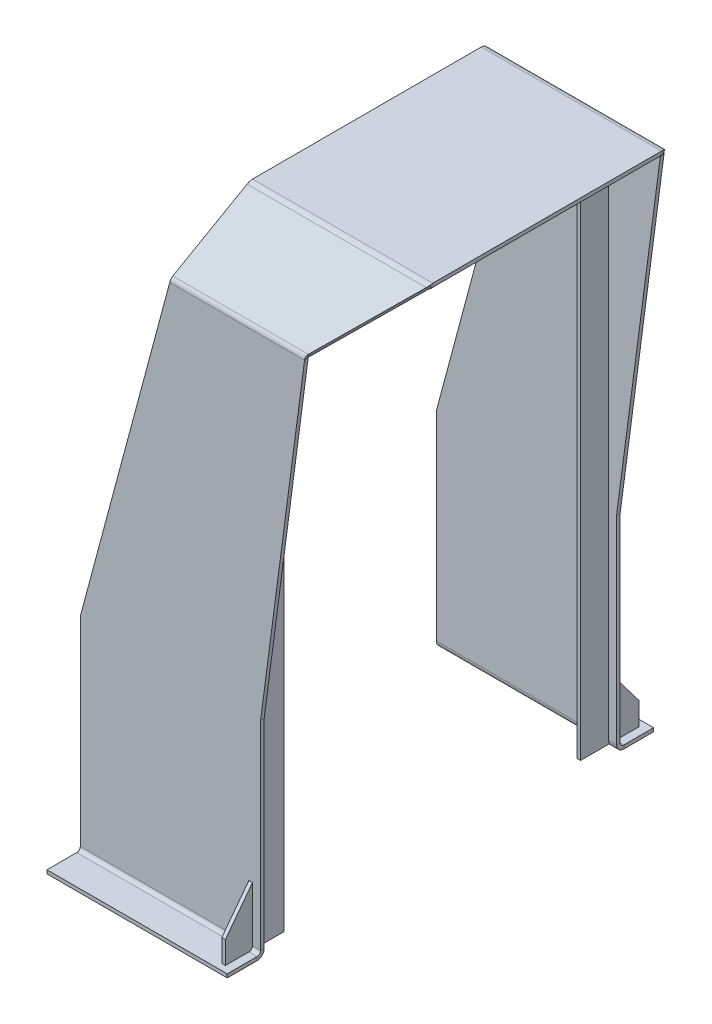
ISO-10303-21;
HEADER;
FILE_DESCRIPTION(('STEP AP214'),'2;1');
FILE_NAME('part.step','',(''),(''),'','','');
FILE_SCHEMA(('AUTOMOTIVE_DESIGN { 1 0 10303 214 1 1 1 1 }'));
ENDSEC;
DATA;
#1=APPLICATION_CONTEXT('core data for automotive mechanical design processes');
#2=APPLICATION_PROTOCOL_DEFINITION('international standard','automotive_design',2000,#1);
#3=PRODUCT_CONTEXT('',#1,'mechanical');
#4=PRODUCT('Part','Part','',(#3));
#5=PRODUCT_RELATED_PRODUCT_CATEGORY('part','',(#4));
#6=PRODUCT_DEFINITION_FORMATION('','',#4);
#7=PRODUCT_DEFINITION_CONTEXT('part definition',#1,'design');
#8=PRODUCT_DEFINITION('design','',#6,#7);
#9=PRODUCT_DEFINITION_SHAPE('','',#8);
#10=(LENGTH_UNIT() NAMED_UNIT(*) SI_UNIT(.MILLI.,.METRE.));
#11=(NAMED_UNIT(*) PLANE_ANGLE_UNIT() SI_UNIT($,.RADIAN.));
#12=(NAMED_UNIT(*) SI_UNIT($,.STERADIAN.) SOLID_ANGLE_UNIT());
#13=UNCERTAINTY_MEASURE_WITH_UNIT(LENGTH_MEASURE(1.E-05),#10,'distance_accuracy_value','');
#14=(GEOMETRIC_REPRESENTATION_CONTEXT(3) GLOBAL_UNCERTAINTY_ASSIGNED_CONTEXT((#13)) GLOBAL_UNIT_ASSIGNED_CONTEXT((#10,
#11,#12)) REPRESENTATION_CONTEXT('',''));
#15=CARTESIAN_POINT('',(0.,0.,0.));
#16=DIRECTION('',(0.,0.,1.));
#17=DIRECTION('',(1.,0.,0.));
#18=AXIS2_PLACEMENT_3D('',#15,#16,#17);
#19=CARTESIAN_POINT('',(-13.,3.99999999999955,-229.500000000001));
#20=DIRECTION('',(0.,0.,-1.));
#21=DIRECTION('',(-1.,0.,0.));
#22=AXIS2_PLACEMENT_3D('',#19,#20,#21);
#23=PLANE('',#22);
#24=DIRECTION('',(0.,1.,0.));
#25=VECTOR('',#24,1.);
#26=CARTESIAN_POINT('',(-9.,3.99999999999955,-229.500000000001));
#27=LINE('',#26,#25);
#28=CARTESIAN_POINT('',(-9.,3.99999999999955,-229.500000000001));
#29=VERTEX_POINT('',#28);
#30=CARTESIAN_POINT('',(-9.,28.9999999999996,-229.500000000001));
#31=VERTEX_POINT('',#30);
#32=EDGE_CURVE('E329',#29,#31,#27,.T.);
#33=ORIENTED_EDGE('',*,*,#32,.F.);
#34=DIRECTION('',(1.,0.,0.));
#35=VECTOR('',#34,1.);
#36=CARTESIAN_POINT('',(-13.,3.99999999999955,-229.500000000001));
#37=LINE('',#36,#35);
#38=CARTESIAN_POINT('',(-13.,3.99999999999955,-229.500000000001));
#39=VERTEX_POINT('',#38);
#40=EDGE_CURVE('E13',#39,#29,#37,.T.);
#41=ORIENTED_EDGE('',*,*,#40,.F.);
#42=DIRECTION('',(0.,1.,0.));
#43=VECTOR('',#42,1.);
#44=CARTESIAN_POINT('',(-13.,3.99999999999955,-229.500000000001));
#45=LINE('',#44,#43);
#46=CARTESIAN_POINT('',(-13.,28.9999999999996,-229.500000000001));
#47=VERTEX_POINT('',#46);
#48=EDGE_CURVE('E385',#39,#47,#45,.T.);
#49=ORIENTED_EDGE('',*,*,#48,.T.);
#50=DIRECTION('',(1.,0.,0.));
#51=VECTOR('',#50,1.);
#52=CARTESIAN_POINT('',(-13.,28.9999999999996,-229.500000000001));
#53=LINE('',#52,#51);
#54=EDGE_CURVE('E163',#47,#31,#53,.T.);
#55=ORIENTED_EDGE('',*,*,#54,.T.);
#56=EDGE_LOOP('',(#33,#41,#49,#55));
#57=FACE_BOUND('',#56,.T.);
#58=ADVANCED_FACE('F160',(#57),#23,.T.);
#59=CARTESIAN_POINT('',(-13.,3.99999999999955,-164.500000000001));
#60=DIRECTION('',(0.,-1.,0.));
#61=DIRECTION('',(0.,0.,-1.));
#62=AXIS2_PLACEMENT_3D('',#59,#60,#61);
#63=PLANE('',#62);
#64=DIRECTION('',(0.,0.,-1.));
#65=VECTOR('',#64,1.);
#66=CARTESIAN_POINT('',(-9.,3.99999999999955,-164.500000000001));
#67=LINE('',#66,#65);
#68=CARTESIAN_POINT('',(-9.,3.99999999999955,-164.500000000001));
#69=VERTEX_POINT('',#68);
#70=EDGE_CURVE('E383',#69,#29,#67,.T.);
#71=ORIENTED_EDGE('',*,*,#70,.F.);
#72=DIRECTION('',(1.,0.,0.));
#73=VECTOR('',#72,1.);
#74=CARTESIAN_POINT('',(-13.,3.99999999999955,-164.500000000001));
#75=LINE('',#74,#73);
#76=CARTESIAN_POINT('',(-13.,3.99999999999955,-164.500000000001));
#77=VERTEX_POINT('',#76);
#78=EDGE_CURVE('E169',#77,#69,#75,.T.);
#79=ORIENTED_EDGE('',*,*,#78,.F.);
#80=DIRECTION('',(0.,0.,-1.));
#81=VECTOR('',#80,1.);
#82=CARTESIAN_POINT('',(-13.,3.99999999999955,-164.500000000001));
#83=LINE('',#82,#81);
#84=EDGE_CURVE('E319',#77,#39,#83,.T.);
#85=ORIENTED_EDGE('',*,*,#84,.T.);
#86=ORIENTED_EDGE('',*,*,#40,.T.);
#87=EDGE_LOOP('',(#71,#79,#85,#86));
#88=FACE_BOUND('',#87,.T.);
#89=ADVANCED_FACE('F421',(#88),#63,.T.);
#90=CARTESIAN_POINT('',(-13.,588.12576203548,-164.5));
#91=DIRECTION('',(0.,0.,1.));
#92=DIRECTION('',(0.,-1.,0.));
#93=AXIS2_PLACEMENT_3D('',#90,#91,#92);
#94=PLANE('',#93);
#95=DIRECTION('',(0.,-1.,0.));
#96=VECTOR('',#95,1.);
#97=CARTESIAN_POINT('',(-9.,588.12576203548,-164.5));
#98=LINE('',#97,#96);
#99=CARTESIAN_POINT('',(-9.,588.12576203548,-164.5));
#100=VERTEX_POINT('',#99);
#101=EDGE_CURVE('E306',#100,#69,#98,.T.);
#102=ORIENTED_EDGE('',*,*,#101,.F.);
#103=DIRECTION('',(1.,0.,0.));
#104=VECTOR('',#103,1.);
#105=CARTESIAN_POINT('',(-13.,588.12576203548,-164.5));
#106=LINE('',#105,#104);
#107=CARTESIAN_POINT('',(-13.,588.12576203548,-164.5));
#108=VERTEX_POINT('',#107);
#109=EDGE_CURVE('E301',#108,#100,#106,.T.);
#110=ORIENTED_EDGE('',*,*,#109,.F.);
#111=DIRECTION('',(0.,-1.,0.));
#112=VECTOR('',#111,1.);
#113=CARTESIAN_POINT('',(-13.,588.12576203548,-164.5));
#114=LINE('',#113,#112);
#115=EDGE_CURVE('E304',#108,#77,#114,.T.);
#116=ORIENTED_EDGE('',*,*,#115,.T.);
#117=ORIENTED_EDGE('',*,*,#78,.T.);
#118=EDGE_LOOP('',(#102,#110,#116,#117));
#119=FACE_BOUND('',#118,.T.);
#120=ADVANCED_FACE('F303',(#119),#94,.T.);
#121=CARTESIAN_POINT('',(-13.,637.,-115.62576203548));
#122=DIRECTION('',(0.,-0.707106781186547,0.707106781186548));
#123=DIRECTION('',(0.,-0.707106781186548,-0.707106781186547));
#124=AXIS2_PLACEMENT_3D('',#121,#122,#123);
#125=PLANE('',#124);
#126=DIRECTION('',(0.,-0.707106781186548,-0.707106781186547));
#127=VECTOR('',#126,1.);
#128=CARTESIAN_POINT('',(-9.,637.,-115.62576203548));
#129=LINE('',#128,#127);
#130=CARTESIAN_POINT('',(-9.,637.,-115.62576203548));
#131=VERTEX_POINT('',#130);
#132=EDGE_CURVE('E380',#131,#100,#129,.T.);
#133=ORIENTED_EDGE('',*,*,#132,.F.);
#134=DIRECTION('',(1.,0.,0.));
#135=VECTOR('',#134,1.);
#136=CARTESIAN_POINT('',(-13.,637.,-115.62576203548));
#137=LINE('',#136,#135);
#138=CARTESIAN_POINT('',(-13.,637.,-115.62576203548));
#139=VERTEX_POINT('',#138);
#140=EDGE_CURVE('E311',#139,#131,#137,.T.);
#141=ORIENTED_EDGE('',*,*,#140,.F.);
#142=DIRECTION('',(0.,-0.707106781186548,-0.707106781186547));
#143=VECTOR('',#142,1.);
#144=CARTESIAN_POINT('',(-13.,637.,-115.62576203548));
#145=LINE('',#144,#143);
#146=EDGE_CURVE('E317',#139,#108,#145,.T.);
#147=ORIENTED_EDGE('',*,*,#146,.T.);
#148=ORIENTED_EDGE('',*,*,#109,.T.);
#149=EDGE_LOOP('',(#133,#141,#147,#148));
#150=FACE_BOUND('',#149,.T.);
#151=ADVANCED_FACE('F321',(#150),#125,.T.);
#152=CARTESIAN_POINT('',(-13.,637.,-115.62576203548));
#153=DIRECTION('',(0.,-1.,0.));
#154=DIRECTION('',(0.,0.,-1.));
#155=AXIS2_PLACEMENT_3D('',#152,#153,#154);
#156=PLANE('',#155);
#157=DIRECTION('',(0.,0.,-1.));
#158=VECTOR('',#157,1.);
#159=CARTESIAN_POINT('',(-9.,637.,-115.62576203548));
#160=LINE('',#159,#158);
#161=CARTESIAN_POINT('',(-9.,637.,115.62576203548));
#162=VERTEX_POINT('',#161);
#163=EDGE_CURVE('E377',#162,#131,#160,.T.);
#164=ORIENTED_EDGE('',*,*,#163,.F.);
#165=DIRECTION('',(1.,0.,0.));
#166=VECTOR('',#165,1.);
#167=CARTESIAN_POINT('',(-13.,637.,115.62576203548));
#168=LINE('',#167,#166);
#169=CARTESIAN_POINT('',(-13.,637.,115.62576203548));
#170=VERTEX_POINT('',#169);
#171=EDGE_CURVE('E389',#170,#162,#168,.T.);
#172=ORIENTED_EDGE('',*,*,#171,.F.);
#173=DIRECTION('',(0.,0.,-1.));
#174=VECTOR('',#173,1.);
#175=CARTESIAN_POINT('',(-13.,637.,-115.62576203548));
#176=LINE('',#175,#174);
#177=EDGE_CURVE('E322',#170,#139,#176,.T.);
#178=ORIENTED_EDGE('',*,*,#177,.T.);
#179=ORIENTED_EDGE('',*,*,#140,.T.);
#180=EDGE_LOOP('',(#164,#172,#178,#179));
#181=FACE_BOUND('',#180,.T.);
#182=ADVANCED_FACE('F434',(#181),#156,.T.);
#183=CARTESIAN_POINT('',(-13.,637.,115.62576203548));
#184=DIRECTION('',(0.,-0.707106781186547,-0.707106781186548));
#185=DIRECTION('',(0.,0.707106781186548,-0.707106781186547));
#186=AXIS2_PLACEMENT_3D('',#183,#184,#185);
#187=PLANE('',#186);
#188=DIRECTION('',(0.,0.707106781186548,-0.707106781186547));
#189=VECTOR('',#188,1.);
#190=CARTESIAN_POINT('',(-9.,637.,115.62576203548));
#191=LINE('',#190,#189);
#192=CARTESIAN_POINT('',(-9.,588.125762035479,164.5));
#193=VERTEX_POINT('',#192);
#194=EDGE_CURVE('E374',#193,#162,#191,.T.);
#195=ORIENTED_EDGE('',*,*,#194,.F.);
#196=DIRECTION('',(1.,0.,0.));
#197=VECTOR('',#196,1.);
#198=CARTESIAN_POINT('',(-13.,588.125762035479,164.5));
#199=LINE('',#198,#197);
#200=CARTESIAN_POINT('',(-13.,588.125762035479,164.5));
#201=VERTEX_POINT('',#200);
#202=EDGE_CURVE('E391',#201,#193,#199,.T.);
#203=ORIENTED_EDGE('',*,*,#202,.F.);
#204=DIRECTION('',(0.,0.707106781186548,-0.707106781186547));
#205=VECTOR('',#204,1.);
#206=CARTESIAN_POINT('',(-13.,637.,115.62576203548));
#207=LINE('',#206,#205);
#208=EDGE_CURVE('E324',#201,#170,#207,.T.);
#209=ORIENTED_EDGE('',*,*,#208,.T.);
#210=ORIENTED_EDGE('',*,*,#171,.T.);
#211=EDGE_LOOP('',(#195,#203,#209,#210));
#212=FACE_BOUND('',#211,.T.);
#213=ADVANCED_FACE('F437',(#212),#187,.T.);
#214=CARTESIAN_POINT('',(-13.,588.125762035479,164.5));
#215=DIRECTION('',(0.,0.,-1.));
#216=DIRECTION('',(0.,1.,0.));
#217=AXIS2_PLACEMENT_3D('',#214,#215,#216);
#218=PLANE('',#217);
#219=DIRECTION('',(0.,1.,0.));
#220=VECTOR('',#219,1.);
#221=CARTESIAN_POINT('',(-9.,588.125762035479,164.5));
#222=LINE('',#221,#220);
#223=CARTESIAN_POINT('',(-9.,3.99999999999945,164.5));
#224=VERTEX_POINT('',#223);
#225=EDGE_CURVE('E371',#224,#193,#222,.T.);
#226=ORIENTED_EDGE('',*,*,#225,.F.);
#227=DIRECTION('',(1.,0.,0.));
#228=VECTOR('',#227,1.);
#229=CARTESIAN_POINT('',(-13.,3.99999999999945,164.5));
#230=LINE('',#229,#228);
#231=CARTESIAN_POINT('',(-13.,3.99999999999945,164.5));
#232=VERTEX_POINT('',#231);
#233=EDGE_CURVE('E393',#232,#224,#230,.T.);
#234=ORIENTED_EDGE('',*,*,#233,.F.);
#235=DIRECTION('',(0.,1.,0.));
#236=VECTOR('',#235,1.);
#237=CARTESIAN_POINT('',(-13.,588.125762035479,164.5));
#238=LINE('',#237,#236);
#239=EDGE_CURVE('E676',#232,#201,#238,.T.);
#240=ORIENTED_EDGE('',*,*,#239,.T.);
#241=ORIENTED_EDGE('',*,*,#202,.T.);
#242=EDGE_LOOP('',(#226,#234,#240,#241));
#243=FACE_BOUND('',#242,.T.);
#244=ADVANCED_FACE('F441',(#243),#218,.T.);
#245=CARTESIAN_POINT('',(-13.,3.99999999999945,164.5));
#246=DIRECTION('',(0.,-1.,0.));
#247=DIRECTION('',(0.,0.,-1.));
#248=AXIS2_PLACEMENT_3D('',#245,#246,#247);
#249=PLANE('',#248);
#250=DIRECTION('',(0.,0.,-1.));
#251=VECTOR('',#250,1.);
#252=CARTESIAN_POINT('',(-9.,3.99999999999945,164.5));
#253=LINE('',#252,#251);
#254=CARTESIAN_POINT('',(-9.,3.99999999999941,229.5));
#255=VERTEX_POINT('',#254);
#256=EDGE_CURVE('E368',#255,#224,#253,.T.);
#257=ORIENTED_EDGE('',*,*,#256,.F.);
#258=DIRECTION('',(1.,0.,0.));
#259=VECTOR('',#258,1.);
#260=CARTESIAN_POINT('',(-13.,3.99999999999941,229.5));
#261=LINE('',#260,#259);
#262=CARTESIAN_POINT('',(-13.,3.99999999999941,229.5));
#263=VERTEX_POINT('',#262);
#264=EDGE_CURVE('E395',#263,#255,#261,.T.);
#265=ORIENTED_EDGE('',*,*,#264,.F.);
#266=DIRECTION('',(0.,0.,-1.));
#267=VECTOR('',#266,1.);
#268=CARTESIAN_POINT('',(-13.,3.99999999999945,164.5));
#269=LINE('',#268,#267);
#270=EDGE_CURVE('E669',#263,#232,#269,.T.);
#271=ORIENTED_EDGE('',*,*,#270,.T.);
#272=ORIENTED_EDGE('',*,*,#233,.T.);
#273=EDGE_LOOP('',(#257,#265,#271,#272));
#274=FACE_BOUND('',#273,.T.);
#275=ADVANCED_FACE('F445',(#274),#249,.T.);
#276=CARTESIAN_POINT('',(-13.,3.99999999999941,229.5));
#277=DIRECTION('',(0.,0.,1.));
#278=DIRECTION('',(1.,0.,0.));
#279=AXIS2_PLACEMENT_3D('',#276,#277,#278);
#280=PLANE('',#279);
#281=DIRECTION('',(0.,-1.,0.));
#282=VECTOR('',#281,1.);
#283=CARTESIAN_POINT('',(-9.,3.99999999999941,229.5));
#284=LINE('',#283,#282);
#285=CARTESIAN_POINT('',(-9.,28.9999999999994,229.5));
#286=VERTEX_POINT('',#285);
#287=EDGE_CURVE('E365',#286,#255,#284,.T.);
#288=ORIENTED_EDGE('',*,*,#287,.F.);
#289=DIRECTION('',(1.,0.,0.));
#290=VECTOR('',#289,1.);
#291=CARTESIAN_POINT('',(-13.,28.9999999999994,229.5));
#292=LINE('',#291,#290);
#293=CARTESIAN_POINT('',(-13.,28.9999999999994,229.5));
#294=VERTEX_POINT('',#293);
#295=EDGE_CURVE('E397',#294,#286,#292,.T.);
#296=ORIENTED_EDGE('',*,*,#295,.F.);
#297=DIRECTION('',(0.,-1.,0.));
#298=VECTOR('',#297,1.);
#299=CARTESIAN_POINT('',(-13.,3.99999999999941,229.5));
#300=LINE('',#299,#298);
#301=EDGE_CURVE('E665',#294,#263,#300,.T.);
#302=ORIENTED_EDGE('',*,*,#301,.T.);
#303=ORIENTED_EDGE('',*,*,#264,.T.);
#304=EDGE_LOOP('',(#288,#296,#302,#303));
#305=FACE_BOUND('',#304,.T.);
#306=ADVANCED_FACE('F449',(#305),#280,.T.);
#307=CARTESIAN_POINT('',(-13.,73.9999999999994,195.5));
#308=DIRECTION('',(0.,0.602833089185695,0.797867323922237));
#309=DIRECTION('',(0.,-0.797867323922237,0.602833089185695));
#310=AXIS2_PLACEMENT_3D('',#307,#308,#309);
#311=PLANE('',#310);
#312=DIRECTION('',(0.,-0.797867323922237,0.602833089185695));
#313=VECTOR('',#312,1.);
#314=CARTESIAN_POINT('',(-9.,73.9999999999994,195.5));
#315=LINE('',#314,#313);
#316=CARTESIAN_POINT('',(-9.,73.9999999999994,195.5));
#317=VERTEX_POINT('',#316);
#318=EDGE_CURVE('E362',#317,#286,#315,.T.);
#319=ORIENTED_EDGE('',*,*,#318,.F.);
#320=DIRECTION('',(1.,0.,0.));
#321=VECTOR('',#320,1.);
#322=CARTESIAN_POINT('',(-13.,73.9999999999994,195.5));
#323=LINE('',#322,#321);
#324=CARTESIAN_POINT('',(-13.,73.9999999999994,195.5));
#325=VERTEX_POINT('',#324);
#326=EDGE_CURVE('E399',#325,#317,#323,.T.);
#327=ORIENTED_EDGE('',*,*,#326,.F.);
#328=DIRECTION('',(0.,-0.797867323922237,0.602833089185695));
#329=VECTOR('',#328,1.);
#330=CARTESIAN_POINT('',(-13.,73.9999999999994,195.5));
#331=LINE('',#330,#329);
#332=EDGE_CURVE('E681',#325,#294,#331,.T.);
#333=ORIENTED_EDGE('',*,*,#332,.T.);
#334=ORIENTED_EDGE('',*,*,#295,.T.);
#335=EDGE_LOOP('',(#319,#327,#333,#334));
#336=FACE_BOUND('',#335,.T.);
#337=ADVANCED_FACE('F453',(#336),#311,.T.);
#338=CARTESIAN_POINT('',(-13.,73.9999999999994,195.5));
#339=DIRECTION('',(0.,0.,1.));
#340=DIRECTION('',(0.,-1.,0.));
#341=AXIS2_PLACEMENT_3D('',#338,#339,#340);
#342=PLANE('',#341);
#343=DIRECTION('',(0.,-1.,0.));
#344=VECTOR('',#343,1.);
#345=CARTESIAN_POINT('',(-9.,73.9999999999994,195.5));
#346=LINE('',#345,#344);
#347=CARTESIAN_POINT('',(-9.,600.96638246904,195.5));
#348=VERTEX_POINT('',#347);
#349=EDGE_CURVE('E359',#348,#317,#346,.T.);
#350=ORIENTED_EDGE('',*,*,#349,.F.);
#351=DIRECTION('',(1.,0.,0.));
#352=VECTOR('',#351,1.);
#353=CARTESIAN_POINT('',(-13.,600.96638246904,195.5));
#354=LINE('',#353,#352);
#355=CARTESIAN_POINT('',(-13.,600.96638246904,195.5));
#356=VERTEX_POINT('',#355);
#357=EDGE_CURVE('E401',#356,#348,#354,.T.);
#358=ORIENTED_EDGE('',*,*,#357,.F.);
#359=DIRECTION('',(0.,-1.,0.));
#360=VECTOR('',#359,1.);
#361=CARTESIAN_POINT('',(-13.,73.9999999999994,195.5));
#362=LINE('',#361,#360);
#363=EDGE_CURVE('E658',#356,#325,#362,.T.);
#364=ORIENTED_EDGE('',*,*,#363,.T.);
#365=ORIENTED_EDGE('',*,*,#326,.T.);
#366=EDGE_LOOP('',(#350,#358,#364,#365));
#367=FACE_BOUND('',#366,.T.);
#368=ADVANCED_FACE('F457',(#367),#342,.T.);
#369=CARTESIAN_POINT('',(-13.,600.96638246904,195.5));
#370=DIRECTION('',(0.,0.707106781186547,0.707106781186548));
#371=DIRECTION('',(0.,-0.707106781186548,0.707106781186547));
#372=AXIS2_PLACEMENT_3D('',#369,#370,#371);
#373=PLANE('',#372);
#374=DIRECTION('',(0.,-0.707106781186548,0.707106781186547));
#375=VECTOR('',#374,1.);
#376=CARTESIAN_POINT('',(-9.,600.96638246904,195.5));
#377=LINE('',#376,#375);
#378=CARTESIAN_POINT('',(-9.,668.,128.46638246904));
#379=VERTEX_POINT('',#378);
#380=EDGE_CURVE('E356',#379,#348,#377,.T.);
#381=ORIENTED_EDGE('',*,*,#380,.F.);
#382=DIRECTION('',(1.,0.,0.));
#383=VECTOR('',#382,1.);
#384=CARTESIAN_POINT('',(-13.,668.,128.46638246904));
#385=LINE('',#384,#383);
#386=CARTESIAN_POINT('',(-13.,668.,128.46638246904));
#387=VERTEX_POINT('',#386);
#388=EDGE_CURVE('E403',#387,#379,#385,.T.);
#389=ORIENTED_EDGE('',*,*,#388,.F.);
#390=DIRECTION('',(0.,-0.707106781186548,0.707106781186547));
#391=VECTOR('',#390,1.);
#392=CARTESIAN_POINT('',(-13.,600.96638246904,195.5));
#393=LINE('',#392,#391);
#394=EDGE_CURVE('E654',#387,#356,#393,.T.);
#395=ORIENTED_EDGE('',*,*,#394,.T.);
#396=ORIENTED_EDGE('',*,*,#357,.T.);
#397=EDGE_LOOP('',(#381,#389,#395,#396));
#398=FACE_BOUND('',#397,.T.);
#399=ADVANCED_FACE('F461',(#398),#373,.T.);
#400=CARTESIAN_POINT('',(-13.,668.,128.46638246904));
#401=DIRECTION('',(0.,1.,0.));
#402=DIRECTION('',(0.,0.,1.));
#403=AXIS2_PLACEMENT_3D('',#400,#401,#402);
#404=PLANE('',#403);
#405=DIRECTION('',(0.,0.,1.));
#406=VECTOR('',#405,1.);
#407=CARTESIAN_POINT('',(-9.,668.,128.46638246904));
#408=LINE('',#407,#406);
#409=CARTESIAN_POINT('',(-9.,668.,35.));
#410=VERTEX_POINT('',#409);
#411=EDGE_CURVE('E353',#410,#379,#408,.T.);
#412=ORIENTED_EDGE('',*,*,#411,.F.);
#413=DIRECTION('',(1.,0.,0.));
#414=VECTOR('',#413,1.);
#415=CARTESIAN_POINT('',(-13.,668.,35.));
#416=LINE('',#415,#414);
#417=CARTESIAN_POINT('',(-13.,668.,35.));
#418=VERTEX_POINT('',#417);
#419=EDGE_CURVE('E405',#418,#410,#416,.T.);
#420=ORIENTED_EDGE('',*,*,#419,.F.);
#421=DIRECTION('',(0.,0.,1.));
#422=VECTOR('',#421,1.);
#423=CARTESIAN_POINT('',(-13.,668.,128.46638246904));
#424=LINE('',#423,#422);
#425=EDGE_CURVE('E685',#418,#387,#424,.T.);
#426=ORIENTED_EDGE('',*,*,#425,.T.);
#427=ORIENTED_EDGE('',*,*,#388,.T.);
#428=EDGE_LOOP('',(#412,#420,#426,#427));
#429=FACE_BOUND('',#428,.T.);
#430=ADVANCED_FACE('F465',(#429),#404,.T.);
#431=CARTESIAN_POINT('',(-13.,668.,35.));
#432=DIRECTION('',(0.,0.,1.));
#433=DIRECTION('',(1.,0.,0.));
#434=AXIS2_PLACEMENT_3D('',#431,#432,#433);
#435=PLANE('',#434);
#436=DIRECTION('',(0.,-1.,0.));
#437=VECTOR('',#436,1.);
#438=CARTESIAN_POINT('',(-9.,668.,35.));
#439=LINE('',#438,#437);
#440=CARTESIAN_POINT('',(-9.,671.,35.));
#441=VERTEX_POINT('',#440);
#442=EDGE_CURVE('E350',#441,#410,#439,.T.);
#443=ORIENTED_EDGE('',*,*,#442,.F.);
#444=DIRECTION('',(1.,0.,0.));
#445=VECTOR('',#444,1.);
#446=CARTESIAN_POINT('',(-13.,671.,35.));
#447=LINE('',#446,#445);
#448=CARTESIAN_POINT('',(-13.,671.,35.));
#449=VERTEX_POINT('',#448);
#450=EDGE_CURVE('E407',#449,#441,#447,.T.);
#451=ORIENTED_EDGE('',*,*,#450,.F.);
#452=DIRECTION('',(0.,-1.,0.));
#453=VECTOR('',#452,1.);
#454=CARTESIAN_POINT('',(-13.,668.,35.));
#455=LINE('',#454,#453);
#456=EDGE_CURVE('E647',#449,#418,#455,.T.);
#457=ORIENTED_EDGE('',*,*,#456,.T.);
#458=ORIENTED_EDGE('',*,*,#419,.T.);
#459=EDGE_LOOP('',(#443,#451,#457,#458));
#460=FACE_BOUND('',#459,.T.);
#461=ADVANCED_FACE('F469',(#460),#435,.T.);
#462=CARTESIAN_POINT('',(-13.,671.,35.));
#463=DIRECTION('',(0.,1.,0.));
#464=DIRECTION('',(0.,0.,1.));
#465=AXIS2_PLACEMENT_3D('',#462,#463,#464);
#466=PLANE('',#465);
#467=DIRECTION('',(0.,0.,1.));
#468=VECTOR('',#467,1.);
#469=CARTESIAN_POINT('',(-9.,671.,35.));
#470=LINE('',#469,#468);
#471=CARTESIAN_POINT('',(-9.,671.,-35.));
#472=VERTEX_POINT('',#471);
#473=EDGE_CURVE('E347',#472,#441,#470,.T.);
#474=ORIENTED_EDGE('',*,*,#473,.F.);
#475=DIRECTION('',(1.,0.,0.));
#476=VECTOR('',#475,1.);
#477=CARTESIAN_POINT('',(-13.,671.,-35.));
#478=LINE('',#477,#476);
#479=CARTESIAN_POINT('',(-13.,671.,-35.));
#480=VERTEX_POINT('',#479);
#481=EDGE_CURVE('E409',#480,#472,#478,.T.);
#482=ORIENTED_EDGE('',*,*,#481,.F.);
#483=DIRECTION('',(0.,0.,1.));
#484=VECTOR('',#483,1.);
#485=CARTESIAN_POINT('',(-13.,671.,35.));
#486=LINE('',#485,#484);
#487=EDGE_CURVE('E643',#480,#449,#486,.T.);
#488=ORIENTED_EDGE('',*,*,#487,.T.);
#489=ORIENTED_EDGE('',*,*,#450,.T.);
#490=EDGE_LOOP('',(#474,#482,#488,#489));
#491=FACE_BOUND('',#490,.T.);
#492=ADVANCED_FACE('F473',(#491),#466,.T.);
#493=CARTESIAN_POINT('',(-13.,671.,-35.));
#494=DIRECTION('',(0.,0.,-1.));
#495=DIRECTION('',(-1.,0.,0.));
#496=AXIS2_PLACEMENT_3D('',#493,#494,#495);
#497=PLANE('',#496);
#498=DIRECTION('',(0.,1.,0.));
#499=VECTOR('',#498,1.);
#500=CARTESIAN_POINT('',(-9.,671.,-35.));
#501=LINE('',#500,#499);
#502=CARTESIAN_POINT('',(-9.,668.,-35.));
#503=VERTEX_POINT('',#502);
#504=EDGE_CURVE('E344',#503,#472,#501,.T.);
#505=ORIENTED_EDGE('',*,*,#504,.F.);
#506=DIRECTION('',(1.,0.,0.));
#507=VECTOR('',#506,1.);
#508=CARTESIAN_POINT('',(-13.,668.,-35.));
#509=LINE('',#508,#507);
#510=CARTESIAN_POINT('',(-13.,668.,-35.));
#511=VERTEX_POINT('',#510);
#512=EDGE_CURVE('E411',#511,#503,#509,.T.);
#513=ORIENTED_EDGE('',*,*,#512,.F.);
#514=DIRECTION('',(0.,1.,0.));
#515=VECTOR('',#514,1.);
#516=CARTESIAN_POINT('',(-13.,671.,-35.));
#517=LINE('',#516,#515);
#518=EDGE_CURVE('E689',#511,#480,#517,.T.);
#519=ORIENTED_EDGE('',*,*,#518,.T.);
#520=ORIENTED_EDGE('',*,*,#481,.T.);
#521=EDGE_LOOP('',(#505,#513,#519,#520));
#522=FACE_BOUND('',#521,.T.);
#523=ADVANCED_FACE('F477',(#522),#497,.T.);
#524=CARTESIAN_POINT('',(-13.,668.,-35.));
#525=DIRECTION('',(0.,1.,0.));
#526=DIRECTION('',(0.,0.,1.));
#527=AXIS2_PLACEMENT_3D('',#524,#525,#526);
#528=PLANE('',#527);
#529=DIRECTION('',(0.,0.,1.));
#530=VECTOR('',#529,1.);
#531=CARTESIAN_POINT('',(-9.,668.,-35.));
#532=LINE('',#531,#530);
#533=CARTESIAN_POINT('',(-9.,668.,-128.46638246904));
#534=VERTEX_POINT('',#533);
#535=EDGE_CURVE('E341',#534,#503,#532,.T.);
#536=ORIENTED_EDGE('',*,*,#535,.F.);
#537=DIRECTION('',(1.,0.,0.));
#538=VECTOR('',#537,1.);
#539=CARTESIAN_POINT('',(-13.,668.,-128.46638246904));
#540=LINE('',#539,#538);
#541=CARTESIAN_POINT('',(-13.,668.,-128.46638246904));
#542=VERTEX_POINT('',#541);
#543=EDGE_CURVE('E413',#542,#534,#540,.T.);
#544=ORIENTED_EDGE('',*,*,#543,.F.);
#545=DIRECTION('',(0.,0.,1.));
#546=VECTOR('',#545,1.);
#547=CARTESIAN_POINT('',(-13.,668.,-35.));
#548=LINE('',#547,#546);
#549=EDGE_CURVE('E636',#542,#511,#548,.T.);
#550=ORIENTED_EDGE('',*,*,#549,.T.);
#551=ORIENTED_EDGE('',*,*,#512,.T.);
#552=EDGE_LOOP('',(#536,#544,#550,#551));
#553=FACE_BOUND('',#552,.T.);
#554=ADVANCED_FACE('F481',(#553),#528,.T.);
#555=CARTESIAN_POINT('',(-13.,600.96638246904,-195.5));
#556=DIRECTION('',(0.,0.707106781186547,-0.707106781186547));
#557=DIRECTION('',(0.,0.707106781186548,0.707106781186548));
#558=AXIS2_PLACEMENT_3D('',#555,#556,#557);
#559=PLANE('',#558);
#560=DIRECTION('',(0.,0.707106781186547,0.707106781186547));
#561=VECTOR('',#560,1.);
#562=CARTESIAN_POINT('',(-9.,600.96638246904,-195.5));
#563=LINE('',#562,#561);
#564=CARTESIAN_POINT('',(-9.,600.96638246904,-195.5));
#565=VERTEX_POINT('',#564);
#566=EDGE_CURVE('E338',#565,#534,#563,.T.);
#567=ORIENTED_EDGE('',*,*,#566,.F.);
#568=DIRECTION('',(1.,0.,0.));
#569=VECTOR('',#568,1.);
#570=CARTESIAN_POINT('',(-13.,600.96638246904,-195.5));
#571=LINE('',#570,#569);
#572=CARTESIAN_POINT('',(-13.,600.96638246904,-195.5));
#573=VERTEX_POINT('',#572);
#574=EDGE_CURVE('E415',#573,#565,#571,.T.);
#575=ORIENTED_EDGE('',*,*,#574,.F.);
#576=DIRECTION('',(0.,0.707106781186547,0.707106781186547));
#577=VECTOR('',#576,1.);
#578=CARTESIAN_POINT('',(-13.,600.96638246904,-195.5));
#579=LINE('',#578,#577);
#580=EDGE_CURVE('E632',#573,#542,#579,.T.);
#581=ORIENTED_EDGE('',*,*,#580,.T.);
#582=ORIENTED_EDGE('',*,*,#543,.T.);
#583=EDGE_LOOP('',(#567,#575,#581,#582));
#584=FACE_BOUND('',#583,.T.);
#585=ADVANCED_FACE('F485',(#584),#559,.T.);
#586=CARTESIAN_POINT('',(-13.,73.9999999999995,-195.5));
#587=DIRECTION('',(0.,0.,-1.));
#588=DIRECTION('',(0.,1.,0.));
#589=AXIS2_PLACEMENT_3D('',#586,#587,#588);
#590=PLANE('',#589);
#591=DIRECTION('',(0.,1.,0.));
#592=VECTOR('',#591,1.);
#593=CARTESIAN_POINT('',(-9.,73.9999999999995,-195.5));
#594=LINE('',#593,#592);
#595=CARTESIAN_POINT('',(-9.,73.9999999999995,-195.5));
#596=VERTEX_POINT('',#595);
#597=EDGE_CURVE('E335',#596,#565,#594,.T.);
#598=ORIENTED_EDGE('',*,*,#597,.F.);
#599=DIRECTION('',(1.,0.,0.));
#600=VECTOR('',#599,1.);
#601=CARTESIAN_POINT('',(-13.,73.9999999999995,-195.5));
#602=LINE('',#601,#600);
#603=CARTESIAN_POINT('',(-13.,73.9999999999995,-195.5));
#604=VERTEX_POINT('',#603);
#605=EDGE_CURVE('E416',#604,#596,#602,.T.);
#606=ORIENTED_EDGE('',*,*,#605,.F.);
#607=DIRECTION('',(0.,1.,0.));
#608=VECTOR('',#607,1.);
#609=CARTESIAN_POINT('',(-13.,73.9999999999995,-195.5));
#610=LINE('',#609,#608);
#611=EDGE_CURVE('E693',#604,#573,#610,.T.);
#612=ORIENTED_EDGE('',*,*,#611,.T.);
#613=ORIENTED_EDGE('',*,*,#574,.T.);
#614=EDGE_LOOP('',(#598,#606,#612,#613));
#615=FACE_BOUND('',#614,.T.);
#616=ADVANCED_FACE('F489',(#615),#590,.T.);
#617=CARTESIAN_POINT('',(-13.,73.9999999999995,-195.5));
#618=DIRECTION('',(0.,0.602833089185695,-0.797867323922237));
#619=DIRECTION('',(0.,0.797867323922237,0.602833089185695));
#620=AXIS2_PLACEMENT_3D('',#617,#618,#619);
#621=PLANE('',#620);
#622=DIRECTION('',(0.,0.797867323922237,0.602833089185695));
#623=VECTOR('',#622,1.);
#624=CARTESIAN_POINT('',(-9.,73.9999999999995,-195.5));
#625=LINE('',#624,#623);
#626=EDGE_CURVE('E332',#31,#596,#625,.T.);
#627=ORIENTED_EDGE('',*,*,#626,.F.);
#628=ORIENTED_EDGE('',*,*,#54,.F.);
#629=DIRECTION('',(0.,0.797867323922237,0.602833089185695));
#630=VECTOR('',#629,1.);
#631=CARTESIAN_POINT('',(-13.,73.9999999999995,-195.5));
#632=LINE('',#631,#630);
#633=EDGE_CURVE('E695',#47,#604,#632,.T.);
#634=ORIENTED_EDGE('',*,*,#633,.T.);
#635=ORIENTED_EDGE('',*,*,#605,.T.);
#636=EDGE_LOOP('',(#627,#628,#634,#635));
#637=FACE_BOUND('',#636,.T.);
#638=ADVANCED_FACE('F418',(#637),#621,.T.);
#639=CARTESIAN_POINT('',(-13.,0.,0.));
#640=DIRECTION('',(-1.,0.,0.));
#641=DIRECTION('',(0.,0.,1.));
#642=AXIS2_PLACEMENT_3D('',#639,#640,#641);
#643=PLANE('',#642);
#644=ORIENTED_EDGE('',*,*,#48,.F.);
#645=ORIENTED_EDGE('',*,*,#84,.F.);
#646=ORIENTED_EDGE('',*,*,#115,.F.);
#647=ORIENTED_EDGE('',*,*,#146,.F.);
#648=ORIENTED_EDGE('',*,*,#177,.F.);
#649=ORIENTED_EDGE('',*,*,#208,.F.);
#650=ORIENTED_EDGE('',*,*,#239,.F.);
#651=ORIENTED_EDGE('',*,*,#270,.F.);
#652=ORIENTED_EDGE('',*,*,#301,.F.);
#653=ORIENTED_EDGE('',*,*,#332,.F.);
#654=ORIENTED_EDGE('',*,*,#363,.F.);
#655=ORIENTED_EDGE('',*,*,#394,.F.);
#656=ORIENTED_EDGE('',*,*,#425,.F.);
#657=ORIENTED_EDGE('',*,*,#456,.F.);
#658=ORIENTED_EDGE('',*,*,#487,.F.);
#659=ORIENTED_EDGE('',*,*,#518,.F.);
#660=ORIENTED_EDGE('',*,*,#549,.F.);
#661=ORIENTED_EDGE('',*,*,#580,.F.);
#662=ORIENTED_EDGE('',*,*,#611,.F.);
#663=ORIENTED_EDGE('',*,*,#633,.F.);
#664=EDGE_LOOP('',(#644,#645,#646,#647,#648,#649,#650,#651,#652,#653,#654,#655,#656,#657,#658,
#659,#660,#661,#662,#663));
#665=FACE_BOUND('',#664,.T.);
#666=ADVANCED_FACE('F315',(#665),#643,.T.);
#667=CARTESIAN_POINT('',(-9.,0.,0.));
#668=DIRECTION('',(-1.,0.,0.));
#669=DIRECTION('',(0.,0.,1.));
#670=AXIS2_PLACEMENT_3D('',#667,#668,#669);
#671=PLANE('',#670);
#672=ORIENTED_EDGE('',*,*,#32,.T.);
#673=ORIENTED_EDGE('',*,*,#626,.T.);
#674=ORIENTED_EDGE('',*,*,#597,.T.);
#675=ORIENTED_EDGE('',*,*,#566,.T.);
#676=ORIENTED_EDGE('',*,*,#535,.T.);
#677=ORIENTED_EDGE('',*,*,#504,.T.);
#678=ORIENTED_EDGE('',*,*,#473,.T.);
#679=ORIENTED_EDGE('',*,*,#442,.T.);
#680=ORIENTED_EDGE('',*,*,#411,.T.);
#681=ORIENTED_EDGE('',*,*,#380,.T.);
#682=ORIENTED_EDGE('',*,*,#349,.T.);
#683=ORIENTED_EDGE('',*,*,#318,.T.);
#684=ORIENTED_EDGE('',*,*,#287,.T.);
#685=ORIENTED_EDGE('',*,*,#256,.T.);
#686=ORIENTED_EDGE('',*,*,#225,.T.);
#687=ORIENTED_EDGE('',*,*,#194,.T.);
#688=ORIENTED_EDGE('',*,*,#163,.T.);
#689=ORIENTED_EDGE('',*,*,#132,.T.);
#690=ORIENTED_EDGE('',*,*,#101,.T.);
#691=ORIENTED_EDGE('',*,*,#70,.T.);
#692=EDGE_LOOP('',(#672,#673,#674,#675,#676,#677,#678,#679,#680,#681,#682,#683,#684,#685,#686,
#687,#688,#689,#690,#691));
#693=FACE_BOUND('',#692,.T.);
#694=ADVANCED_FACE('F420',(#693),#671,.F.);
#695=CLOSED_SHELL('',(#58,#89,#120,#151,#182,#213,#244,#275,#306,#337,#368,#399,#430,#461,#492,
#523,#554,#585,#616,#638,#666,#694));
#696=MANIFOLD_SOLID_BREP('B2',#695);
#697=CARTESIAN_POINT('',(118.433543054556,668.,130.123236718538));
#698=DIRECTION('',(0.,-1.,0.));
#699=DIRECTION('',(0.,0.,-1.));
#700=AXIS2_PLACEMENT_3D('',#697,#698,#699);
#701=PLANE('',#700);
#702=DIRECTION('',(-1.,0.,0.));
#703=VECTOR('',#702,1.);
#704=CARTESIAN_POINT('',(118.433543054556,668.,126.85094957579));
#705=LINE('',#704,#703);
#706=CARTESIAN_POINT('',(118.433543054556,668.,126.85094957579));
#707=VERTEX_POINT('',#706);
#708=CARTESIAN_POINT('',(-81.5664569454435,668.,126.85094957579));
#709=VERTEX_POINT('',#708);
#710=EDGE_CURVE('E1743',#707,#709,#705,.T.);
#711=ORIENTED_EDGE('',*,*,#710,.T.);
#712=DIRECTION('',(0.,0.,-1.));
#713=VECTOR('',#712,1.);
#714=CARTESIAN_POINT('',(-81.5664569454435,667.999999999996,-128.689221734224));
#715=LINE('',#714,#713);
#716=CARTESIAN_POINT('',(-81.5664569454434,668.,-126.85094957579));
#717=VERTEX_POINT('',#716);
#718=EDGE_CURVE('E2021',#709,#717,#715,.T.);
#719=ORIENTED_EDGE('',*,*,#718,.T.);
#720=DIRECTION('',(-1.,0.,0.));
#721=VECTOR('',#720,1.);
#722=CARTESIAN_POINT('',(118.433543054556,668.,-126.85094957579));
#723=LINE('',#722,#721);
#724=CARTESIAN_POINT('',(118.433543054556,668.,-126.85094957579));
#725=VERTEX_POINT('',#724);
#726=EDGE_CURVE('E2027',#725,#717,#723,.T.);
#727=ORIENTED_EDGE('',*,*,#726,.F.);
#728=DIRECTION('',(0.,0.,-1.));
#729=VECTOR('',#728,1.);
#730=CARTESIAN_POINT('',(118.433543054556,668.,130.123236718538));
#731=LINE('',#730,#729);
#732=EDGE_CURVE('E2020',#725,#707,#731,.F.);
#733=ORIENTED_EDGE('',*,*,#732,.T.);
#734=EDGE_LOOP('',(#711,#719,#727,#733));
#735=FACE_BOUND('',#734,.T.);
#736=ADVANCED_FACE('F699',(#735),#701,.T.);
#737=CARTESIAN_POINT('',(118.433543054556,672.,130.123236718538));
#738=DIRECTION('',(0.,-1.,0.));
#739=DIRECTION('',(0.,0.,-1.));
#740=AXIS2_PLACEMENT_3D('',#737,#738,#739);
#741=PLANE('',#740);
#742=DIRECTION('',(0.,0.,-1.));
#743=VECTOR('',#742,1.);
#744=CARTESIAN_POINT('',(-81.5664569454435,672.,130.123236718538));
#745=LINE('',#744,#743);
#746=CARTESIAN_POINT('',(-81.5664569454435,672.,126.85094957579));
#747=VERTEX_POINT('',#746);
#748=CARTESIAN_POINT('',(-81.5664569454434,672.,-126.85094957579));
#749=VERTEX_POINT('',#748);
#750=EDGE_CURVE('E2012',#747,#749,#745,.T.);
#751=ORIENTED_EDGE('',*,*,#750,.F.);
#752=DIRECTION('',(-1.,0.,0.));
#753=VECTOR('',#752,1.);
#754=CARTESIAN_POINT('',(118.433543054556,672.,126.85094957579));
#755=LINE('',#754,#753);
#756=CARTESIAN_POINT('',(118.433543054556,672.,126.85094957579));
#757=VERTEX_POINT('',#756);
#758=EDGE_CURVE('E1703',#757,#747,#755,.T.);
#759=ORIENTED_EDGE('',*,*,#758,.F.);
#760=DIRECTION('',(0.,0.,1.));
#761=VECTOR('',#760,1.);
#762=CARTESIAN_POINT('',(118.433543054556,672.,130.123236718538));
#763=LINE('',#762,#761);
#764=CARTESIAN_POINT('',(118.433543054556,672.,-126.85094957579));
#765=VERTEX_POINT('',#764);
#766=EDGE_CURVE('E2025',#765,#757,#763,.T.);
#767=ORIENTED_EDGE('',*,*,#766,.F.);
#768=DIRECTION('',(-1.,0.,0.));
#769=VECTOR('',#768,1.);
#770=CARTESIAN_POINT('',(118.433543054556,672.,-126.85094957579));
#771=LINE('',#770,#769);
#772=EDGE_CURVE('E2032',#765,#749,#771,.T.);
#773=ORIENTED_EDGE('',*,*,#772,.T.);
#774=EDGE_LOOP('',(#751,#759,#767,#773));
#775=FACE_BOUND('',#774,.T.);
#776=ADVANCED_FACE('F2106',(#775),#741,.F.);
#777=CARTESIAN_POINT('',(118.433543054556,666.857716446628,129.608666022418));
#778=DIRECTION('',(1.,0.,0.));
#779=DIRECTION('',(0.,0.,-1.));
#780=AXIS2_PLACEMENT_3D('',#777,#778,#779);
#781=PLANE('',#780);
#782=ORIENTED_EDGE('',*,*,#766,.T.);
#783=DIRECTION('',(0.,-1.,0.));
#784=VECTOR('',#783,1.);
#785=CARTESIAN_POINT('',(118.433543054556,672.,126.85094957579));
#786=LINE('',#785,#784);
#787=EDGE_CURVE('E1700',#757,#707,#786,.T.);
#788=ORIENTED_EDGE('',*,*,#787,.T.);
#789=ORIENTED_EDGE('',*,*,#732,.F.);
#790=DIRECTION('',(0.,1.,0.));
#791=VECTOR('',#790,1.);
#792=CARTESIAN_POINT('',(118.433543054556,668.,-126.85094957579));
#793=LINE('',#792,#791);
#794=EDGE_CURVE('E2035',#725,#765,#793,.T.);
#795=ORIENTED_EDGE('',*,*,#794,.T.);
#796=EDGE_LOOP('',(#782,#788,#789,#795));
#797=FACE_BOUND('',#796,.T.);
#798=ADVANCED_FACE('F701',(#797),#781,.T.);
#799=CARTESIAN_POINT('',(-81.5664569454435,667.999999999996,-128.689221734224));
#800=DIRECTION('',(-1.,0.,0.));
#801=DIRECTION('',(0.,0.,-1.));
#802=AXIS2_PLACEMENT_3D('',#799,#800,#801);
#803=PLANE('',#802);
#804=ORIENTED_EDGE('',*,*,#718,.F.);
#805=DIRECTION('',(0.,-1.,0.));
#806=VECTOR('',#805,1.);
#807=CARTESIAN_POINT('',(-81.5664569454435,672.,126.85094957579));
#808=LINE('',#807,#806);
#809=EDGE_CURVE('E1706',#747,#709,#808,.T.);
#810=ORIENTED_EDGE('',*,*,#809,.F.);
#811=ORIENTED_EDGE('',*,*,#750,.T.);
#812=DIRECTION('',(0.,-1.,0.));
#813=VECTOR('',#812,1.);
#814=CARTESIAN_POINT('',(-81.5664569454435,672.000000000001,-126.85094957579));
#815=LINE('',#814,#813);
#816=EDGE_CURVE('E2029',#749,#717,#815,.T.);
#817=ORIENTED_EDGE('',*,*,#816,.T.);
#818=EDGE_LOOP('',(#804,#810,#811,#817));
#819=FACE_BOUND('',#818,.T.);
#820=ADVANCED_FACE('F1999',(#819),#803,.T.);
#821=CARTESIAN_POINT('',(-81.5664569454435,664.1,-126.85094957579));
#822=DIRECTION('',(1.,0.,0.));
#823=DIRECTION('',(0.,0.,-1.));
#824=AXIS2_PLACEMENT_3D('',#821,#822,#823);
#825=PLANE('',#824);
#826=ORIENTED_EDGE('',*,*,#816,.F.);
#827=CARTESIAN_POINT('',(-81.5664569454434,664.1,-126.85094957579));
#828=DIRECTION('',(1.,0.,0.));
#829=DIRECTION('',(0.,0.,-1.));
#830=AXIS2_PLACEMENT_3D('',#827,#828,#829);
#831=CIRCLE('',#830,7.9);
#832=CARTESIAN_POINT('',(-81.5664569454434,671.619638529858,-129.272733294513));
#833=VERTEX_POINT('',#832);
#834=EDGE_CURVE('E1774',#749,#833,#831,.F.);
#835=ORIENTED_EDGE('',*,*,#834,.T.);
#836=CARTESIAN_POINT('',(-81.5664569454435,667.812226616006,-128.046513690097));
#837=CARTESIAN_POINT('',(-81.5664569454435,671.619638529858,-129.272733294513));
#838=B_SPLINE_CURVE_WITH_KNOTS('',1,(#836,#837),.UNSPECIFIED.,.F.,.F.,(2,2),(0.,1.),.UNSPECIFIED.);
#839=CARTESIAN_POINT('',(-81.5664569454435,667.812226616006,-128.046513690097));
#840=VERTEX_POINT('',#839);
#841=EDGE_CURVE('E1984',#833,#840,#838,.F.);
#842=ORIENTED_EDGE('',*,*,#841,.T.);
#843=CARTESIAN_POINT('',(-81.5664569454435,664.1,-126.85094957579));
#844=DIRECTION('',(-1.,0.,0.));
#845=DIRECTION('',(0.,0.,1.));
#846=AXIS2_PLACEMENT_3D('',#843,#844,#845);
#847=CIRCLE('',#846,3.89999999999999);
#848=EDGE_CURVE('E2062',#717,#840,#847,.T.);
#849=ORIENTED_EDGE('',*,*,#848,.F.);
#850=EDGE_LOOP('',(#826,#835,#842,#849));
#851=FACE_BOUND('',#850,.T.);
#852=ADVANCED_FACE('F1990',(#851),#825,.F.);
#853=CARTESIAN_POINT('',(-81.5664569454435,671.619638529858,-129.272733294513));
#854=CARTESIAN_POINT('',(-81.5967278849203,671.489843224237,-129.675747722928));
#855=CARTESIAN_POINT('',(-81.6269970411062,671.32759061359,-130.068277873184));
#856=CARTESIAN_POINT('',(-81.657267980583,671.134950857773,-130.445315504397));
#857=CARTESIAN_POINT('',(-81.5664569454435,667.812226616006,-128.046513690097));
#858=CARTESIAN_POINT('',(-81.596727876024,667.748150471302,-128.245470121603));
#859=CARTESIAN_POINT('',(-81.6269970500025,667.668051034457,-128.439250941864));
#860=CARTESIAN_POINT('',(-81.657267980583,667.572950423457,-128.625383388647));
#861=B_SPLINE_SURFACE_WITH_KNOTS('',1,3,((#853,#854,#855,#856),(#857,#858,#859,#860)),
.UNSPECIFIED.,.F.,.F.,.F.,(2,2),(4,4),(0.,1.),(0.,1.),.UNSPECIFIED.);
#862=CARTESIAN_POINT('',(-81.5664569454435,671.619638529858,-129.272733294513));
#863=CARTESIAN_POINT('',(-81.5967278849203,671.489843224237,-129.675747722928));
#864=CARTESIAN_POINT('',(-81.6269970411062,671.32759061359,-130.068277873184));
#865=CARTESIAN_POINT('',(-81.657267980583,671.134950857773,-130.445315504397));
#866=B_SPLINE_CURVE_WITH_KNOTS('',3,(#862,#863,#864,#865),.UNSPECIFIED.,.F.,.F.,(4,4),(0.,1.),.UNSPECIFIED.);
#867=CARTESIAN_POINT('',(-81.6572674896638,671.134953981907,-130.445309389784));
#868=VERTEX_POINT('',#867);
#869=EDGE_CURVE('E2068',#833,#868,#866,.T.);
#870=CARTESIAN_POINT('',(-81.657267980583,671.134950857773,-130.445315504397));
#871=CARTESIAN_POINT('',(-81.657267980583,667.572950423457,-128.625383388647));
#872=B_SPLINE_CURVE_WITH_KNOTS('',1,(#870,#871),.UNSPECIFIED.,.F.,.F.,(2,2),(0.,1.),.UNSPECIFIED.);
#873=CARTESIAN_POINT('',(-81.657267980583,667.572950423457,-128.625383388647));
#874=VERTEX_POINT('',#873);
#875=EDGE_CURVE('E1962',#868,#874,#872,.T.);
#876=CARTESIAN_POINT('',(-81.657267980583,667.572950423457,-128.625383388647));
#877=CARTESIAN_POINT('',(-81.6269970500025,667.668051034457,-128.439250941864));
#878=CARTESIAN_POINT('',(-81.596727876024,667.748150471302,-128.245470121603));
#879=CARTESIAN_POINT('',(-81.5664569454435,667.812226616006,-128.046513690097));
#880=B_SPLINE_CURVE_WITH_KNOTS('',3,(#876,#877,#878,#879),.UNSPECIFIED.,.F.,.F.,(4,4),(0.,1.),.UNSPECIFIED.);
#881=EDGE_CURVE('E2048',#840,#874,#880,.F.);
#882=ORIENTED_EDGE('',*,*,#841,.F.);
#883=ORIENTED_EDGE('',*,*,#869,.T.);
#884=ORIENTED_EDGE('',*,*,#875,.T.);
#885=ORIENTED_EDGE('',*,*,#881,.F.);
#886=EDGE_LOOP('',(#882,#883,#884,#885));
#887=FACE_BOUND('',#886,.T.);
#888=ADVANCED_FACE('F1930',(#887),#861,.F.);
#889=CARTESIAN_POINT('',(-81.6572679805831,671.134950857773,-130.445315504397));
#890=CARTESIAN_POINT('',(-81.7762620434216,670.759790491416,-131.179585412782));
#891=CARTESIAN_POINT('',(-81.8951664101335,670.269194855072,-131.854041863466));
#892=CARTESIAN_POINT('',(-82.014160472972,669.686143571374,-132.437093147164));
#893=CARTESIAN_POINT('',(-81.6572679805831,667.572950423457,-128.625383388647));
#894=CARTESIAN_POINT('',(-81.7762604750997,667.387747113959,-128.987866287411));
#895=CARTESIAN_POINT('',(-81.8951679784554,667.145548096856,-129.32083437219));
#896=CARTESIAN_POINT('',(-82.014160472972,666.857716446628,-129.608666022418));
#897=B_SPLINE_SURFACE_WITH_KNOTS('',1,3,((#889,#890,#891,#892),(#893,#894,#895,#896)),
.UNSPECIFIED.,.F.,.F.,.F.,(2,2),(4,4),(0.,1.),(0.,1.),.UNSPECIFIED.);
#898=CARTESIAN_POINT('',(-81.6572679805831,671.134950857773,-130.445315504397));
#899=CARTESIAN_POINT('',(-81.7762620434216,670.759790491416,-131.179585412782));
#900=CARTESIAN_POINT('',(-81.8951664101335,670.269194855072,-131.854041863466));
#901=CARTESIAN_POINT('',(-82.014160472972,669.686143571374,-132.437093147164));
#902=B_SPLINE_CURVE_WITH_KNOTS('',3,(#898,#899,#900,#901),.UNSPECIFIED.,.F.,.F.,(4,4),(0.,1.),.UNSPECIFIED.);
#903=CARTESIAN_POINT('',(-82.0141604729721,669.686143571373,-132.437093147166));
#904=VERTEX_POINT('',#903);
#905=EDGE_CURVE('E2046',#868,#904,#902,.T.);
#906=CARTESIAN_POINT('',(-82.014160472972,669.686143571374,-132.437093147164));
#907=CARTESIAN_POINT('',(-82.014160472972,666.857716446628,-129.608666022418));
#908=B_SPLINE_CURVE_WITH_KNOTS('',1,(#906,#907),.UNSPECIFIED.,.F.,.F.,(2,2),(0.,1.),.UNSPECIFIED.);
#909=CARTESIAN_POINT('',(-82.014160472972,666.857716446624,-129.608666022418));
#910=VERTEX_POINT('',#909);
#911=EDGE_CURVE('E1719',#904,#910,#908,.T.);
#912=CARTESIAN_POINT('',(-82.014160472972,666.857716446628,-129.608666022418));
#913=CARTESIAN_POINT('',(-81.8951679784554,667.145548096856,-129.32083437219));
#914=CARTESIAN_POINT('',(-81.7762604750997,667.387747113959,-128.987866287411));
#915=CARTESIAN_POINT('',(-81.6572679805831,667.572950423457,-128.625383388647));
#916=B_SPLINE_CURVE_WITH_KNOTS('',3,(#912,#913,#914,#915),.UNSPECIFIED.,.F.,.F.,(4,4),(0.,1.),.UNSPECIFIED.);
#917=EDGE_CURVE('E1914',#874,#910,#916,.F.);
#918=ORIENTED_EDGE('',*,*,#875,.F.);
#919=ORIENTED_EDGE('',*,*,#905,.T.);
#920=ORIENTED_EDGE('',*,*,#911,.T.);
#921=ORIENTED_EDGE('',*,*,#917,.F.);
#922=EDGE_LOOP('',(#918,#919,#920,#921));
#923=FACE_BOUND('',#922,.T.);
#924=ADVANCED_FACE('F1919',(#923),#897,.F.);
#925=CARTESIAN_POINT('',(116.762690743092,669.686143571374,-132.437093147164));
#926=CARTESIAN_POINT('',(117.319906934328,670.417716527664,-131.705520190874));
#927=CARTESIAN_POINT('',(117.876326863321,671.002723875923,-130.829994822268));
#928=CARTESIAN_POINT('',(118.433543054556,671.398648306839,-129.874148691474));
#929=CARTESIAN_POINT('',(116.762690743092,666.857716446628,-129.608666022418));
#930=CARTESIAN_POINT('',(117.319808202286,667.218808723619,-129.247573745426));
#931=CARTESIAN_POINT('',(117.876425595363,667.507708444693,-128.815204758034));
#932=CARTESIAN_POINT('',(118.433543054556,667.703130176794,-128.343414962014));
#933=B_SPLINE_SURFACE_WITH_KNOTS('',1,3,((#925,#926,#927,#928),(#929,#930,#931,#932)),
.UNSPECIFIED.,.F.,.F.,.F.,(2,2),(4,4),(0.,1.),(0.,1.),.UNSPECIFIED.);
#934=CARTESIAN_POINT('',(116.762690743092,666.857716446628,-129.608666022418));
#935=CARTESIAN_POINT('',(116.762690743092,669.686143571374,-132.437093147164));
#936=B_SPLINE_CURVE_WITH_KNOTS('',1,(#934,#935),.UNSPECIFIED.,.F.,.F.,(2,2),(0.,1.),.UNSPECIFIED.);
#937=CARTESIAN_POINT('',(116.762690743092,666.857716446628,-129.608666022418));
#938=VERTEX_POINT('',#937);
#939=CARTESIAN_POINT('',(116.762690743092,669.686143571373,-132.437093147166));
#940=VERTEX_POINT('',#939);
#941=EDGE_CURVE('E1710',#938,#940,#936,.T.);
#942=CARTESIAN_POINT('',(116.762690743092,669.686143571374,-132.437093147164));
#943=CARTESIAN_POINT('',(117.319906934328,670.417716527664,-131.705520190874));
#944=CARTESIAN_POINT('',(117.876326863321,671.002723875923,-130.829994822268));
#945=CARTESIAN_POINT('',(118.433543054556,671.398648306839,-129.874148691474));
#946=B_SPLINE_CURVE_WITH_KNOTS('',3,(#942,#943,#944,#945),.UNSPECIFIED.,.F.,.F.,(4,4),(0.,1.),.UNSPECIFIED.);
#947=CARTESIAN_POINT('',(118.433543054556,671.398648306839,-129.874148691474));
#948=VERTEX_POINT('',#947);
#949=EDGE_CURVE('E1876',#940,#948,#946,.T.);
#950=CARTESIAN_POINT('',(118.433543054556,671.398648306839,-129.874148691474));
#951=CARTESIAN_POINT('',(118.433543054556,667.703130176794,-128.343414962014));
#952=B_SPLINE_CURVE_WITH_KNOTS('',1,(#950,#951),.UNSPECIFIED.,.F.,.F.,(2,2),(0.,1.),.UNSPECIFIED.);
#953=CARTESIAN_POINT('',(118.433543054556,667.703130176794,-128.343414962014));
#954=VERTEX_POINT('',#953);
#955=EDGE_CURVE('E1871',#948,#954,#952,.T.);
#956=CARTESIAN_POINT('',(118.433543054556,667.703130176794,-128.343414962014));
#957=CARTESIAN_POINT('',(117.876425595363,667.507708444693,-128.815204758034));
#958=CARTESIAN_POINT('',(117.319808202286,667.218808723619,-129.247573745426));
#959=CARTESIAN_POINT('',(116.762690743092,666.857716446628,-129.608666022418));
#960=B_SPLINE_CURVE_WITH_KNOTS('',3,(#956,#957,#958,#959),.UNSPECIFIED.,.F.,.F.,(4,4),(0.,1.),.UNSPECIFIED.);
#961=EDGE_CURVE('E1867',#938,#954,#960,.F.);
#962=ORIENTED_EDGE('',*,*,#941,.T.);
#963=ORIENTED_EDGE('',*,*,#949,.T.);
#964=ORIENTED_EDGE('',*,*,#955,.T.);
#965=ORIENTED_EDGE('',*,*,#961,.F.);
#966=EDGE_LOOP('',(#962,#963,#964,#965));
#967=FACE_BOUND('',#966,.T.);
#968=ADVANCED_FACE('F1891',(#967),#933,.F.);
#969=CARTESIAN_POINT('',(118.433543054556,664.1,-126.85094957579));
#970=DIRECTION('',(-1.,0.,0.));
#971=DIRECTION('',(0.,0.,1.));
#972=AXIS2_PLACEMENT_3D('',#969,#970,#971);
#973=PLANE('',#972);
#974=CARTESIAN_POINT('',(118.433543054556,664.1,-126.85094957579));
#975=DIRECTION('',(1.,0.,0.));
#976=DIRECTION('',(0.,0.,-1.));
#977=AXIS2_PLACEMENT_3D('',#974,#975,#976);
#978=CIRCLE('',#977,7.9);
#979=EDGE_CURVE('E1880',#948,#765,#978,.T.);
#980=ORIENTED_EDGE('',*,*,#979,.T.);
#981=ORIENTED_EDGE('',*,*,#794,.F.);
#982=CARTESIAN_POINT('',(118.433543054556,664.1,-126.85094957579));
#983=DIRECTION('',(1.,0.,0.));
#984=DIRECTION('',(0.,0.,-1.));
#985=AXIS2_PLACEMENT_3D('',#982,#983,#984);
#986=CIRCLE('',#985,3.90000000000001);
#987=EDGE_CURVE('E1869',#954,#725,#986,.T.);
#988=ORIENTED_EDGE('',*,*,#987,.F.);
#989=ORIENTED_EDGE('',*,*,#955,.F.);
#990=EDGE_LOOP('',(#980,#981,#988,#989));
#991=FACE_BOUND('',#990,.T.);
#992=ADVANCED_FACE('F2000',(#991),#973,.F.);
#993=CARTESIAN_POINT('',(-182.107610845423,664.1,-126.85094957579));
#994=DIRECTION('',(1.,0.,0.));
#995=DIRECTION('',(0.,0.,-1.));
#996=AXIS2_PLACEMENT_3D('',#993,#994,#995);
#997=CYLINDRICAL_SURFACE('',#996,3.9);
#998=ORIENTED_EDGE('',*,*,#961,.T.);
#999=ORIENTED_EDGE('',*,*,#987,.T.);
#1000=ORIENTED_EDGE('',*,*,#726,.T.);
#1001=ORIENTED_EDGE('',*,*,#848,.T.);
#1002=ORIENTED_EDGE('',*,*,#881,.T.);
#1003=ORIENTED_EDGE('',*,*,#917,.T.);
#1004=DIRECTION('',(-1.,0.,0.));
#1005=VECTOR('',#1004,1.);
#1006=CARTESIAN_POINT('',(118.433543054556,666.857716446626,-129.60866602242));
#1007=LINE('',#1006,#1005);
#1008=EDGE_CURVE('E1796',#938,#910,#1007,.T.);
#1009=ORIENTED_EDGE('',*,*,#1008,.F.);
#1010=EDGE_LOOP('',(#998,#999,#1000,#1001,#1002,#1003,#1009));
#1011=FACE_BOUND('',#1010,.T.);
#1012=ADVANCED_FACE('F1756',(#1011),#997,.F.);
#1013=CARTESIAN_POINT('',(-182.107610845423,664.1,-126.85094957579));
#1014=DIRECTION('',(1.,0.,0.));
#1015=DIRECTION('',(0.,0.,-1.));
#1016=AXIS2_PLACEMENT_3D('',#1013,#1014,#1015);
#1017=CYLINDRICAL_SURFACE('',#1016,7.9);
#1018=ORIENTED_EDGE('',*,*,#949,.F.);
#1019=DIRECTION('',(-1.,0.,0.));
#1020=VECTOR('',#1019,1.);
#1021=CARTESIAN_POINT('',(118.433543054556,669.686143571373,-132.437093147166));
#1022=LINE('',#1021,#1020);
#1023=EDGE_CURVE('E1712',#940,#904,#1022,.T.);
#1024=ORIENTED_EDGE('',*,*,#1023,.T.);
#1025=ORIENTED_EDGE('',*,*,#905,.F.);
#1026=ORIENTED_EDGE('',*,*,#869,.F.);
#1027=ORIENTED_EDGE('',*,*,#834,.F.);
#1028=ORIENTED_EDGE('',*,*,#772,.F.);
#1029=ORIENTED_EDGE('',*,*,#979,.F.);
#1030=EDGE_LOOP('',(#1018,#1024,#1025,#1026,#1027,#1028,#1029));
#1031=FACE_BOUND('',#1030,.T.);
#1032=ADVANCED_FACE('F1882',(#1031),#1017,.T.);
#1033=CARTESIAN_POINT('',(48.8922610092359,600.418230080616,-195.5));
#1034=DIRECTION('',(0.99144486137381,-0.130526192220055,0.));
#1035=DIRECTION('',(0.130526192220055,0.99144486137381,0.));
#1036=AXIS2_PLACEMENT_3D('',#1033,#1034,#1035);
#1037=PLANE('',#1036);
#1038=DIRECTION('',(0.130526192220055,0.99144486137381,0.));
#1039=VECTOR('',#1038,1.);
#1040=CARTESIAN_POINT('',(48.8922610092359,600.418230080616,-195.5));
#1041=LINE('',#1040,#1039);
#1042=CARTESIAN_POINT('',(0.,229.044637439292,-195.499999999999));
#1043=VERTEX_POINT('',#1042);
#1044=CARTESIAN_POINT('',(48.7517508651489,599.350949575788,-195.500000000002));
#1045=VERTEX_POINT('',#1044);
#1046=EDGE_CURVE('E1812',#1043,#1045,#1041,.T.);
#1047=ORIENTED_EDGE('',*,*,#1046,.F.);
#1048=DIRECTION('',(0.,0.,1.));
#1049=VECTOR('',#1048,1.);
#1050=CARTESIAN_POINT('',(0.,229.044637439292,-195.499999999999));
#1051=LINE('',#1050,#1049);
#1052=CARTESIAN_POINT('',(0.,229.044637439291,-199.500000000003));
#1053=VERTEX_POINT('',#1052);
#1054=EDGE_CURVE('E1726',#1043,#1053,#1051,.F.);
#1055=ORIENTED_EDGE('',*,*,#1054,.T.);
#1056=DIRECTION('',(0.130526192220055,0.99144486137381,0.));
#1057=VECTOR('',#1056,1.);
#1058=CARTESIAN_POINT('',(48.8922610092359,600.418230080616,-199.5));
#1059=LINE('',#1058,#1057);
#1060=CARTESIAN_POINT('',(48.7517508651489,599.350949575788,-199.500000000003));
#1061=VERTEX_POINT('',#1060);
#1062=EDGE_CURVE('E1848',#1053,#1061,#1059,.T.);
#1063=ORIENTED_EDGE('',*,*,#1062,.T.);
#1064=CARTESIAN_POINT('',(48.7517508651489,599.350949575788,-195.500000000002));
#1065=CARTESIAN_POINT('',(48.7517508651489,599.350949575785,-199.500000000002));
#1066=B_SPLINE_CURVE_WITH_KNOTS('',1,(#1064,#1065),.UNSPECIFIED.,.F.,.F.,(2,2),(0.,1.),.UNSPECIFIED.);
#1067=EDGE_CURVE('E1835',#1045,#1061,#1066,.T.);
#1068=ORIENTED_EDGE('',*,*,#1067,.F.);
#1069=EDGE_LOOP('',(#1047,#1055,#1063,#1068));
#1070=FACE_BOUND('',#1069,.T.);
#1071=ADVANCED_FACE('F1533',(#1070),#1037,.T.);
#1072=CARTESIAN_POINT('',(0.,229.044637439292,-195.499999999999));
#1073=DIRECTION('',(1.,0.,0.));
#1074=DIRECTION('',(0.,1.,0.));
#1075=AXIS2_PLACEMENT_3D('',#1072,#1073,#1074);
#1076=PLANE('',#1075);
#1077=ORIENTED_EDGE('',*,*,#1054,.F.);
#1078=DIRECTION('',(0.,1.,0.));
#1079=VECTOR('',#1078,1.);
#1080=CARTESIAN_POINT('',(0.,229.044637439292,-195.499999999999));
#1081=LINE('',#1080,#1079);
#1082=CARTESIAN_POINT('',(0.,7.89999999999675,-195.500000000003));
#1083=VERTEX_POINT('',#1082);
#1084=EDGE_CURVE('E1816',#1083,#1043,#1081,.T.);
#1085=ORIENTED_EDGE('',*,*,#1084,.F.);
#1086=DIRECTION('',(0.,0.,-1.));
#1087=VECTOR('',#1086,1.);
#1088=CARTESIAN_POINT('',(0.,7.89999999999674,-195.499999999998));
#1089=LINE('',#1088,#1087);
#1090=CARTESIAN_POINT('',(0.,7.89999999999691,-199.500000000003));
#1091=VERTEX_POINT('',#1090);
#1092=EDGE_CURVE('E2707',#1083,#1091,#1089,.T.);
#1093=ORIENTED_EDGE('',*,*,#1092,.T.);
#1094=DIRECTION('',(0.,-1.,0.));
#1095=VECTOR('',#1094,1.);
#1096=CARTESIAN_POINT('',(0.,3.99999999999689,-199.500000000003));
#1097=LINE('',#1096,#1095);
#1098=EDGE_CURVE('E1846',#1091,#1053,#1097,.F.);
#1099=ORIENTED_EDGE('',*,*,#1098,.T.);
#1100=EDGE_LOOP('',(#1077,#1085,#1093,#1099));
#1101=FACE_BOUND('',#1100,.T.);
#1102=ADVANCED_FACE('F2247',(#1101),#1076,.T.);
#1103=CARTESIAN_POINT('',(-200.,-3.05311331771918E-12,-203.400000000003));
#1104=DIRECTION('',(-1.,0.,0.));
#1105=DIRECTION('',(0.,0.,1.));
#1106=AXIS2_PLACEMENT_3D('',#1103,#1104,#1105);
#1107=PLANE('',#1106);
#1108=DIRECTION('',(0.,1.,0.));
#1109=VECTOR('',#1108,1.);
#1110=CARTESIAN_POINT('',(-200.,3.99999999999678,-195.500000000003));
#1111=LINE('',#1110,#1109);
#1112=CARTESIAN_POINT('',(-200.,7.89999999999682,-195.500000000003));
#1113=VERTEX_POINT('',#1112);
#1114=CARTESIAN_POINT('',(-200.,229.044637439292,-195.499999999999));
#1115=VERTEX_POINT('',#1114);
#1116=EDGE_CURVE('E1843',#1113,#1115,#1111,.T.);
#1117=ORIENTED_EDGE('',*,*,#1116,.T.);
#1118=DIRECTION('',(0.,0.,1.));
#1119=VECTOR('',#1118,1.);
#1120=CARTESIAN_POINT('',(-200.,229.044637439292,-195.499999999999));
#1121=LINE('',#1120,#1119);
#1122=CARTESIAN_POINT('',(-200.,229.044637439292,-199.500000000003));
#1123=VERTEX_POINT('',#1122);
#1124=EDGE_CURVE('E1838',#1115,#1123,#1121,.F.);
#1125=ORIENTED_EDGE('',*,*,#1124,.T.);
#1126=DIRECTION('',(0.,1.,0.));
#1127=VECTOR('',#1126,1.);
#1128=CARTESIAN_POINT('',(-200.,3.99999999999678,-199.500000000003));
#1129=LINE('',#1128,#1127);
#1130=CARTESIAN_POINT('',(-200.,7.89999999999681,-199.500000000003));
#1131=VERTEX_POINT('',#1130);
#1132=EDGE_CURVE('E1832',#1131,#1123,#1129,.T.);
#1133=ORIENTED_EDGE('',*,*,#1132,.F.);
#1134=DIRECTION('',(0.,0.,1.));
#1135=VECTOR('',#1134,1.);
#1136=CARTESIAN_POINT('',(-200.,7.89999999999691,-199.500000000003));
#1137=LINE('',#1136,#1135);
#1138=EDGE_CURVE('E2715',#1131,#1113,#1137,.T.);
#1139=ORIENTED_EDGE('',*,*,#1138,.T.);
#1140=EDGE_LOOP('',(#1117,#1125,#1133,#1139));
#1141=FACE_BOUND('',#1140,.T.);
#1142=ADVANCED_FACE('F2254',(#1141),#1107,.T.);
#1143=CARTESIAN_POINT('',(-200.,229.044637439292,-195.499999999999));
#1144=DIRECTION('',(-0.965925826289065,0.258819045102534,0.));
#1145=DIRECTION('',(-0.258819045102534,-0.965925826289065,0.));
#1146=AXIS2_PLACEMENT_3D('',#1143,#1144,#1145);
#1147=PLANE('',#1146);
#1148=DIRECTION('',(-0.258819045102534,-0.965925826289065,0.));
#1149=VECTOR('',#1148,1.);
#1150=CARTESIAN_POINT('',(-200.,229.044637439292,-195.499999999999));
#1151=LINE('',#1150,#1149);
#1152=CARTESIAN_POINT('',(-100.776722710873,599.350949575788,-195.5));
#1153=VERTEX_POINT('',#1152);
#1154=EDGE_CURVE('E1821',#1153,#1115,#1151,.T.);
#1155=ORIENTED_EDGE('',*,*,#1154,.F.);
#1156=CARTESIAN_POINT('',(-100.776722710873,599.350949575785,-199.500000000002));
#1157=CARTESIAN_POINT('',(-100.776722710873,599.350949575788,-195.500000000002));
#1158=B_SPLINE_CURVE_WITH_KNOTS('',1,(#1156,#1157),.UNSPECIFIED.,.F.,.F.,(2,2),(0.,1.),.UNSPECIFIED.);
#1159=CARTESIAN_POINT('',(-100.776722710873,599.350949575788,-199.500000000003));
#1160=VERTEX_POINT('',#1159);
#1161=EDGE_CURVE('E2960',#1160,#1153,#1158,.T.);
#1162=ORIENTED_EDGE('',*,*,#1161,.F.);
#1163=DIRECTION('',(-0.258819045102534,-0.965925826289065,0.));
#1164=VECTOR('',#1163,1.);
#1165=CARTESIAN_POINT('',(-200.,229.044637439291,-199.499999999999));
#1166=LINE('',#1165,#1164);
#1167=EDGE_CURVE('E1836',#1160,#1123,#1166,.T.);
#1168=ORIENTED_EDGE('',*,*,#1167,.T.);
#1169=ORIENTED_EDGE('',*,*,#1124,.F.);
#1170=EDGE_LOOP('',(#1155,#1162,#1168,#1169));
#1171=FACE_BOUND('',#1170,.T.);
#1172=ADVANCED_FACE('F2261',(#1171),#1147,.T.);
#1173=CARTESIAN_POINT('',(118.433543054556,3.99999999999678,-199.500000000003));
#1174=DIRECTION('',(0.,0.,1.));
#1175=DIRECTION('',(0.,-1.,0.));
#1176=AXIS2_PLACEMENT_3D('',#1173,#1174,#1175);
#1177=PLANE('',#1176);
#1178=ORIENTED_EDGE('',*,*,#1167,.F.);
#1179=DIRECTION('',(-1.,0.,0.));
#1180=VECTOR('',#1179,1.);
#1181=CARTESIAN_POINT('',(118.433543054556,599.350949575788,-199.500000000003));
#1182=LINE('',#1181,#1180);
#1183=EDGE_CURVE('E1805',#1061,#1160,#1182,.T.);
#1184=ORIENTED_EDGE('',*,*,#1183,.F.);
#1185=ORIENTED_EDGE('',*,*,#1062,.F.);
#1186=ORIENTED_EDGE('',*,*,#1098,.F.);
#1187=DIRECTION('',(-1.,0.,0.));
#1188=VECTOR('',#1187,1.);
#1189=CARTESIAN_POINT('',(118.433543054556,7.89999999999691,-199.500000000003));
#1190=LINE('',#1189,#1188);
#1191=EDGE_CURVE('E2712',#1091,#1131,#1190,.T.);
#1192=ORIENTED_EDGE('',*,*,#1191,.T.);
#1193=ORIENTED_EDGE('',*,*,#1132,.T.);
#1194=EDGE_LOOP('',(#1178,#1184,#1185,#1186,#1192,#1193));
#1195=FACE_BOUND('',#1194,.T.);
#1196=ADVANCED_FACE('F2269',(#1195),#1177,.F.);
#1197=CARTESIAN_POINT('',(48.7517508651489,599.350949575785,-199.500000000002));
#1198=CARTESIAN_POINT('',(48.7985890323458,599.827321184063,-199.500000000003));
#1199=CARTESIAN_POINT('',(48.845422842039,600.303640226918,-199.456800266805));
#1200=CARTESIAN_POINT('',(48.8922610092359,600.772238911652,-199.371096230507));
#1201=CARTESIAN_POINT('',(48.7517508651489,599.350949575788,-195.500000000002));
#1202=CARTESIAN_POINT('',(48.7985889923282,599.586120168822,-195.500000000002));
#1203=CARTESIAN_POINT('',(48.8454228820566,599.821265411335,-195.478673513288));
#1204=CARTESIAN_POINT('',(48.8922610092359,600.052598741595,-195.436363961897));
#1205=B_SPLINE_SURFACE_WITH_KNOTS('',1,3,((#1197,#1198,#1199,#1200),(#1201,#1202,#1203,#1204)),
.UNSPECIFIED.,.F.,.F.,.F.,(2,2),(4,4),(0.,1.),(0.,1.),.UNSPECIFIED.);
#1206=CARTESIAN_POINT('',(48.7517508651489,599.350949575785,-199.500000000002));
#1207=CARTESIAN_POINT('',(48.7985890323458,599.827321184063,-199.500000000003));
#1208=CARTESIAN_POINT('',(48.845422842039,600.303640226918,-199.456800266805));
#1209=CARTESIAN_POINT('',(48.8922610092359,600.772238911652,-199.371096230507));
#1210=B_SPLINE_CURVE_WITH_KNOTS('',3,(#1206,#1207,#1208,#1209),.UNSPECIFIED.,.F.,.F.,(4,4),(0.,
1.),.UNSPECIFIED.);
#1211=CARTESIAN_POINT('',(48.8922602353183,600.77223116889,-199.37109764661));
#1212=VERTEX_POINT('',#1211);
#1213=EDGE_CURVE('E2940',#1061,#1212,#1210,.T.);
#1214=CARTESIAN_POINT('',(48.8922610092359,600.772238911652,-199.371096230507));
#1215=CARTESIAN_POINT('',(48.8922610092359,600.052598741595,-195.436363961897));
#1216=B_SPLINE_CURVE_WITH_KNOTS('',1,(#1214,#1215),.UNSPECIFIED.,.F.,.F.,(2,2),(0.,1.),.UNSPECIFIED.);
#1217=CARTESIAN_POINT('',(48.8922610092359,600.052598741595,-195.436363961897));
#1218=VERTEX_POINT('',#1217);
#1219=EDGE_CURVE('E1829',#1212,#1218,#1216,.T.);
#1220=CARTESIAN_POINT('',(48.8922610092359,600.052598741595,-195.436363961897));
#1221=CARTESIAN_POINT('',(48.8454228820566,599.821265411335,-195.478673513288));
#1222=CARTESIAN_POINT('',(48.7985889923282,599.586120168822,-195.500000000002));
#1223=CARTESIAN_POINT('',(48.7517508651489,599.350949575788,-195.500000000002));
#1224=B_SPLINE_CURVE_WITH_KNOTS('',3,(#1220,#1221,#1222,#1223),.UNSPECIFIED.,.F.,.F.,(4,4),(0.,
1.),.UNSPECIFIED.);
#1225=EDGE_CURVE('E2040',#1045,#1218,#1224,.F.);
#1226=ORIENTED_EDGE('',*,*,#1067,.T.);
#1227=ORIENTED_EDGE('',*,*,#1213,.T.);
#1228=ORIENTED_EDGE('',*,*,#1219,.T.);
#1229=ORIENTED_EDGE('',*,*,#1225,.F.);
#1230=EDGE_LOOP('',(#1226,#1227,#1228,#1229));
#1231=FACE_BOUND('',#1230,.T.);
#1232=ADVANCED_FACE('F2277',(#1231),#1205,.F.);
#1233=CARTESIAN_POINT('',(118.433543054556,3.99999999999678,-195.500000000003));
#1234=DIRECTION('',(0.,0.,1.));
#1235=DIRECTION('',(0.,-1.,0.));
#1236=AXIS2_PLACEMENT_3D('',#1233,#1234,#1235);
#1237=PLANE('',#1236);
#1238=DIRECTION('',(-1.,0.,0.));
#1239=VECTOR('',#1238,1.);
#1240=CARTESIAN_POINT('',(118.433543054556,599.350949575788,-195.500000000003));
#1241=LINE('',#1240,#1239);
#1242=EDGE_CURVE('E1824',#1045,#1153,#1241,.T.);
#1243=ORIENTED_EDGE('',*,*,#1242,.T.);
#1244=ORIENTED_EDGE('',*,*,#1154,.T.);
#1245=ORIENTED_EDGE('',*,*,#1116,.F.);
#1246=DIRECTION('',(-1.,0.,0.));
#1247=VECTOR('',#1246,1.);
#1248=CARTESIAN_POINT('',(118.433543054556,7.8999999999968,-195.500000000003));
#1249=LINE('',#1248,#1247);
#1250=EDGE_CURVE('E2718',#1083,#1113,#1249,.T.);
#1251=ORIENTED_EDGE('',*,*,#1250,.F.);
#1252=ORIENTED_EDGE('',*,*,#1084,.T.);
#1253=ORIENTED_EDGE('',*,*,#1046,.T.);
#1254=EDGE_LOOP('',(#1243,#1244,#1245,#1251,#1252,#1253));
#1255=FACE_BOUND('',#1254,.T.);
#1256=ADVANCED_FACE('F2285',(#1255),#1237,.T.);
#1257=CARTESIAN_POINT('',(-100.201812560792,602.160957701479,-198.983349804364));
#1258=CARTESIAN_POINT('',(-100.393531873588,601.265562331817,-199.324125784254));
#1259=CARTESIAN_POINT('',(-100.585003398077,600.309000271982,-199.500000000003));
#1260=CARTESIAN_POINT('',(-100.776722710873,599.350949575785,-199.500000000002));
#1261=CARTESIAN_POINT('',(-100.201812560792,600.738168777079,-195.24494484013));
#1262=CARTESIAN_POINT('',(-100.393524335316,600.296155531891,-195.413169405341));
#1263=CARTESIAN_POINT('',(-100.585010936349,599.823892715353,-195.500000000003));
#1264=CARTESIAN_POINT('',(-100.776722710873,599.350949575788,-195.500000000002));
#1265=B_SPLINE_SURFACE_WITH_KNOTS('',1,3,((#1257,#1258,#1259,#1260),(#1261,#1262,#1263,#1264)),
.UNSPECIFIED.,.F.,.F.,.F.,(2,2),(4,4),(0.,1.),(0.,1.),.UNSPECIFIED.);
#1266=CARTESIAN_POINT('',(-100.201812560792,602.160957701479,-198.983349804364));
#1267=CARTESIAN_POINT('',(-100.201812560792,600.738168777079,-195.24494484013));
#1268=B_SPLINE_CURVE_WITH_KNOTS('',1,(#1266,#1267),.UNSPECIFIED.,.F.,.F.,(2,2),(0.,1.),.UNSPECIFIED.);
#1269=CARTESIAN_POINT('',(-100.201812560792,602.160957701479,-198.983349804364));
#1270=VERTEX_POINT('',#1269);
#1271=CARTESIAN_POINT('',(-100.201812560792,600.738168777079,-195.24494484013));
#1272=VERTEX_POINT('',#1271);
#1273=EDGE_CURVE('E2986',#1270,#1272,#1268,.T.);
#1274=CARTESIAN_POINT('',(-100.201812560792,602.160957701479,-198.983349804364));
#1275=CARTESIAN_POINT('',(-100.393531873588,601.265562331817,-199.324125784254));
#1276=CARTESIAN_POINT('',(-100.585003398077,600.309000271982,-199.500000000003));
#1277=CARTESIAN_POINT('',(-100.776722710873,599.350949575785,-199.500000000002));
#1278=B_SPLINE_CURVE_WITH_KNOTS('',3,(#1274,#1275,#1276,#1277),.UNSPECIFIED.,.F.,.F.,(4,4),(0.,
1.),.UNSPECIFIED.);
#1279=EDGE_CURVE('E1815',#1270,#1160,#1278,.T.);
#1280=CARTESIAN_POINT('',(-100.776722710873,599.350949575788,-195.500000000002));
#1281=CARTESIAN_POINT('',(-100.585010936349,599.823892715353,-195.500000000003));
#1282=CARTESIAN_POINT('',(-100.393524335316,600.296155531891,-195.413169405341));
#1283=CARTESIAN_POINT('',(-100.201812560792,600.738168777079,-195.24494484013));
#1284=B_SPLINE_CURVE_WITH_KNOTS('',3,(#1280,#1281,#1282,#1283),.UNSPECIFIED.,.F.,.F.,(4,4),(0.,
1.),.UNSPECIFIED.);
#1285=EDGE_CURVE('E2897',#1272,#1153,#1284,.F.);
#1286=ORIENTED_EDGE('',*,*,#1273,.F.);
#1287=ORIENTED_EDGE('',*,*,#1279,.T.);
#1288=ORIENTED_EDGE('',*,*,#1161,.T.);
#1289=ORIENTED_EDGE('',*,*,#1285,.F.);
#1290=EDGE_LOOP('',(#1286,#1287,#1288,#1289));
#1291=FACE_BOUND('',#1290,.T.);
#1292=ADVANCED_FACE('F2293',(#1291),#1265,.F.);
#1293=CARTESIAN_POINT('',(-100.122252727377,602.588238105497,-198.806244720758));
#1294=CARTESIAN_POINT('',(-100.148772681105,602.447580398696,-198.869432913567));
#1295=CARTESIAN_POINT('',(-100.175292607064,602.305072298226,-198.928501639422));
#1296=CARTESIAN_POINT('',(-100.201812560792,602.160957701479,-198.983349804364));
#1297=CARTESIAN_POINT('',(-100.122252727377,600.949104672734,-195.157513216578));
#1298=CARTESIAN_POINT('',(-100.148772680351,600.879666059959,-195.188707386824));
#1299=CARTESIAN_POINT('',(-100.175292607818,600.809313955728,-195.217867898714));
#1300=CARTESIAN_POINT('',(-100.201812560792,600.738168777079,-195.24494484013));
#1301=B_SPLINE_SURFACE_WITH_KNOTS('',1,3,((#1293,#1294,#1295,#1296),(#1297,#1298,#1299,#1300)),
.UNSPECIFIED.,.F.,.F.,.F.,(2,2),(4,4),(0.,1.),(0.,1.),.UNSPECIFIED.);
#1302=CARTESIAN_POINT('',(-100.122252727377,602.588238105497,-198.806244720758));
#1303=CARTESIAN_POINT('',(-100.122252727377,600.949104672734,-195.157513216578));
#1304=B_SPLINE_CURVE_WITH_KNOTS('',1,(#1302,#1303),.UNSPECIFIED.,.F.,.F.,(2,2),(0.,1.),.UNSPECIFIED.);
#1305=CARTESIAN_POINT('',(-100.122252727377,602.588238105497,-198.806244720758));
#1306=VERTEX_POINT('',#1305);
#1307=CARTESIAN_POINT('',(-100.122252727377,600.949104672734,-195.157513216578));
#1308=VERTEX_POINT('',#1307);
#1309=EDGE_CURVE('E3043',#1306,#1308,#1304,.T.);
#1310=CARTESIAN_POINT('',(-100.122252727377,602.588238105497,-198.806244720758));
#1311=CARTESIAN_POINT('',(-100.148772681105,602.447580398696,-198.869432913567));
#1312=CARTESIAN_POINT('',(-100.175292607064,602.305072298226,-198.928501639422));
#1313=CARTESIAN_POINT('',(-100.201812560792,602.160957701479,-198.983349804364));
#1314=B_SPLINE_CURVE_WITH_KNOTS('',3,(#1310,#1311,#1312,#1313),.UNSPECIFIED.,.F.,.F.,(4,4),(0.,
1.),.UNSPECIFIED.);
#1315=EDGE_CURVE('E3273',#1306,#1270,#1314,.T.);
#1316=CARTESIAN_POINT('',(-100.201812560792,600.738168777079,-195.24494484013));
#1317=CARTESIAN_POINT('',(-100.175292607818,600.809313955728,-195.217867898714));
#1318=CARTESIAN_POINT('',(-100.148772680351,600.879666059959,-195.188707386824));
#1319=CARTESIAN_POINT('',(-100.122252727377,600.949104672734,-195.157513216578));
#1320=B_SPLINE_CURVE_WITH_KNOTS('',3,(#1316,#1317,#1318,#1319),.UNSPECIFIED.,.F.,.F.,(4,4),(0.,
1.),.UNSPECIFIED.);
#1321=EDGE_CURVE('E3025',#1308,#1272,#1320,.F.);
#1322=ORIENTED_EDGE('',*,*,#1309,.F.);
#1323=ORIENTED_EDGE('',*,*,#1315,.T.);
#1324=ORIENTED_EDGE('',*,*,#1273,.T.);
#1325=ORIENTED_EDGE('',*,*,#1321,.F.);
#1326=EDGE_LOOP('',(#1322,#1323,#1324,#1325));
#1327=FACE_BOUND('',#1326,.T.);
#1328=ADVANCED_FACE('F2301',(#1327),#1301,.F.);
#1329=CARTESIAN_POINT('',(48.8922610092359,600.772238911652,-199.371096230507));
#1330=CARTESIAN_POINT('',(49.0851570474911,601.944647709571,-199.156669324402));
#1331=CARTESIAN_POINT('',(49.386458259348,602.881107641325,-198.716729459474));
#1332=CARTESIAN_POINT('',(49.7940280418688,603.587230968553,-198.268127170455));
#1333=CARTESIAN_POINT('',(48.8922610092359,600.052598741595,-195.436363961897));
#1334=CARTESIAN_POINT('',(49.0852575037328,600.631684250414,-195.330452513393));
#1335=CARTESIAN_POINT('',(49.3857622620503,601.093090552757,-195.113700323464));
#1336=CARTESIAN_POINT('',(49.7940280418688,601.442278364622,-194.891860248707));
#1337=B_SPLINE_SURFACE_WITH_KNOTS('',1,3,((#1329,#1330,#1331,#1332),(#1333,#1334,#1335,#1336)),
.UNSPECIFIED.,.F.,.F.,.F.,(2,2),(4,4),(0.,1.),(0.,1.),.UNSPECIFIED.);
#1338=CARTESIAN_POINT('',(48.8922610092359,600.772238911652,-199.371096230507));
#1339=CARTESIAN_POINT('',(49.0851570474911,601.944647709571,-199.156669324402));
#1340=CARTESIAN_POINT('',(49.386458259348,602.881107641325,-198.716729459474));
#1341=CARTESIAN_POINT('',(49.7940280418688,603.587230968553,-198.268127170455));
#1342=B_SPLINE_CURVE_WITH_KNOTS('',3,(#1338,#1339,#1340,#1341),.UNSPECIFIED.,.F.,.F.,(4,4),(0.,
1.),.UNSPECIFIED.);
#1343=CARTESIAN_POINT('',(49.7940280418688,603.587230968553,-198.268127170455));
#1344=VERTEX_POINT('',#1343);
#1345=EDGE_CURVE('E3247',#1212,#1344,#1342,.T.);
#1346=CARTESIAN_POINT('',(49.7940280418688,603.587230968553,-198.268127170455));
#1347=CARTESIAN_POINT('',(49.7940280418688,601.442278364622,-194.891860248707));
#1348=B_SPLINE_CURVE_WITH_KNOTS('',1,(#1346,#1347),.UNSPECIFIED.,.F.,.F.,(2,2),(0.,1.),.UNSPECIFIED.);
#1349=CARTESIAN_POINT('',(49.7940280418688,601.442278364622,-194.891860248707));
#1350=VERTEX_POINT('',#1349);
#1351=EDGE_CURVE('E3096',#1344,#1350,#1348,.T.);
#1352=CARTESIAN_POINT('',(49.7940280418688,601.442278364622,-194.891860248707));
#1353=CARTESIAN_POINT('',(49.3857622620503,601.093090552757,-195.113700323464));
#1354=CARTESIAN_POINT('',(49.0852575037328,600.631684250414,-195.330452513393));
#1355=CARTESIAN_POINT('',(48.8922610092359,600.052598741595,-195.436363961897));
#1356=B_SPLINE_CURVE_WITH_KNOTS('',3,(#1352,#1353,#1354,#1355),.UNSPECIFIED.,.F.,.F.,(4,4),(0.,
1.),.UNSPECIFIED.);
#1357=EDGE_CURVE('E3104',#1218,#1350,#1356,.F.);
#1358=ORIENTED_EDGE('',*,*,#1219,.F.);
#1359=ORIENTED_EDGE('',*,*,#1345,.T.);
#1360=ORIENTED_EDGE('',*,*,#1351,.T.);
#1361=ORIENTED_EDGE('',*,*,#1357,.F.);
#1362=EDGE_LOOP('',(#1358,#1359,#1360,#1361));
#1363=FACE_BOUND('',#1362,.T.);
#1364=ADVANCED_FACE('F2309',(#1363),#1337,.F.);
#1365=CARTESIAN_POINT('',(49.7940280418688,603.587230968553,-198.268127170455));
#1366=CARTESIAN_POINT('',(50.105245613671,604.074972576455,-197.958263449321));
#1367=CARTESIAN_POINT('',(50.4164145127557,604.52849346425,-197.594743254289));
#1368=CARTESIAN_POINT('',(50.7276320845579,604.937093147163,-197.186143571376));
#1369=CARTESIAN_POINT('',(49.7940280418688,601.442278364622,-194.891860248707));
#1370=CARTESIAN_POINT('',(50.105239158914,601.683057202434,-194.738892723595));
#1371=CARTESIAN_POINT('',(50.4164209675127,601.906956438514,-194.559426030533));
#1372=CARTESIAN_POINT('',(50.7276320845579,602.108666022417,-194.35771644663));
#1373=B_SPLINE_SURFACE_WITH_KNOTS('',1,3,((#1365,#1366,#1367,#1368),(#1369,#1370,#1371,#1372)),
.UNSPECIFIED.,.F.,.F.,.F.,(2,2),(4,4),(0.,1.),(0.,1.),.UNSPECIFIED.);
#1374=CARTESIAN_POINT('',(49.7940280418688,603.587230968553,-198.268127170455));
#1375=CARTESIAN_POINT('',(50.105245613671,604.074972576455,-197.958263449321));
#1376=CARTESIAN_POINT('',(50.4164145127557,604.52849346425,-197.594743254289));
#1377=CARTESIAN_POINT('',(50.7276320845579,604.937093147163,-197.186143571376));
#1378=B_SPLINE_CURVE_WITH_KNOTS('',3,(#1374,#1375,#1376,#1377),.UNSPECIFIED.,.F.,.F.,(4,4),(0.,
1.),.UNSPECIFIED.);
#1379=CARTESIAN_POINT('',(50.7276320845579,604.937093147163,-197.186143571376));
#1380=VERTEX_POINT('',#1379);
#1381=EDGE_CURVE('E1809',#1344,#1380,#1378,.T.);
#1382=CARTESIAN_POINT('',(50.7276320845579,604.937093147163,-197.186143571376));
#1383=CARTESIAN_POINT('',(50.7276320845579,602.108666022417,-194.35771644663));
#1384=B_SPLINE_CURVE_WITH_KNOTS('',1,(#1382,#1383),.UNSPECIFIED.,.F.,.F.,(2,2),(0.,1.),.UNSPECIFIED.);
#1385=CARTESIAN_POINT('',(50.7276320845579,602.108666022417,-194.35771644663));
#1386=VERTEX_POINT('',#1385);
#1387=EDGE_CURVE('E1775',#1386,#1380,#1384,.F.);
#1388=CARTESIAN_POINT('',(50.7276320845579,602.108666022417,-194.35771644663));
#1389=CARTESIAN_POINT('',(50.4164209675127,601.906956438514,-194.559426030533));
#1390=CARTESIAN_POINT('',(50.105239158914,601.683057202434,-194.738892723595));
#1391=CARTESIAN_POINT('',(49.7940280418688,601.442278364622,-194.891860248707));
#1392=B_SPLINE_CURVE_WITH_KNOTS('',3,(#1388,#1389,#1390,#1391),.UNSPECIFIED.,.F.,.F.,(4,4),(0.,
1.),.UNSPECIFIED.);
#1393=EDGE_CURVE('E1802',#1350,#1386,#1392,.F.);
#1394=ORIENTED_EDGE('',*,*,#1381,.T.);
#1395=ORIENTED_EDGE('',*,*,#1387,.F.);
#1396=ORIENTED_EDGE('',*,*,#1393,.F.);
#1397=ORIENTED_EDGE('',*,*,#1351,.F.);
#1398=EDGE_LOOP('',(#1394,#1395,#1396,#1397));
#1399=FACE_BOUND('',#1398,.T.);
#1400=ADVANCED_FACE('F2317',(#1399),#1373,.F.);
#1401=CARTESIAN_POINT('',(-176.118257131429,599.35094957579,-191.600000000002));
#1402=DIRECTION('',(1.,0.,0.));
#1403=DIRECTION('',(0.,-0.707106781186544,-0.707106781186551));
#1404=AXIS2_PLACEMENT_3D('',#1401,#1402,#1403);
#1405=CYLINDRICAL_SURFACE('',#1404,7.9);
#1406=ORIENTED_EDGE('',*,*,#1345,.F.);
#1407=ORIENTED_EDGE('',*,*,#1213,.F.);
#1408=ORIENTED_EDGE('',*,*,#1183,.T.);
#1409=ORIENTED_EDGE('',*,*,#1279,.F.);
#1410=ORIENTED_EDGE('',*,*,#1315,.F.);
#1411=CARTESIAN_POINT('',(-99.708201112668,604.937093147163,-197.186143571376));
#1412=CARTESIAN_POINT('',(-99.8462784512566,604.260536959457,-197.862699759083));
#1413=CARTESIAN_POINT('',(-99.9841753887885,603.461010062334,-198.414166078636));
#1414=CARTESIAN_POINT('',(-100.122252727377,602.588238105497,-198.806244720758));
#1415=B_SPLINE_CURVE_WITH_KNOTS('',3,(#1411,#1412,#1413,#1414),.UNSPECIFIED.,.F.,.F.,(4,4),(0.,
1.),.UNSPECIFIED.);
#1416=CARTESIAN_POINT('',(-99.708201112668,604.937093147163,-197.186143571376));
#1417=VERTEX_POINT('',#1416);
#1418=EDGE_CURVE('E1808',#1417,#1306,#1415,.T.);
#1419=ORIENTED_EDGE('',*,*,#1418,.F.);
#1420=DIRECTION('',(-1.,0.,0.));
#1421=VECTOR('',#1420,1.);
#1422=CARTESIAN_POINT('',(118.433543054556,604.937093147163,-197.186143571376));
#1423=LINE('',#1422,#1421);
#1424=EDGE_CURVE('E1778',#1380,#1417,#1423,.T.);
#1425=ORIENTED_EDGE('',*,*,#1424,.F.);
#1426=ORIENTED_EDGE('',*,*,#1381,.F.);
#1427=EDGE_LOOP('',(#1406,#1407,#1408,#1409,#1410,#1419,#1425,#1426));
#1428=FACE_BOUND('',#1427,.T.);
#1429=ADVANCED_FACE('F2325',(#1428),#1405,.T.);
#1430=CARTESIAN_POINT('',(-99.708201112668,604.937093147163,-197.186143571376));
#1431=CARTESIAN_POINT('',(-99.8462784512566,604.260536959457,-197.862699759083));
#1432=CARTESIAN_POINT('',(-99.9841753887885,603.461010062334,-198.414166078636));
#1433=CARTESIAN_POINT('',(-100.122252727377,602.588238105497,-198.806244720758));
#1434=CARTESIAN_POINT('',(-99.708201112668,602.108666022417,-194.35771644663));
#1435=CARTESIAN_POINT('',(-99.8462754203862,601.774677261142,-194.691705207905));
#1436=CARTESIAN_POINT('',(-99.9841784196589,601.379957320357,-194.963959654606));
#1437=CARTESIAN_POINT('',(-100.122252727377,600.949104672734,-195.157513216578));
#1438=B_SPLINE_SURFACE_WITH_KNOTS('',1,3,((#1430,#1431,#1432,#1433),(#1434,#1435,#1436,#1437)),
.UNSPECIFIED.,.F.,.F.,.F.,(2,2),(4,4),(0.,1.),(0.,1.),.UNSPECIFIED.);
#1439=CARTESIAN_POINT('',(-99.708201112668,602.108666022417,-194.35771644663));
#1440=CARTESIAN_POINT('',(-99.708201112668,604.937093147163,-197.186143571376));
#1441=B_SPLINE_CURVE_WITH_KNOTS('',1,(#1439,#1440),.UNSPECIFIED.,.F.,.F.,(2,2),(0.,1.),.UNSPECIFIED.);
#1442=CARTESIAN_POINT('',(-99.708201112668,602.108666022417,-194.35771644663));
#1443=VERTEX_POINT('',#1442);
#1444=EDGE_CURVE('E1781',#1417,#1443,#1441,.F.);
#1445=CARTESIAN_POINT('',(-100.122252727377,600.949104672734,-195.157513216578));
#1446=CARTESIAN_POINT('',(-99.9841784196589,601.379957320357,-194.963959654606));
#1447=CARTESIAN_POINT('',(-99.8462754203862,601.774677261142,-194.691705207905));
#1448=CARTESIAN_POINT('',(-99.708201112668,602.108666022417,-194.35771644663));
#1449=B_SPLINE_CURVE_WITH_KNOTS('',3,(#1445,#1446,#1447,#1448),.UNSPECIFIED.,.F.,.F.,(4,4),(0.,
1.),.UNSPECIFIED.);
#1450=EDGE_CURVE('E1801',#1443,#1308,#1449,.F.);
#1451=ORIENTED_EDGE('',*,*,#1444,.F.);
#1452=ORIENTED_EDGE('',*,*,#1418,.T.);
#1453=ORIENTED_EDGE('',*,*,#1309,.T.);
#1454=ORIENTED_EDGE('',*,*,#1450,.F.);
#1455=EDGE_LOOP('',(#1451,#1452,#1453,#1454));
#1456=FACE_BOUND('',#1455,.T.);
#1457=ADVANCED_FACE('F2333',(#1456),#1438,.F.);
#1458=CARTESIAN_POINT('',(-176.118257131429,599.35094957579,-191.600000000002));
#1459=DIRECTION('',(1.,0.,0.));
#1460=DIRECTION('',(0.,-0.707106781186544,-0.707106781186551));
#1461=AXIS2_PLACEMENT_3D('',#1458,#1459,#1460);
#1462=CYLINDRICAL_SURFACE('',#1461,3.9);
#1463=ORIENTED_EDGE('',*,*,#1357,.T.);
#1464=ORIENTED_EDGE('',*,*,#1393,.T.);
#1465=DIRECTION('',(-1.,0.,0.));
#1466=VECTOR('',#1465,1.);
#1467=CARTESIAN_POINT('',(118.433543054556,602.108666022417,-194.35771644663));
#1468=LINE('',#1467,#1466);
#1469=EDGE_CURVE('E1799',#1386,#1443,#1468,.T.);
#1470=ORIENTED_EDGE('',*,*,#1469,.T.);
#1471=ORIENTED_EDGE('',*,*,#1450,.T.);
#1472=ORIENTED_EDGE('',*,*,#1321,.T.);
#1473=ORIENTED_EDGE('',*,*,#1285,.T.);
#1474=ORIENTED_EDGE('',*,*,#1242,.F.);
#1475=ORIENTED_EDGE('',*,*,#1225,.T.);
#1476=EDGE_LOOP('',(#1463,#1464,#1470,#1471,#1472,#1473,#1474,#1475));
#1477=FACE_BOUND('',#1476,.T.);
#1478=ADVANCED_FACE('F2341',(#1477),#1462,.F.);
#1479=CARTESIAN_POINT('',(118.433543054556,599.794809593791,-196.671572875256));
#1480=DIRECTION('',(0.,-0.707106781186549,0.707106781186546));
#1481=DIRECTION('',(0.,-0.707106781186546,-0.707106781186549));
#1482=AXIS2_PLACEMENT_3D('',#1479,#1480,#1481);
#1483=PLANE('',#1482);
#1484=ORIENTED_EDGE('',*,*,#1008,.T.);
#1485=DIRECTION('',(-0.18972229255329,-0.6942641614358,-0.69426416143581));
#1486=VECTOR('',#1485,1.);
#1487=CARTESIAN_POINT('',(-100.122252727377,600.593497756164,-195.872884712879));
#1488=LINE('',#1487,#1486);
#1489=EDGE_CURVE('E1791',#910,#1443,#1488,.T.);
#1490=ORIENTED_EDGE('',*,*,#1489,.T.);
#1491=ORIENTED_EDGE('',*,*,#1469,.F.);
#1492=DIRECTION('',(0.584919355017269,0.573528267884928,0.573528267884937));
#1493=VECTOR('',#1492,1.);
#1494=CARTESIAN_POINT('',(118.433543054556,668.49602953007,-127.970352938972));
#1495=LINE('',#1494,#1493);
#1496=EDGE_CURVE('E1787',#1386,#938,#1495,.T.);
#1497=ORIENTED_EDGE('',*,*,#1496,.T.);
#1498=EDGE_LOOP('',(#1484,#1490,#1491,#1497));
#1499=FACE_BOUND('',#1498,.T.);
#1500=ADVANCED_FACE('F2349',(#1499),#1483,.T.);
#1501=CARTESIAN_POINT('',(-100.122252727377,600.593497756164,-195.872884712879));
#1502=DIRECTION('',(-0.9818377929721,0.134153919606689,0.13415391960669));
#1503=DIRECTION('',(-0.18972229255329,-0.6942641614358,-0.69426416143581));
#1504=AXIS2_PLACEMENT_3D('',#1501,#1502,#1503);
#1505=PLANE('',#1504);
#1506=ORIENTED_EDGE('',*,*,#1489,.F.);
#1507=ORIENTED_EDGE('',*,*,#911,.F.);
#1508=DIRECTION('',(-0.18972229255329,-0.6942641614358,-0.69426416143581));
#1509=VECTOR('',#1508,1.);
#1510=CARTESIAN_POINT('',(-100.122252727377,603.42192488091,-198.701311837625));
#1511=LINE('',#1510,#1509);
#1512=EDGE_CURVE('E1784',#904,#1417,#1511,.T.);
#1513=ORIENTED_EDGE('',*,*,#1512,.T.);
#1514=ORIENTED_EDGE('',*,*,#1444,.T.);
#1515=EDGE_LOOP('',(#1506,#1507,#1513,#1514));
#1516=FACE_BOUND('',#1515,.T.);
#1517=ADVANCED_FACE('F2044',(#1516),#1505,.T.);
#1518=CARTESIAN_POINT('',(118.433543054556,602.623236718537,-199.500000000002));
#1519=DIRECTION('',(0.,-0.707106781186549,0.707106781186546));
#1520=DIRECTION('',(0.,-0.707106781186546,-0.707106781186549));
#1521=AXIS2_PLACEMENT_3D('',#1518,#1519,#1520);
#1522=PLANE('',#1521);
#1523=ORIENTED_EDGE('',*,*,#1512,.F.);
#1524=ORIENTED_EDGE('',*,*,#1023,.F.);
#1525=DIRECTION('',(0.584919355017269,0.573528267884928,0.573528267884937));
#1526=VECTOR('',#1525,1.);
#1527=CARTESIAN_POINT('',(118.433543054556,671.324456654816,-130.798780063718));
#1528=LINE('',#1527,#1526);
#1529=EDGE_CURVE('E1767',#1380,#940,#1528,.T.);
#1530=ORIENTED_EDGE('',*,*,#1529,.F.);
#1531=ORIENTED_EDGE('',*,*,#1424,.T.);
#1532=EDGE_LOOP('',(#1523,#1524,#1530,#1531));
#1533=FACE_BOUND('',#1532,.T.);
#1534=ADVANCED_FACE('F1755',(#1533),#1522,.F.);
#1535=CARTESIAN_POINT('',(118.433543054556,668.49602953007,-127.970352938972));
#1536=DIRECTION('',(0.811091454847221,-0.413600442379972,-0.413600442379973));
#1537=DIRECTION('',(0.584919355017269,0.573528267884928,0.573528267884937));
#1538=AXIS2_PLACEMENT_3D('',#1535,#1536,#1537);
#1539=PLANE('',#1538);
#1540=ORIENTED_EDGE('',*,*,#1496,.F.);
#1541=ORIENTED_EDGE('',*,*,#1387,.T.);
#1542=ORIENTED_EDGE('',*,*,#1529,.T.);
#1543=ORIENTED_EDGE('',*,*,#941,.F.);
#1544=EDGE_LOOP('',(#1540,#1541,#1542,#1543));
#1545=FACE_BOUND('',#1544,.T.);
#1546=ADVANCED_FACE('F1745',(#1545),#1539,.T.);
#1547=CARTESIAN_POINT('',(-82.0141604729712,669.68614357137,132.437093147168));
#1548=CARTESIAN_POINT('',(-81.8951664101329,670.269194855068,131.854041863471));
#1549=CARTESIAN_POINT('',(-81.7762620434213,670.759790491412,131.179585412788));
#1550=CARTESIAN_POINT('',(-81.657267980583,671.134950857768,130.445315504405));
#1551=CARTESIAN_POINT('',(-82.0141604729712,666.857716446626,129.60866602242));
#1552=CARTESIAN_POINT('',(-81.8951679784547,667.145548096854,129.320834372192));
#1553=CARTESIAN_POINT('',(-81.7762604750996,667.387747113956,128.987866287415));
#1554=CARTESIAN_POINT('',(-81.657267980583,667.572950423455,128.625383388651));
#1555=B_SPLINE_SURFACE_WITH_KNOTS('',1,3,((#1547,#1548,#1549,#1550),(#1551,#1552,#1553,#1554)),
.UNSPECIFIED.,.F.,.F.,.F.,(2,2),(4,4),(0.,1.),(0.,1.),.UNSPECIFIED.);
#1556=CARTESIAN_POINT('',(-82.0141604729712,666.857716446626,129.60866602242));
#1557=CARTESIAN_POINT('',(-82.0141604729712,669.68614357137,132.437093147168));
#1558=B_SPLINE_CURVE_WITH_KNOTS('',1,(#1556,#1557),.UNSPECIFIED.,.F.,.F.,(2,2),(0.,1.),.UNSPECIFIED.);
#1559=CARTESIAN_POINT('',(-82.0141604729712,669.686143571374,132.437093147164));
#1560=VERTEX_POINT('',#1559);
#1561=CARTESIAN_POINT('',(-82.0141604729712,666.857716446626,129.60866602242));
#1562=VERTEX_POINT('',#1561);
#1563=EDGE_CURVE('E1621',#1560,#1562,#1558,.F.);
#1564=CARTESIAN_POINT('',(-82.0141604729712,669.68614357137,132.437093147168));
#1565=CARTESIAN_POINT('',(-81.8951664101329,670.269194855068,131.854041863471));
#1566=CARTESIAN_POINT('',(-81.7762620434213,670.759790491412,131.179585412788));
#1567=CARTESIAN_POINT('',(-81.657267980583,671.134950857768,130.445315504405));
#1568=B_SPLINE_CURVE_WITH_KNOTS('',3,(#1564,#1565,#1566,#1567),.UNSPECIFIED.,.F.,.F.,(4,4),(0.,
1.),.UNSPECIFIED.);
#1569=CARTESIAN_POINT('',(-81.657268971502,671.13494773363,130.445321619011));
#1570=VERTEX_POINT('',#1569);
#1571=EDGE_CURVE('E1630',#1560,#1570,#1568,.T.);
#1572=CARTESIAN_POINT('',(-81.657267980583,671.134950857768,130.445315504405));
#1573=CARTESIAN_POINT('',(-81.657267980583,667.572950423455,128.625383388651));
#1574=B_SPLINE_CURVE_WITH_KNOTS('',1,(#1572,#1573),.UNSPECIFIED.,.F.,.F.,(2,2),(0.,1.),.UNSPECIFIED.);
#1575=CARTESIAN_POINT('',(-81.657267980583,667.572950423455,128.625383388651));
#1576=VERTEX_POINT('',#1575);
#1577=EDGE_CURVE('E1597',#1570,#1576,#1574,.T.);
#1578=CARTESIAN_POINT('',(-81.657267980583,667.572950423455,128.625383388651));
#1579=CARTESIAN_POINT('',(-81.7762604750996,667.387747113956,128.987866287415));
#1580=CARTESIAN_POINT('',(-81.8951679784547,667.145548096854,129.320834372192));
#1581=CARTESIAN_POINT('',(-82.0141604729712,666.857716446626,129.60866602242));
#1582=B_SPLINE_CURVE_WITH_KNOTS('',3,(#1578,#1579,#1580,#1581),.UNSPECIFIED.,.F.,.F.,(4,4),(0.,
1.),.UNSPECIFIED.);
#1583=EDGE_CURVE('E1631',#1562,#1576,#1582,.F.);
#1584=ORIENTED_EDGE('',*,*,#1563,.F.);
#1585=ORIENTED_EDGE('',*,*,#1571,.T.);
#1586=ORIENTED_EDGE('',*,*,#1577,.T.);
#1587=ORIENTED_EDGE('',*,*,#1583,.F.);
#1588=EDGE_LOOP('',(#1584,#1585,#1586,#1587));
#1589=FACE_BOUND('',#1588,.T.);
#1590=ADVANCED_FACE('F1528',(#1589),#1555,.F.);
#1591=CARTESIAN_POINT('',(-81.657267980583,671.134950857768,130.445315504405));
#1592=CARTESIAN_POINT('',(-81.6269970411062,671.327590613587,130.068277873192));
#1593=CARTESIAN_POINT('',(-81.5967278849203,671.489843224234,129.675747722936));
#1594=CARTESIAN_POINT('',(-81.5664569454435,671.619638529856,129.272733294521));
#1595=CARTESIAN_POINT('',(-81.657267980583,667.572950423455,128.625383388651));
#1596=CARTESIAN_POINT('',(-81.6269970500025,667.668051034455,128.439250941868));
#1597=CARTESIAN_POINT('',(-81.5967278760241,667.748150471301,128.245470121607));
#1598=CARTESIAN_POINT('',(-81.5664569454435,667.812226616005,128.0465136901));
#1599=B_SPLINE_SURFACE_WITH_KNOTS('',1,3,((#1591,#1592,#1593,#1594),(#1595,#1596,#1597,#1598)),
.UNSPECIFIED.,.F.,.F.,.F.,(2,2),(4,4),(0.,1.),(0.,1.),.UNSPECIFIED.);
#1600=CARTESIAN_POINT('',(-81.657267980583,671.134950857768,130.445315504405));
#1601=CARTESIAN_POINT('',(-81.6269970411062,671.327590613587,130.068277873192));
#1602=CARTESIAN_POINT('',(-81.5967278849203,671.489843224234,129.675747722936));
#1603=CARTESIAN_POINT('',(-81.5664569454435,671.619638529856,129.272733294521));
#1604=B_SPLINE_CURVE_WITH_KNOTS('',3,(#1600,#1601,#1602,#1603),.UNSPECIFIED.,.F.,.F.,(4,4),(0.,
1.),.UNSPECIFIED.);
#1605=CARTESIAN_POINT('',(-81.5664569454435,671.619638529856,129.272733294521));
#1606=VERTEX_POINT('',#1605);
#1607=EDGE_CURVE('E1432',#1570,#1606,#1604,.T.);
#1608=CARTESIAN_POINT('',(-81.5664569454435,671.619638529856,129.272733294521));
#1609=CARTESIAN_POINT('',(-81.5664569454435,667.812226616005,128.0465136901));
#1610=B_SPLINE_CURVE_WITH_KNOTS('',1,(#1608,#1609),.UNSPECIFIED.,.F.,.F.,(2,2),(0.,1.),.UNSPECIFIED.);
#1611=CARTESIAN_POINT('',(-81.5664569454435,667.812226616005,128.0465136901));
#1612=VERTEX_POINT('',#1611);
#1613=EDGE_CURVE('E1687',#1606,#1612,#1610,.T.);
#1614=CARTESIAN_POINT('',(-81.5664569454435,667.812226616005,128.0465136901));
#1615=CARTESIAN_POINT('',(-81.5967278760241,667.748150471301,128.245470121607));
#1616=CARTESIAN_POINT('',(-81.6269970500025,667.668051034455,128.439250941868));
#1617=CARTESIAN_POINT('',(-81.657267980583,667.572950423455,128.625383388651));
#1618=B_SPLINE_CURVE_WITH_KNOTS('',3,(#1614,#1615,#1616,#1617),.UNSPECIFIED.,.F.,.F.,(4,4),(0.,
1.),.UNSPECIFIED.);
#1619=EDGE_CURVE('E1679',#1576,#1612,#1618,.F.);
#1620=ORIENTED_EDGE('',*,*,#1577,.F.);
#1621=ORIENTED_EDGE('',*,*,#1607,.T.);
#1622=ORIENTED_EDGE('',*,*,#1613,.T.);
#1623=ORIENTED_EDGE('',*,*,#1619,.F.);
#1624=EDGE_LOOP('',(#1620,#1621,#1622,#1623));
#1625=FACE_BOUND('',#1624,.T.);
#1626=ADVANCED_FACE('F1577',(#1625),#1599,.F.);
#1627=CARTESIAN_POINT('',(-81.5664569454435,664.1,126.85094957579));
#1628=DIRECTION('',(1.,0.,0.));
#1629=DIRECTION('',(0.,0.,-1.));
#1630=AXIS2_PLACEMENT_3D('',#1627,#1628,#1629);
#1631=PLANE('',#1630);
#1632=ORIENTED_EDGE('',*,*,#1613,.F.);
#1633=CARTESIAN_POINT('',(-81.5664569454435,664.1,126.85094957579));
#1634=DIRECTION('',(-1.,0.,0.));
#1635=DIRECTION('',(0.,0.,1.));
#1636=AXIS2_PLACEMENT_3D('',#1633,#1634,#1635);
#1637=CIRCLE('',#1636,7.9);
#1638=EDGE_CURVE('E1423',#1606,#747,#1637,.T.);
#1639=ORIENTED_EDGE('',*,*,#1638,.T.);
#1640=ORIENTED_EDGE('',*,*,#809,.T.);
#1641=CARTESIAN_POINT('',(-81.5664569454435,664.1,126.85094957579));
#1642=DIRECTION('',(-1.,0.,0.));
#1643=DIRECTION('',(0.,0.,1.));
#1644=AXIS2_PLACEMENT_3D('',#1641,#1642,#1643);
#1645=CIRCLE('',#1644,3.90000000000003);
#1646=EDGE_CURVE('E1439',#1612,#709,#1645,.T.);
#1647=ORIENTED_EDGE('',*,*,#1646,.F.);
#1648=EDGE_LOOP('',(#1632,#1639,#1640,#1647));
#1649=FACE_BOUND('',#1648,.T.);
#1650=ADVANCED_FACE('F1574',(#1649),#1631,.F.);
#1651=CARTESIAN_POINT('',(118.433543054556,664.1,126.85094957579));
#1652=DIRECTION('',(-1.,0.,0.));
#1653=DIRECTION('',(0.,0.,1.));
#1654=AXIS2_PLACEMENT_3D('',#1651,#1652,#1653);
#1655=PLANE('',#1654);
#1656=ORIENTED_EDGE('',*,*,#787,.F.);
#1657=CARTESIAN_POINT('',(118.433543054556,664.1,126.85094957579));
#1658=DIRECTION('',(-1.,0.,0.));
#1659=DIRECTION('',(0.,0.,1.));
#1660=AXIS2_PLACEMENT_3D('',#1657,#1658,#1659);
#1661=CIRCLE('',#1660,7.9);
#1662=CARTESIAN_POINT('',(118.433543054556,671.398648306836,129.874148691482));
#1663=VERTEX_POINT('',#1662);
#1664=EDGE_CURVE('E1431',#757,#1663,#1661,.F.);
#1665=ORIENTED_EDGE('',*,*,#1664,.T.);
#1666=CARTESIAN_POINT('',(118.433543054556,667.703130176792,128.343414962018));
#1667=CARTESIAN_POINT('',(118.433543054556,671.398648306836,129.874148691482));
#1668=B_SPLINE_CURVE_WITH_KNOTS('',1,(#1666,#1667),.UNSPECIFIED.,.F.,.F.,(2,2),(0.,1.),.UNSPECIFIED.);
#1669=CARTESIAN_POINT('',(118.433543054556,667.703130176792,128.343414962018));
#1670=VERTEX_POINT('',#1669);
#1671=EDGE_CURVE('E1562',#1663,#1670,#1668,.F.);
#1672=ORIENTED_EDGE('',*,*,#1671,.T.);
#1673=CARTESIAN_POINT('',(118.433543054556,664.1,126.85094957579));
#1674=DIRECTION('',(1.,0.,0.));
#1675=DIRECTION('',(0.,0.,-1.));
#1676=AXIS2_PLACEMENT_3D('',#1673,#1674,#1675);
#1677=CIRCLE('',#1676,3.89999999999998);
#1678=EDGE_CURVE('E1486',#707,#1670,#1677,.T.);
#1679=ORIENTED_EDGE('',*,*,#1678,.F.);
#1680=EDGE_LOOP('',(#1656,#1665,#1672,#1679));
#1681=FACE_BOUND('',#1680,.T.);
#1682=ADVANCED_FACE('F1527',(#1681),#1655,.F.);
#1683=CARTESIAN_POINT('',(118.433543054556,671.398648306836,129.874148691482));
#1684=CARTESIAN_POINT('',(117.876326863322,671.002723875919,130.829994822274));
#1685=CARTESIAN_POINT('',(117.319906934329,670.417716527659,131.705520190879));
#1686=CARTESIAN_POINT('',(116.762690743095,669.68614357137,132.437093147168));
#1687=CARTESIAN_POINT('',(118.433543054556,667.703130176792,128.343414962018));
#1688=CARTESIAN_POINT('',(117.876425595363,667.507708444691,128.815204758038));
#1689=CARTESIAN_POINT('',(117.319808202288,667.218808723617,129.247573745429));
#1690=CARTESIAN_POINT('',(116.762690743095,666.857716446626,129.60866602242));
#1691=B_SPLINE_SURFACE_WITH_KNOTS('',1,3,((#1683,#1684,#1685,#1686),(#1687,#1688,#1689,#1690)),
.UNSPECIFIED.,.F.,.F.,.F.,(2,2),(4,4),(0.,1.),(0.,1.),.UNSPECIFIED.);
#1692=CARTESIAN_POINT('',(118.433543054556,671.398648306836,129.874148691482));
#1693=CARTESIAN_POINT('',(117.876326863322,671.002723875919,130.829994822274));
#1694=CARTESIAN_POINT('',(117.319906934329,670.417716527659,131.705520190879));
#1695=CARTESIAN_POINT('',(116.762690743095,669.68614357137,132.437093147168));
#1696=B_SPLINE_CURVE_WITH_KNOTS('',3,(#1692,#1693,#1694,#1695),.UNSPECIFIED.,.F.,.F.,(4,4),(0.,
1.),.UNSPECIFIED.);
#1697=CARTESIAN_POINT('',(116.762690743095,669.686143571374,132.437093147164));
#1698=VERTEX_POINT('',#1697);
#1699=EDGE_CURVE('E1496',#1663,#1698,#1696,.T.);
#1700=CARTESIAN_POINT('',(116.762690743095,669.68614357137,132.437093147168));
#1701=CARTESIAN_POINT('',(116.762690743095,666.857716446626,129.60866602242));
#1702=B_SPLINE_CURVE_WITH_KNOTS('',1,(#1700,#1701),.UNSPECIFIED.,.F.,.F.,(2,2),(0.,1.),.UNSPECIFIED.);
#1703=CARTESIAN_POINT('',(116.762690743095,666.857716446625,129.608666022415));
#1704=VERTEX_POINT('',#1703);
#1705=EDGE_CURVE('E1697',#1698,#1704,#1702,.T.);
#1706=CARTESIAN_POINT('',(116.762690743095,666.857716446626,129.60866602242));
#1707=CARTESIAN_POINT('',(117.319808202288,667.218808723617,129.247573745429));
#1708=CARTESIAN_POINT('',(117.876425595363,667.507708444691,128.815204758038));
#1709=CARTESIAN_POINT('',(118.433543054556,667.703130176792,128.343414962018));
#1710=B_SPLINE_CURVE_WITH_KNOTS('',3,(#1706,#1707,#1708,#1709),.UNSPECIFIED.,.F.,.F.,(4,4),(0.,
1.),.UNSPECIFIED.);
#1711=EDGE_CURVE('E1485',#1670,#1704,#1710,.F.);
#1712=ORIENTED_EDGE('',*,*,#1699,.T.);
#1713=ORIENTED_EDGE('',*,*,#1705,.T.);
#1714=ORIENTED_EDGE('',*,*,#1711,.F.);
#1715=ORIENTED_EDGE('',*,*,#1671,.F.);
#1716=EDGE_LOOP('',(#1712,#1713,#1714,#1715));
#1717=FACE_BOUND('',#1716,.T.);
#1718=ADVANCED_FACE('F1453',(#1717),#1691,.F.);
#1719=CARTESIAN_POINT('',(218.974696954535,664.1,126.85094957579));
#1720=DIRECTION('',(-1.,0.,0.));
#1721=DIRECTION('',(0.,0.,1.));
#1722=AXIS2_PLACEMENT_3D('',#1719,#1720,#1721);
#1723=CYLINDRICAL_SURFACE('',#1722,3.9);
#1724=ORIENTED_EDGE('',*,*,#1678,.T.);
#1725=ORIENTED_EDGE('',*,*,#1711,.T.);
#1726=DIRECTION('',(-1.,0.,0.));
#1727=VECTOR('',#1726,1.);
#1728=CARTESIAN_POINT('',(118.433543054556,666.857716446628,129.608666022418));
#1729=LINE('',#1728,#1727);
#1730=EDGE_CURVE('E2123',#1704,#1562,#1729,.T.);
#1731=ORIENTED_EDGE('',*,*,#1730,.T.);
#1732=ORIENTED_EDGE('',*,*,#1583,.T.);
#1733=ORIENTED_EDGE('',*,*,#1619,.T.);
#1734=ORIENTED_EDGE('',*,*,#1646,.T.);
#1735=ORIENTED_EDGE('',*,*,#710,.F.);
#1736=EDGE_LOOP('',(#1724,#1725,#1731,#1732,#1733,#1734,#1735));
#1737=FACE_BOUND('',#1736,.T.);
#1738=ADVANCED_FACE('F1442',(#1737),#1723,.F.);
#1739=CARTESIAN_POINT('',(218.974696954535,664.1,126.85094957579));
#1740=DIRECTION('',(-1.,0.,0.));
#1741=DIRECTION('',(0.,0.,1.));
#1742=AXIS2_PLACEMENT_3D('',#1739,#1740,#1741);
#1743=CYLINDRICAL_SURFACE('',#1742,7.9);
#1744=ORIENTED_EDGE('',*,*,#1664,.F.);
#1745=ORIENTED_EDGE('',*,*,#758,.T.);
#1746=ORIENTED_EDGE('',*,*,#1638,.F.);
#1747=ORIENTED_EDGE('',*,*,#1607,.F.);
#1748=ORIENTED_EDGE('',*,*,#1571,.F.);
#1749=DIRECTION('',(-1.,0.,0.));
#1750=VECTOR('',#1749,1.);
#1751=CARTESIAN_POINT('',(118.433543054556,669.686143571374,132.437093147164));
#1752=LINE('',#1751,#1750);
#1753=EDGE_CURVE('E1640',#1698,#1560,#1752,.T.);
#1754=ORIENTED_EDGE('',*,*,#1753,.F.);
#1755=ORIENTED_EDGE('',*,*,#1699,.F.);
#1756=EDGE_LOOP('',(#1744,#1745,#1746,#1747,#1748,#1754,#1755));
#1757=FACE_BOUND('',#1756,.T.);
#1758=ADVANCED_FACE('F1452',(#1757),#1743,.T.);
#1759=CARTESIAN_POINT('',(118.433543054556,599.794809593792,196.671572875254));
#1760=DIRECTION('',(0.,-0.707106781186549,-0.707106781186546));
#1761=DIRECTION('',(0.,0.707106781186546,-0.707106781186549));
#1762=AXIS2_PLACEMENT_3D('',#1759,#1760,#1761);
#1763=PLANE('',#1762);
#1764=DIRECTION('',(-1.,0.,0.));
#1765=VECTOR('',#1764,1.);
#1766=CARTESIAN_POINT('',(118.433543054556,602.108666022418,194.357716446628));
#1767=LINE('',#1766,#1765);
#1768=CARTESIAN_POINT('',(50.7276320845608,602.108666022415,194.357716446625));
#1769=VERTEX_POINT('',#1768);
#1770=CARTESIAN_POINT('',(-99.7082011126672,602.108666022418,194.357716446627));
#1771=VERTEX_POINT('',#1770);
#1772=EDGE_CURVE('E2114',#1769,#1771,#1767,.T.);
#1773=ORIENTED_EDGE('',*,*,#1772,.T.);
#1774=DIRECTION('',(0.18972229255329,0.694264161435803,-0.694264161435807));
#1775=VECTOR('',#1774,1.);
#1776=CARTESIAN_POINT('',(-100.122252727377,600.593497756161,195.872884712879));
#1777=LINE('',#1776,#1775);
#1778=EDGE_CURVE('E2118',#1771,#1562,#1777,.T.);
#1779=ORIENTED_EDGE('',*,*,#1778,.T.);
#1780=ORIENTED_EDGE('',*,*,#1730,.F.);
#1781=DIRECTION('',(-0.584919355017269,-0.573528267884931,0.573528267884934));
#1782=VECTOR('',#1781,1.);
#1783=CARTESIAN_POINT('',(118.433543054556,668.496029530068,127.970352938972));
#1784=LINE('',#1783,#1782);
#1785=EDGE_CURVE('E2120',#1704,#1769,#1784,.T.);
#1786=ORIENTED_EDGE('',*,*,#1785,.T.);
#1787=EDGE_LOOP('',(#1773,#1779,#1780,#1786));
#1788=FACE_BOUND('',#1787,.T.);
#1789=ADVANCED_FACE('F1386',(#1788),#1763,.T.);
#1790=CARTESIAN_POINT('',(118.433543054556,668.496029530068,127.970352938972));
#1791=DIRECTION('',(0.811091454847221,-0.413600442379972,0.413600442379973));
#1792=DIRECTION('',(-0.584919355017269,-0.573528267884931,0.573528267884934));
#1793=AXIS2_PLACEMENT_3D('',#1790,#1791,#1792);
#1794=PLANE('',#1793);
#1795=ORIENTED_EDGE('',*,*,#1785,.F.);
#1796=ORIENTED_EDGE('',*,*,#1705,.F.);
#1797=DIRECTION('',(-0.584919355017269,-0.573528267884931,0.573528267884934));
#1798=VECTOR('',#1797,1.);
#1799=CARTESIAN_POINT('',(118.433543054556,671.324456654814,130.798780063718));
#1800=LINE('',#1799,#1798);
#1801=CARTESIAN_POINT('',(50.7276320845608,604.937093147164,197.186143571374));
#1802=VERTEX_POINT('',#1801);
#1803=EDGE_CURVE('E2129',#1698,#1802,#1800,.T.);
#1804=ORIENTED_EDGE('',*,*,#1803,.T.);
#1805=CARTESIAN_POINT('',(50.7276320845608,602.108666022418,194.357716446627));
#1806=CARTESIAN_POINT('',(50.7276320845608,604.937093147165,197.186143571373));
#1807=B_SPLINE_CURVE_WITH_KNOTS('',1,(#1805,#1806),.UNSPECIFIED.,.F.,.F.,(2,2),(0.,1.),.UNSPECIFIED.);
#1808=EDGE_CURVE('E1241',#1769,#1802,#1807,.T.);
#1809=ORIENTED_EDGE('',*,*,#1808,.F.);
#1810=EDGE_LOOP('',(#1795,#1796,#1804,#1809));
#1811=FACE_BOUND('',#1810,.T.);
#1812=ADVANCED_FACE('F2138',(#1811),#1794,.T.);
#1813=CARTESIAN_POINT('',(118.433543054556,602.623236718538,199.5));
#1814=DIRECTION('',(0.,-0.707106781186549,-0.707106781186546));
#1815=DIRECTION('',(0.,0.707106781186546,-0.707106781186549));
#1816=AXIS2_PLACEMENT_3D('',#1813,#1814,#1815);
#1817=PLANE('',#1816);
#1818=DIRECTION('',(0.18972229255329,0.694264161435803,-0.694264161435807));
#1819=VECTOR('',#1818,1.);
#1820=CARTESIAN_POINT('',(-100.122252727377,603.421924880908,198.701311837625));
#1821=LINE('',#1820,#1819);
#1822=CARTESIAN_POINT('',(-99.7082011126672,604.937093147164,197.186143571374));
#1823=VERTEX_POINT('',#1822);
#1824=EDGE_CURVE('E1637',#1823,#1560,#1821,.T.);
#1825=ORIENTED_EDGE('',*,*,#1824,.F.);
#1826=DIRECTION('',(-1.,0.,0.));
#1827=VECTOR('',#1826,1.);
#1828=CARTESIAN_POINT('',(118.433543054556,604.937093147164,197.186143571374));
#1829=LINE('',#1828,#1827);
#1830=EDGE_CURVE('E2796',#1802,#1823,#1829,.T.);
#1831=ORIENTED_EDGE('',*,*,#1830,.F.);
#1832=ORIENTED_EDGE('',*,*,#1803,.F.);
#1833=ORIENTED_EDGE('',*,*,#1753,.T.);
#1834=EDGE_LOOP('',(#1825,#1831,#1832,#1833));
#1835=FACE_BOUND('',#1834,.T.);
#1836=ADVANCED_FACE('F2146',(#1835),#1817,.F.);
#1837=CARTESIAN_POINT('',(-100.122252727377,600.593497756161,195.872884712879));
#1838=DIRECTION('',(-0.9818377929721,0.134153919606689,-0.13415391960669));
#1839=DIRECTION('',(0.18972229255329,0.694264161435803,-0.694264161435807));
#1840=AXIS2_PLACEMENT_3D('',#1837,#1838,#1839);
#1841=PLANE('',#1840);
#1842=ORIENTED_EDGE('',*,*,#1778,.F.);
#1843=CARTESIAN_POINT('',(-99.7082011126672,604.937093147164,197.186143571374));
#1844=CARTESIAN_POINT('',(-99.7082011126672,602.108666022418,194.357716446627));
#1845=B_SPLINE_CURVE_WITH_KNOTS('',1,(#1843,#1844),.UNSPECIFIED.,.F.,.F.,(2,2),(0.,1.),.UNSPECIFIED.);
#1846=EDGE_CURVE('E1256',#1823,#1771,#1845,.T.);
#1847=ORIENTED_EDGE('',*,*,#1846,.F.);
#1848=ORIENTED_EDGE('',*,*,#1824,.T.);
#1849=ORIENTED_EDGE('',*,*,#1563,.T.);
#1850=EDGE_LOOP('',(#1842,#1847,#1848,#1849));
#1851=FACE_BOUND('',#1850,.T.);
#1852=ADVANCED_FACE('F1455',(#1851),#1841,.T.);
#1853=CARTESIAN_POINT('',(-100.776722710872,599.350949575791,199.5));
#1854=CARTESIAN_POINT('',(-100.585003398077,600.309000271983,199.5));
#1855=CARTESIAN_POINT('',(-100.393531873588,601.265562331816,199.324125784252));
#1856=CARTESIAN_POINT('',(-100.201812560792,602.160957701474,198.983349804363));
#1857=CARTESIAN_POINT('',(-100.776722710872,599.350949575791,195.5));
#1858=CARTESIAN_POINT('',(-100.585010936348,599.823892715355,195.5));
#1859=CARTESIAN_POINT('',(-100.393524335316,600.29615553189,195.413169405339));
#1860=CARTESIAN_POINT('',(-100.201812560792,600.738168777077,195.244944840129));
#1861=B_SPLINE_SURFACE_WITH_KNOTS('',1,3,((#1853,#1854,#1855,#1856),(#1857,#1858,#1859,#1860)),
.UNSPECIFIED.,.F.,.F.,.F.,(2,2),(4,4),(0.,1.),(0.,1.),.UNSPECIFIED.);
#1862=CARTESIAN_POINT('',(-100.776722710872,599.350949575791,195.5));
#1863=CARTESIAN_POINT('',(-100.776722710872,599.350949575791,199.5));
#1864=B_SPLINE_CURVE_WITH_KNOTS('',1,(#1862,#1863),.UNSPECIFIED.,.F.,.F.,(2,2),(0.,1.),.UNSPECIFIED.);
#1865=CARTESIAN_POINT('',(-100.776722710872,599.350949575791,199.5));
#1866=VERTEX_POINT('',#1865);
#1867=CARTESIAN_POINT('',(-100.776722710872,599.350949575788,195.5));
#1868=VERTEX_POINT('',#1867);
#1869=EDGE_CURVE('E2729',#1866,#1868,#1864,.F.);
#1870=CARTESIAN_POINT('',(-100.776722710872,599.350949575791,199.5));
#1871=CARTESIAN_POINT('',(-100.585003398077,600.309000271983,199.5));
#1872=CARTESIAN_POINT('',(-100.393531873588,601.265562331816,199.324125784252));
#1873=CARTESIAN_POINT('',(-100.201812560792,602.160957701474,198.983349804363));
#1874=B_SPLINE_CURVE_WITH_KNOTS('',3,(#1870,#1871,#1872,#1873),.UNSPECIFIED.,.F.,.F.,(4,4),(0.,
1.),.UNSPECIFIED.);
#1875=CARTESIAN_POINT('',(-100.201812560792,602.160957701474,198.983349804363));
#1876=VERTEX_POINT('',#1875);
#1877=EDGE_CURVE('E1325',#1866,#1876,#1874,.T.);
#1878=CARTESIAN_POINT('',(-100.201812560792,602.160957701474,198.983349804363));
#1879=CARTESIAN_POINT('',(-100.201812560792,600.738168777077,195.244944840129));
#1880=B_SPLINE_CURVE_WITH_KNOTS('',1,(#1878,#1879),.UNSPECIFIED.,.F.,.F.,(2,2),(0.,1.),.UNSPECIFIED.);
#1881=CARTESIAN_POINT('',(-100.201812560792,600.738168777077,195.244944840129));
#1882=VERTEX_POINT('',#1881);
#1883=EDGE_CURVE('E2125',#1876,#1882,#1880,.T.);
#1884=CARTESIAN_POINT('',(-100.201812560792,600.738168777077,195.244944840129));
#1885=CARTESIAN_POINT('',(-100.393524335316,600.29615553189,195.413169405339));
#1886=CARTESIAN_POINT('',(-100.585010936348,599.823892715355,195.5));
#1887=CARTESIAN_POINT('',(-100.776722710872,599.350949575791,195.5));
#1888=B_SPLINE_CURVE_WITH_KNOTS('',3,(#1884,#1885,#1886,#1887),.UNSPECIFIED.,.F.,.F.,(4,4),(0.,
1.),.UNSPECIFIED.);
#1889=EDGE_CURVE('E1319',#1868,#1882,#1888,.F.);
#1890=ORIENTED_EDGE('',*,*,#1869,.F.);
#1891=ORIENTED_EDGE('',*,*,#1877,.T.);
#1892=ORIENTED_EDGE('',*,*,#1883,.T.);
#1893=ORIENTED_EDGE('',*,*,#1889,.F.);
#1894=EDGE_LOOP('',(#1890,#1891,#1892,#1893));
#1895=FACE_BOUND('',#1894,.T.);
#1896=ADVANCED_FACE('F1287',(#1895),#1861,.F.);
#1897=CARTESIAN_POINT('',(-100.201812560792,602.160957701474,198.983349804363));
#1898=CARTESIAN_POINT('',(-100.175292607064,602.305072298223,198.928501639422));
#1899=CARTESIAN_POINT('',(-100.148772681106,602.447580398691,198.869432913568));
#1900=CARTESIAN_POINT('',(-100.122252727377,602.588238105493,198.806244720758));
#1901=CARTESIAN_POINT('',(-100.201812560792,600.738168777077,195.244944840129));
#1902=CARTESIAN_POINT('',(-100.175292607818,600.809313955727,195.217867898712));
#1903=CARTESIAN_POINT('',(-100.148772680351,600.879666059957,195.188707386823));
#1904=CARTESIAN_POINT('',(-100.122252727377,600.949104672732,195.157513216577));
#1905=B_SPLINE_SURFACE_WITH_KNOTS('',1,3,((#1897,#1898,#1899,#1900),(#1901,#1902,#1903,#1904)),
.UNSPECIFIED.,.F.,.F.,.F.,(2,2),(4,4),(0.,1.),(0.,1.),.UNSPECIFIED.);
#1906=CARTESIAN_POINT('',(-100.201812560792,602.160957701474,198.983349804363));
#1907=CARTESIAN_POINT('',(-100.175292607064,602.305072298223,198.928501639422));
#1908=CARTESIAN_POINT('',(-100.148772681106,602.447580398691,198.869432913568));
#1909=CARTESIAN_POINT('',(-100.122252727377,602.588238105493,198.806244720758));
#1910=B_SPLINE_CURVE_WITH_KNOTS('',3,(#1906,#1907,#1908,#1909),.UNSPECIFIED.,.F.,.F.,(4,4),(0.,
1.),.UNSPECIFIED.);
#1911=CARTESIAN_POINT('',(-100.122252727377,602.588238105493,198.806244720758));
#1912=VERTEX_POINT('',#1911);
#1913=EDGE_CURVE('E2784',#1876,#1912,#1910,.T.);
#1914=CARTESIAN_POINT('',(-100.122252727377,602.588238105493,198.806244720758));
#1915=CARTESIAN_POINT('',(-100.122252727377,600.949104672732,195.157513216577));
#1916=B_SPLINE_CURVE_WITH_KNOTS('',1,(#1914,#1915),.UNSPECIFIED.,.F.,.F.,(2,2),(0.,1.),.UNSPECIFIED.);
#1917=CARTESIAN_POINT('',(-100.122252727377,600.949104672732,195.157513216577));
#1918=VERTEX_POINT('',#1917);
#1919=EDGE_CURVE('E1270',#1912,#1918,#1916,.T.);
#1920=CARTESIAN_POINT('',(-100.122252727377,600.949104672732,195.157513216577));
#1921=CARTESIAN_POINT('',(-100.148772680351,600.879666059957,195.188707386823));
#1922=CARTESIAN_POINT('',(-100.175292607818,600.809313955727,195.217867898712));
#1923=CARTESIAN_POINT('',(-100.201812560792,600.738168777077,195.244944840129));
#1924=B_SPLINE_CURVE_WITH_KNOTS('',3,(#1920,#1921,#1922,#1923),.UNSPECIFIED.,.F.,.F.,(4,4),(0.,
1.),.UNSPECIFIED.);
#1925=EDGE_CURVE('E2777',#1882,#1918,#1924,.F.);
#1926=ORIENTED_EDGE('',*,*,#1883,.F.);
#1927=ORIENTED_EDGE('',*,*,#1913,.T.);
#1928=ORIENTED_EDGE('',*,*,#1919,.T.);
#1929=ORIENTED_EDGE('',*,*,#1925,.F.);
#1930=EDGE_LOOP('',(#1926,#1927,#1928,#1929));
#1931=FACE_BOUND('',#1930,.T.);
#1932=ADVANCED_FACE('F1276',(#1931),#1905,.F.);
#1933=CARTESIAN_POINT('',(-100.122252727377,602.588238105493,198.806244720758));
#1934=CARTESIAN_POINT('',(-99.9841753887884,603.461010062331,198.414166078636));
#1935=CARTESIAN_POINT('',(-99.846278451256,604.260536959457,197.862699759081));
#1936=CARTESIAN_POINT('',(-99.7082011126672,604.937093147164,197.186143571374));
#1937=CARTESIAN_POINT('',(-100.122252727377,600.949104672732,195.157513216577));
#1938=CARTESIAN_POINT('',(-99.9841784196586,601.379957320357,194.963959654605));
#1939=CARTESIAN_POINT('',(-99.8462754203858,601.774677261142,194.691705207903));
#1940=CARTESIAN_POINT('',(-99.7082011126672,602.108666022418,194.357716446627));
#1941=B_SPLINE_SURFACE_WITH_KNOTS('',1,3,((#1933,#1934,#1935,#1936),(#1937,#1938,#1939,#1940)),
.UNSPECIFIED.,.F.,.F.,.F.,(2,2),(4,4),(0.,1.),(0.,1.),.UNSPECIFIED.);
#1942=CARTESIAN_POINT('',(-100.122252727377,602.588238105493,198.806244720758));
#1943=CARTESIAN_POINT('',(-99.9841753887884,603.461010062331,198.414166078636));
#1944=CARTESIAN_POINT('',(-99.846278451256,604.260536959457,197.862699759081));
#1945=CARTESIAN_POINT('',(-99.7082011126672,604.937093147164,197.186143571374));
#1946=B_SPLINE_CURVE_WITH_KNOTS('',3,(#1942,#1943,#1944,#1945),.UNSPECIFIED.,.F.,.F.,(4,4),(0.,
1.),.UNSPECIFIED.);
#1947=EDGE_CURVE('E2783',#1912,#1823,#1946,.T.);
#1948=CARTESIAN_POINT('',(-99.7082011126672,602.108666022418,194.357716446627));
#1949=CARTESIAN_POINT('',(-99.8462754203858,601.774677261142,194.691705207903));
#1950=CARTESIAN_POINT('',(-99.9841784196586,601.379957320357,194.963959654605));
#1951=CARTESIAN_POINT('',(-100.122252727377,600.949104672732,195.157513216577));
#1952=B_SPLINE_CURVE_WITH_KNOTS('',3,(#1948,#1949,#1950,#1951),.UNSPECIFIED.,.F.,.F.,(4,4),(0.,
1.),.UNSPECIFIED.);
#1953=EDGE_CURVE('E2774',#1918,#1771,#1952,.F.);
#1954=ORIENTED_EDGE('',*,*,#1919,.F.);
#1955=ORIENTED_EDGE('',*,*,#1947,.T.);
#1956=ORIENTED_EDGE('',*,*,#1846,.T.);
#1957=ORIENTED_EDGE('',*,*,#1953,.F.);
#1958=EDGE_LOOP('',(#1954,#1955,#1956,#1957));
#1959=FACE_BOUND('',#1958,.T.);
#1960=ADVANCED_FACE('F1198',(#1959),#1941,.F.);
#1961=CARTESIAN_POINT('',(50.7276320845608,604.937093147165,197.186143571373));
#1962=CARTESIAN_POINT('',(50.4164145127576,604.52849346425,197.594743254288));
#1963=CARTESIAN_POINT('',(50.1052456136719,604.074972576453,197.958263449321));
#1964=CARTESIAN_POINT('',(49.7940280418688,603.587230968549,198.268127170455));
#1965=CARTESIAN_POINT('',(50.7276320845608,602.108666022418,194.357716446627));
#1966=CARTESIAN_POINT('',(50.4164209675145,601.906956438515,194.559426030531));
#1967=CARTESIAN_POINT('',(50.1052391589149,601.683057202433,194.738892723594));
#1968=CARTESIAN_POINT('',(49.7940280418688,601.442278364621,194.891860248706));
#1969=B_SPLINE_SURFACE_WITH_KNOTS('',1,3,((#1961,#1962,#1963,#1964),(#1965,#1966,#1967,#1968)),
.UNSPECIFIED.,.F.,.F.,.F.,(2,2),(4,4),(0.,1.),(0.,1.),.UNSPECIFIED.);
#1970=CARTESIAN_POINT('',(50.7276320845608,604.937093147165,197.186143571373));
#1971=CARTESIAN_POINT('',(50.4164145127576,604.52849346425,197.594743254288));
#1972=CARTESIAN_POINT('',(50.1052456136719,604.074972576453,197.958263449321));
#1973=CARTESIAN_POINT('',(49.7940280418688,603.587230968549,198.268127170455));
#1974=B_SPLINE_CURVE_WITH_KNOTS('',3,(#1970,#1971,#1972,#1973),.UNSPECIFIED.,.F.,.F.,(4,4),(0.,
1.),.UNSPECIFIED.);
#1975=CARTESIAN_POINT('',(49.7940319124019,603.587237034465,198.268123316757));
#1976=VERTEX_POINT('',#1975);
#1977=EDGE_CURVE('E1170',#1802,#1976,#1974,.T.);
#1978=CARTESIAN_POINT('',(49.7940280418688,603.587230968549,198.268127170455));
#1979=CARTESIAN_POINT('',(49.7940280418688,601.442278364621,194.891860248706));
#1980=B_SPLINE_CURVE_WITH_KNOTS('',1,(#1978,#1979),.UNSPECIFIED.,.F.,.F.,(2,2),(0.,1.),.UNSPECIFIED.);
#1981=CARTESIAN_POINT('',(49.7940280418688,601.442278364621,194.891860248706));
#1982=VERTEX_POINT('',#1981);
#1983=EDGE_CURVE('E1231',#1976,#1982,#1980,.T.);
#1984=CARTESIAN_POINT('',(49.7940280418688,601.442278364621,194.891860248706));
#1985=CARTESIAN_POINT('',(50.1052391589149,601.683057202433,194.738892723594));
#1986=CARTESIAN_POINT('',(50.4164209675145,601.906956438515,194.559426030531));
#1987=CARTESIAN_POINT('',(50.7276320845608,602.108666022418,194.357716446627));
#1988=B_SPLINE_CURVE_WITH_KNOTS('',3,(#1984,#1985,#1986,#1987),.UNSPECIFIED.,.F.,.F.,(4,4),(0.,
1.),.UNSPECIFIED.);
#1989=EDGE_CURVE('E1159',#1769,#1982,#1988,.F.);
#1990=ORIENTED_EDGE('',*,*,#1808,.T.);
#1991=ORIENTED_EDGE('',*,*,#1977,.T.);
#1992=ORIENTED_EDGE('',*,*,#1983,.T.);
#1993=ORIENTED_EDGE('',*,*,#1989,.F.);
#1994=EDGE_LOOP('',(#1990,#1991,#1992,#1993));
#1995=FACE_BOUND('',#1994,.T.);
#1996=ADVANCED_FACE('F1186',(#1995),#1969,.F.);
#1997=CARTESIAN_POINT('',(49.7940280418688,603.587230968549,198.268127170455));
#1998=CARTESIAN_POINT('',(49.3497395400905,602.787649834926,198.77610348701));
#1999=CARTESIAN_POINT('',(49.0491807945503,601.836523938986,199.176444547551));
#2000=CARTESIAN_POINT('',(48.8922610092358,600.772238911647,199.371096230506));
#2001=CARTESIAN_POINT('',(49.7940280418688,601.442278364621,194.891860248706));
#2002=CARTESIAN_POINT('',(49.3495774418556,601.047404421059,195.142724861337));
#2003=CARTESIAN_POINT('',(49.0491999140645,600.578069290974,195.340258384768));
#2004=CARTESIAN_POINT('',(48.8922610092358,600.052598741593,195.436363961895));
#2005=B_SPLINE_SURFACE_WITH_KNOTS('',1,3,((#1997,#1998,#1999,#2000),(#2001,#2002,#2003,#2004)),
.UNSPECIFIED.,.F.,.F.,.F.,(2,2),(4,4),(0.,1.),(0.,1.),.UNSPECIFIED.);
#2006=CARTESIAN_POINT('',(49.7940280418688,603.587230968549,198.268127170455));
#2007=CARTESIAN_POINT('',(49.3497395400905,602.787649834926,198.77610348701));
#2008=CARTESIAN_POINT('',(49.0491807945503,601.836523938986,199.176444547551));
#2009=CARTESIAN_POINT('',(48.8922610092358,600.772238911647,199.371096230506));
#2010=B_SPLINE_CURVE_WITH_KNOTS('',3,(#2006,#2007,#2008,#2009),.UNSPECIFIED.,.F.,.F.,(4,4),(0.,
1.),.UNSPECIFIED.);
#2011=CARTESIAN_POINT('',(48.8922610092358,600.772238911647,199.371096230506));
#2012=VERTEX_POINT('',#2011);
#2013=EDGE_CURVE('E2782',#1976,#2012,#2010,.T.);
#2014=CARTESIAN_POINT('',(48.8922610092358,600.772238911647,199.371096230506));
#2015=CARTESIAN_POINT('',(48.8922610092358,600.052598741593,195.436363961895));
#2016=B_SPLINE_CURVE_WITH_KNOTS('',1,(#2014,#2015),.UNSPECIFIED.,.F.,.F.,(2,2),(0.,1.),.UNSPECIFIED.);
#2017=CARTESIAN_POINT('',(48.8922610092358,600.052598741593,195.436363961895));
#2018=VERTEX_POINT('',#2017);
#2019=EDGE_CURVE('E1411',#2012,#2018,#2016,.T.);
#2020=CARTESIAN_POINT('',(48.8922610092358,600.052598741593,195.436363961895));
#2021=CARTESIAN_POINT('',(49.0491999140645,600.578069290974,195.340258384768));
#2022=CARTESIAN_POINT('',(49.3495774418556,601.047404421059,195.142724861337));
#2023=CARTESIAN_POINT('',(49.7940280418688,601.442278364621,194.891860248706));
#2024=B_SPLINE_CURVE_WITH_KNOTS('',3,(#2020,#2021,#2022,#2023),.UNSPECIFIED.,.F.,.F.,(4,4),(0.,
1.),.UNSPECIFIED.);
#2025=EDGE_CURVE('E2769',#1982,#2018,#2024,.F.);
#2026=ORIENTED_EDGE('',*,*,#1983,.F.);
#2027=ORIENTED_EDGE('',*,*,#2013,.T.);
#2028=ORIENTED_EDGE('',*,*,#2019,.T.);
#2029=ORIENTED_EDGE('',*,*,#2025,.F.);
#2030=EDGE_LOOP('',(#2026,#2027,#2028,#2029));
#2031=FACE_BOUND('',#2030,.T.);
#2032=ADVANCED_FACE('F1197',(#2031),#2005,.F.);
#2033=CARTESIAN_POINT('',(48.8922610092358,600.772238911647,199.371096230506));
#2034=CARTESIAN_POINT('',(48.8454228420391,600.303640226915,199.456800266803));
#2035=CARTESIAN_POINT('',(48.7985890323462,599.827321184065,199.5));
#2036=CARTESIAN_POINT('',(48.7517508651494,599.350949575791,199.5));
#2037=CARTESIAN_POINT('',(48.8922610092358,600.052598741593,195.436363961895));
#2038=CARTESIAN_POINT('',(48.845422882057,599.821265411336,195.478673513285));
#2039=CARTESIAN_POINT('',(48.7985889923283,599.586120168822,195.5));
#2040=CARTESIAN_POINT('',(48.7517508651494,599.350949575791,195.5));
#2041=B_SPLINE_SURFACE_WITH_KNOTS('',1,3,((#2033,#2034,#2035,#2036),(#2037,#2038,#2039,#2040)),
.UNSPECIFIED.,.F.,.F.,.F.,(2,2),(4,4),(0.,1.),(0.,1.),.UNSPECIFIED.);
#2042=CARTESIAN_POINT('',(48.8922610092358,600.772238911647,199.371096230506));
#2043=CARTESIAN_POINT('',(48.8454228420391,600.303640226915,199.456800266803));
#2044=CARTESIAN_POINT('',(48.7985890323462,599.827321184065,199.5));
#2045=CARTESIAN_POINT('',(48.7517508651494,599.350949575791,199.5));
#2046=B_SPLINE_CURVE_WITH_KNOTS('',3,(#2042,#2043,#2044,#2045),.UNSPECIFIED.,.F.,.F.,(4,4),(0.,
1.),.UNSPECIFIED.);
#2047=CARTESIAN_POINT('',(48.7517508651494,599.350949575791,199.5));
#2048=VERTEX_POINT('',#2047);
#2049=EDGE_CURVE('E1361',#2012,#2048,#2046,.T.);
#2050=CARTESIAN_POINT('',(48.7517508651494,599.350949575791,199.5));
#2051=CARTESIAN_POINT('',(48.7517508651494,599.350949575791,195.5));
#2052=B_SPLINE_CURVE_WITH_KNOTS('',1,(#2050,#2051),.UNSPECIFIED.,.F.,.F.,(2,2),(0.,1.),.UNSPECIFIED.);
#2053=CARTESIAN_POINT('',(48.7517508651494,599.350949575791,195.499999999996));
#2054=VERTEX_POINT('',#2053);
#2055=EDGE_CURVE('E1087',#2054,#2048,#2052,.F.);
#2056=CARTESIAN_POINT('',(48.7517508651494,599.350949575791,195.5));
#2057=CARTESIAN_POINT('',(48.7985889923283,599.586120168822,195.5));
#2058=CARTESIAN_POINT('',(48.845422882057,599.821265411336,195.478673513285));
#2059=CARTESIAN_POINT('',(48.8922610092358,600.052598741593,195.436363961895));
#2060=B_SPLINE_CURVE_WITH_KNOTS('',3,(#2056,#2057,#2058,#2059),.UNSPECIFIED.,.F.,.F.,(4,4),(0.,
1.),.UNSPECIFIED.);
#2061=EDGE_CURVE('E1357',#2018,#2054,#2060,.F.);
#2062=ORIENTED_EDGE('',*,*,#2049,.T.);
#2063=ORIENTED_EDGE('',*,*,#2055,.F.);
#2064=ORIENTED_EDGE('',*,*,#2061,.F.);
#2065=ORIENTED_EDGE('',*,*,#2019,.F.);
#2066=EDGE_LOOP('',(#2062,#2063,#2064,#2065));
#2067=FACE_BOUND('',#2066,.T.);
#2068=ADVANCED_FACE('F1116',(#2067),#2041,.F.);
#2069=CARTESIAN_POINT('',(127.259881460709,599.350949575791,191.6));
#2070=DIRECTION('',(-1.,0.,0.));
#2071=DIRECTION('',(0.,0.,1.));
#2072=AXIS2_PLACEMENT_3D('',#2069,#2070,#2071);
#2073=CYLINDRICAL_SURFACE('',#2072,3.9);
#2074=ORIENTED_EDGE('',*,*,#2025,.T.);
#2075=ORIENTED_EDGE('',*,*,#2061,.T.);
#2076=DIRECTION('',(-1.,0.,0.));
#2077=VECTOR('',#2076,1.);
#2078=CARTESIAN_POINT('',(118.433543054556,599.350949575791,195.5));
#2079=LINE('',#2078,#2077);
#2080=EDGE_CURVE('E1072',#2054,#1868,#2079,.T.);
#2081=ORIENTED_EDGE('',*,*,#2080,.T.);
#2082=ORIENTED_EDGE('',*,*,#1889,.T.);
#2083=ORIENTED_EDGE('',*,*,#1925,.T.);
#2084=ORIENTED_EDGE('',*,*,#1953,.T.);
#2085=ORIENTED_EDGE('',*,*,#1772,.F.);
#2086=ORIENTED_EDGE('',*,*,#1989,.T.);
#2087=EDGE_LOOP('',(#2074,#2075,#2081,#2082,#2083,#2084,#2085,#2086));
#2088=FACE_BOUND('',#2087,.T.);
#2089=ADVANCED_FACE('F1105',(#2088),#2073,.F.);
#2090=CARTESIAN_POINT('',(127.259881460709,599.350949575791,191.6));
#2091=DIRECTION('',(-1.,0.,0.));
#2092=DIRECTION('',(0.,0.,1.));
#2093=AXIS2_PLACEMENT_3D('',#2090,#2091,#2092);
#2094=CYLINDRICAL_SURFACE('',#2093,7.9);
#2095=ORIENTED_EDGE('',*,*,#2013,.F.);
#2096=ORIENTED_EDGE('',*,*,#1977,.F.);
#2097=ORIENTED_EDGE('',*,*,#1830,.T.);
#2098=ORIENTED_EDGE('',*,*,#1947,.F.);
#2099=ORIENTED_EDGE('',*,*,#1913,.F.);
#2100=ORIENTED_EDGE('',*,*,#1877,.F.);
#2101=DIRECTION('',(-1.,0.,0.));
#2102=VECTOR('',#2101,1.);
#2103=CARTESIAN_POINT('',(118.433543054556,599.350949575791,199.5));
#2104=LINE('',#2103,#2102);
#2105=EDGE_CURVE('E1079',#2048,#1866,#2104,.T.);
#2106=ORIENTED_EDGE('',*,*,#2105,.F.);
#2107=ORIENTED_EDGE('',*,*,#2049,.F.);
#2108=EDGE_LOOP('',(#2095,#2096,#2097,#2098,#2099,#2100,#2106,#2107));
#2109=FACE_BOUND('',#2108,.T.);
#2110=ADVANCED_FACE('F1115',(#2109),#2094,.T.);
#2111=CARTESIAN_POINT('',(0.,229.044637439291,199.5));
#2112=DIRECTION('',(1.,0.,0.));
#2113=DIRECTION('',(0.,-1.,0.));
#2114=AXIS2_PLACEMENT_3D('',#2111,#2112,#2113);
#2115=PLANE('',#2114);
#2116=DIRECTION('',(0.,0.,1.));
#2117=VECTOR('',#2116,1.);
#2118=CARTESIAN_POINT('',(0.,229.044637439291,199.5));
#2119=LINE('',#2118,#2117);
#2120=CARTESIAN_POINT('',(0.,229.044637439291,199.5));
#2121=VERTEX_POINT('',#2120);
#2122=CARTESIAN_POINT('',(0.,229.044637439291,195.5));
#2123=VERTEX_POINT('',#2122);
#2124=EDGE_CURVE('E1080',#2121,#2123,#2119,.F.);
#2125=ORIENTED_EDGE('',*,*,#2124,.F.);
#2126=DIRECTION('',(0.,-1.,0.));
#2127=VECTOR('',#2126,1.);
#2128=CARTESIAN_POINT('',(0.,229.044637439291,199.5));
#2129=LINE('',#2128,#2127);
#2130=CARTESIAN_POINT('',(0.,7.90000000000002,199.5));
#2131=VERTEX_POINT('',#2130);
#2132=EDGE_CURVE('E1096',#2121,#2131,#2129,.T.);
#2133=ORIENTED_EDGE('',*,*,#2132,.T.);
#2134=DIRECTION('',(0.,0.,-1.));
#2135=VECTOR('',#2134,1.);
#2136=CARTESIAN_POINT('',(0.,7.90000000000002,199.5));
#2137=LINE('',#2136,#2135);
#2138=CARTESIAN_POINT('',(0.,7.90000000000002,195.5));
#2139=VERTEX_POINT('',#2138);
#2140=EDGE_CURVE('E2695',#2131,#2139,#2137,.T.);
#2141=ORIENTED_EDGE('',*,*,#2140,.T.);
#2142=DIRECTION('',(0.,1.,0.));
#2143=VECTOR('',#2142,1.);
#2144=CARTESIAN_POINT('',(0.,4.00000000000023,195.5));
#2145=LINE('',#2144,#2143);
#2146=EDGE_CURVE('E1084',#2123,#2139,#2145,.F.);
#2147=ORIENTED_EDGE('',*,*,#2146,.F.);
#2148=EDGE_LOOP('',(#2125,#2133,#2141,#2147));
#2149=FACE_BOUND('',#2148,.T.);
#2150=ADVANCED_FACE('F2462',(#2149),#2115,.T.);
#2151=CARTESIAN_POINT('',(-200.,602.108666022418,194.357716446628));
#2152=DIRECTION('',(-1.,0.,0.));
#2153=DIRECTION('',(0.,0.,1.));
#2154=AXIS2_PLACEMENT_3D('',#2151,#2152,#2153);
#2155=PLANE('',#2154);
#2156=DIRECTION('',(0.,-1.,0.));
#2157=VECTOR('',#2156,1.);
#2158=CARTESIAN_POINT('',(-200.,4.00000000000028,199.5));
#2159=LINE('',#2158,#2157);
#2160=CARTESIAN_POINT('',(-200.,229.044637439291,199.5));
#2161=VERTEX_POINT('',#2160);
#2162=CARTESIAN_POINT('',(-200.,7.90000000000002,199.5));
#2163=VERTEX_POINT('',#2162);
#2164=EDGE_CURVE('E1076',#2161,#2163,#2159,.T.);
#2165=ORIENTED_EDGE('',*,*,#2164,.F.);
#2166=DIRECTION('',(0.,0.,1.));
#2167=VECTOR('',#2166,1.);
#2168=CARTESIAN_POINT('',(-200.,229.044637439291,199.5));
#2169=LINE('',#2168,#2167);
#2170=CARTESIAN_POINT('',(-200.,229.044637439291,195.5));
#2171=VERTEX_POINT('',#2170);
#2172=EDGE_CURVE('E1093',#2161,#2171,#2169,.F.);
#2173=ORIENTED_EDGE('',*,*,#2172,.T.);
#2174=DIRECTION('',(0.,1.,0.));
#2175=VECTOR('',#2174,1.);
#2176=CARTESIAN_POINT('',(-200.,4.00000000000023,195.5));
#2177=LINE('',#2176,#2175);
#2178=CARTESIAN_POINT('',(-200.,7.90000000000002,195.5));
#2179=VERTEX_POINT('',#2178);
#2180=EDGE_CURVE('E1089',#2171,#2179,#2177,.F.);
#2181=ORIENTED_EDGE('',*,*,#2180,.T.);
#2182=DIRECTION('',(0.,0.,1.));
#2183=VECTOR('',#2182,1.);
#2184=CARTESIAN_POINT('',(-200.,7.90000000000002,195.5));
#2185=LINE('',#2184,#2183);
#2186=EDGE_CURVE('E158',#2179,#2163,#2185,.T.);
#2187=ORIENTED_EDGE('',*,*,#2186,.T.);
#2188=EDGE_LOOP('',(#2165,#2173,#2181,#2187));
#2189=FACE_BOUND('',#2188,.T.);
#2190=ADVANCED_FACE('F2468',(#2189),#2155,.T.);
#2191=CARTESIAN_POINT('',(118.433543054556,4.00000000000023,195.5));
#2192=DIRECTION('',(0.,0.,-1.));
#2193=DIRECTION('',(-1.,0.,0.));
#2194=AXIS2_PLACEMENT_3D('',#2191,#2192,#2193);
#2195=PLANE('',#2194);
#2196=ORIENTED_EDGE('',*,*,#2180,.F.);
#2197=DIRECTION('',(0.258819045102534,0.965925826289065,0.));
#2198=VECTOR('',#2197,1.);
#2199=CARTESIAN_POINT('',(-200.,229.044637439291,195.5));
#2200=LINE('',#2199,#2198);
#2201=EDGE_CURVE('E1092',#2171,#1868,#2200,.T.);
#2202=ORIENTED_EDGE('',*,*,#2201,.T.);
#2203=ORIENTED_EDGE('',*,*,#2080,.F.);
#2204=DIRECTION('',(-0.130526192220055,-0.99144486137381,0.));
#2205=VECTOR('',#2204,1.);
#2206=CARTESIAN_POINT('',(48.8922610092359,600.418230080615,195.5));
#2207=LINE('',#2206,#2205);
#2208=EDGE_CURVE('E1088',#2054,#2123,#2207,.T.);
#2209=ORIENTED_EDGE('',*,*,#2208,.T.);
#2210=ORIENTED_EDGE('',*,*,#2146,.T.);
#2211=DIRECTION('',(-1.,0.,0.));
#2212=VECTOR('',#2211,1.);
#2213=CARTESIAN_POINT('',(118.433543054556,7.90000000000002,195.5));
#2214=LINE('',#2213,#2212);
#2215=EDGE_CURVE('E2701',#2139,#2179,#2214,.T.);
#2216=ORIENTED_EDGE('',*,*,#2215,.T.);
#2217=EDGE_LOOP('',(#2196,#2202,#2203,#2209,#2210,#2216));
#2218=FACE_BOUND('',#2217,.T.);
#2219=ADVANCED_FACE('F2188',(#2218),#2195,.T.);
#2220=CARTESIAN_POINT('',(48.8922610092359,600.418230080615,199.5));
#2221=DIRECTION('',(0.99144486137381,-0.130526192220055,0.));
#2222=DIRECTION('',(-0.130526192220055,-0.99144486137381,0.));
#2223=AXIS2_PLACEMENT_3D('',#2220,#2221,#2222);
#2224=PLANE('',#2223);
#2225=ORIENTED_EDGE('',*,*,#2055,.T.);
#2226=DIRECTION('',(-0.130526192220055,-0.99144486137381,0.));
#2227=VECTOR('',#2226,1.);
#2228=CARTESIAN_POINT('',(48.8922610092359,600.418230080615,199.5));
#2229=LINE('',#2228,#2227);
#2230=EDGE_CURVE('E1083',#2048,#2121,#2229,.T.);
#2231=ORIENTED_EDGE('',*,*,#2230,.T.);
#2232=ORIENTED_EDGE('',*,*,#2124,.T.);
#2233=ORIENTED_EDGE('',*,*,#2208,.F.);
#2234=EDGE_LOOP('',(#2225,#2231,#2232,#2233));
#2235=FACE_BOUND('',#2234,.T.);
#2236=ADVANCED_FACE('F2178',(#2235),#2224,.T.);
#2237=CARTESIAN_POINT('',(118.433543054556,4.00000000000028,199.5));
#2238=DIRECTION('',(0.,0.,-1.));
#2239=DIRECTION('',(-1.,0.,0.));
#2240=AXIS2_PLACEMENT_3D('',#2237,#2238,#2239);
#2241=PLANE('',#2240);
#2242=DIRECTION('',(0.258819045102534,0.965925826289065,0.));
#2243=VECTOR('',#2242,1.);
#2244=CARTESIAN_POINT('',(-200.,229.044637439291,199.5));
#2245=LINE('',#2244,#2243);
#2246=EDGE_CURVE('E2698',#2161,#1866,#2245,.T.);
#2247=ORIENTED_EDGE('',*,*,#2246,.F.);
#2248=ORIENTED_EDGE('',*,*,#2164,.T.);
#2249=DIRECTION('',(-1.,0.,0.));
#2250=VECTOR('',#2249,1.);
#2251=CARTESIAN_POINT('',(118.433543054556,7.90000000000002,199.5));
#2252=LINE('',#2251,#2250);
#2253=EDGE_CURVE('E707',#2131,#2163,#2252,.T.);
#2254=ORIENTED_EDGE('',*,*,#2253,.F.);
#2255=ORIENTED_EDGE('',*,*,#2132,.F.);
#2256=ORIENTED_EDGE('',*,*,#2230,.F.);
#2257=ORIENTED_EDGE('',*,*,#2105,.T.);
#2258=EDGE_LOOP('',(#2247,#2248,#2254,#2255,#2256,#2257));
#2259=FACE_BOUND('',#2258,.T.);
#2260=ADVANCED_FACE('F2187',(#2259),#2241,.F.);
#2261=CARTESIAN_POINT('',(-200.,229.044637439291,199.5));
#2262=DIRECTION('',(-0.965925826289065,0.258819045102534,0.));
#2263=DIRECTION('',(0.258819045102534,0.965925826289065,0.));
#2264=AXIS2_PLACEMENT_3D('',#2261,#2262,#2263);
#2265=PLANE('',#2264);
#2266=ORIENTED_EDGE('',*,*,#2172,.F.);
#2267=ORIENTED_EDGE('',*,*,#2246,.T.);
#2268=ORIENTED_EDGE('',*,*,#1869,.T.);
#2269=ORIENTED_EDGE('',*,*,#2201,.F.);
#2270=EDGE_LOOP('',(#2266,#2267,#2268,#2269));
#2271=FACE_BOUND('',#2270,.T.);
#2272=ADVANCED_FACE('F1118',(#2271),#2265,.T.);
#2273=CARTESIAN_POINT('',(0.,7.8999999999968,-203.400000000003));
#2274=DIRECTION('',(1.,0.,0.));
#2275=DIRECTION('',(0.,0.,-1.));
#2276=AXIS2_PLACEMENT_3D('',#2273,#2274,#2275);
#2277=PLANE('',#2276);
#2278=DIRECTION('',(0.,-1.,0.));
#2279=VECTOR('',#2278,1.);
#2280=CARTESIAN_POINT('',(0.,4.00000000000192,-203.399999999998));
#2281=LINE('',#2280,#2279);
#2282=CARTESIAN_POINT('',(0.,4.00000000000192,-203.399999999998));
#2283=VERTEX_POINT('',#2282);
#2284=CARTESIAN_POINT('',(0.,-3.19883008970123E-12,-203.399999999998));
#2285=VERTEX_POINT('',#2284);
#2286=EDGE_CURVE('E1036',#2283,#2285,#2281,.T.);
#2287=ORIENTED_EDGE('',*,*,#2286,.F.);
#2288=CARTESIAN_POINT('',(0.,7.8999999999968,-203.400000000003));
#2289=DIRECTION('',(1.,0.,0.));
#2290=DIRECTION('',(0.,0.,-1.));
#2291=AXIS2_PLACEMENT_3D('',#2288,#2289,#2290);
#2292=CIRCLE('',#2291,3.9);
#2293=EDGE_CURVE('E722',#2283,#1091,#2292,.F.);
#2294=ORIENTED_EDGE('',*,*,#2293,.T.);
#2295=ORIENTED_EDGE('',*,*,#1092,.F.);
#2296=CARTESIAN_POINT('',(0.,7.8999999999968,-203.400000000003));
#2297=DIRECTION('',(-1.,0.,0.));
#2298=DIRECTION('',(0.,0.,1.));
#2299=AXIS2_PLACEMENT_3D('',#2296,#2297,#2298);
#2300=CIRCLE('',#2299,7.9);
#2301=EDGE_CURVE('E1065',#2285,#1083,#2300,.T.);
#2302=ORIENTED_EDGE('',*,*,#2301,.F.);
#2303=EDGE_LOOP('',(#2287,#2294,#2295,#2302));
#2304=FACE_BOUND('',#2303,.T.);
#2305=ADVANCED_FACE('F2195',(#2304),#2277,.T.);
#2306=CARTESIAN_POINT('',(-200.,7.8999999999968,-203.400000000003));
#2307=DIRECTION('',(-1.,0.,0.));
#2308=DIRECTION('',(0.,0.,1.));
#2309=AXIS2_PLACEMENT_3D('',#2306,#2307,#2308);
#2310=PLANE('',#2309);
#2311=CARTESIAN_POINT('',(-200.,7.8999999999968,-203.400000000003));
#2312=DIRECTION('',(1.,0.,0.));
#2313=DIRECTION('',(0.,0.,-1.));
#2314=AXIS2_PLACEMENT_3D('',#2311,#2312,#2313);
#2315=CIRCLE('',#2314,3.9);
#2316=CARTESIAN_POINT('',(-200.,4.00000000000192,-203.399999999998));
#2317=VERTEX_POINT('',#2316);
#2318=EDGE_CURVE('E1069',#1131,#2317,#2315,.T.);
#2319=ORIENTED_EDGE('',*,*,#2318,.T.);
#2320=DIRECTION('',(0.,1.,0.));
#2321=VECTOR('',#2320,1.);
#2322=CARTESIAN_POINT('',(-200.,1.9151347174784E-12,-203.399999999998));
#2323=LINE('',#2322,#2321);
#2324=CARTESIAN_POINT('',(-200.,1.9151347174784E-12,-203.399999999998));
#2325=VERTEX_POINT('',#2324);
#2326=EDGE_CURVE('E1047',#2325,#2317,#2323,.T.);
#2327=ORIENTED_EDGE('',*,*,#2326,.F.);
#2328=CARTESIAN_POINT('',(-200.,7.8999999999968,-203.400000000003));
#2329=DIRECTION('',(1.,0.,0.));
#2330=DIRECTION('',(0.,0.,-1.));
#2331=AXIS2_PLACEMENT_3D('',#2328,#2329,#2330);
#2332=CIRCLE('',#2331,7.9);
#2333=EDGE_CURVE('E1068',#1113,#2325,#2332,.T.);
#2334=ORIENTED_EDGE('',*,*,#2333,.F.);
#2335=ORIENTED_EDGE('',*,*,#1138,.F.);
#2336=EDGE_LOOP('',(#2319,#2327,#2334,#2335));
#2337=FACE_BOUND('',#2336,.T.);
#2338=ADVANCED_FACE('F2509',(#2337),#2310,.T.);
#2339=CARTESIAN_POINT('',(-300.254563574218,7.8999999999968,-203.400000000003));
#2340=DIRECTION('',(1.,0.,0.));
#2341=DIRECTION('',(0.,0.,-1.));
#2342=AXIS2_PLACEMENT_3D('',#2339,#2340,#2341);
#2343=CYLINDRICAL_SURFACE('',#2342,7.9);
#2344=ORIENTED_EDGE('',*,*,#1250,.T.);
#2345=ORIENTED_EDGE('',*,*,#2333,.T.);
#2346=DIRECTION('',(-1.,0.,0.));
#2347=VECTOR('',#2346,1.);
#2348=CARTESIAN_POINT('',(118.433543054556,1.9151347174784E-12,-203.399999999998));
#2349=LINE('',#2348,#2347);
#2350=EDGE_CURVE('E1053',#2285,#2325,#2349,.T.);
#2351=ORIENTED_EDGE('',*,*,#2350,.F.);
#2352=ORIENTED_EDGE('',*,*,#2301,.T.);
#2353=EDGE_LOOP('',(#2344,#2345,#2351,#2352));
#2354=FACE_BOUND('',#2353,.T.);
#2355=ADVANCED_FACE('F2517',(#2354),#2343,.T.);
#2356=CARTESIAN_POINT('',(-300.254563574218,7.8999999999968,-203.400000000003));
#2357=DIRECTION('',(1.,0.,0.));
#2358=DIRECTION('',(0.,0.,-1.));
#2359=AXIS2_PLACEMENT_3D('',#2356,#2357,#2358);
#2360=CYLINDRICAL_SURFACE('',#2359,3.9);
#2361=ORIENTED_EDGE('',*,*,#1191,.F.);
#2362=ORIENTED_EDGE('',*,*,#2293,.F.);
#2363=DIRECTION('',(-1.,0.,0.));
#2364=VECTOR('',#2363,1.);
#2365=CARTESIAN_POINT('',(118.433543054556,4.00000000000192,-203.399999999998));
#2366=LINE('',#2365,#2364);
#2367=EDGE_CURVE('E1031',#2283,#2317,#2366,.T.);
#2368=ORIENTED_EDGE('',*,*,#2367,.T.);
#2369=ORIENTED_EDGE('',*,*,#2318,.F.);
#2370=EDGE_LOOP('',(#2361,#2362,#2368,#2369));
#2371=FACE_BOUND('',#2370,.T.);
#2372=ADVANCED_FACE('F2527',(#2371),#2360,.F.);
#2373=CARTESIAN_POINT('',(118.433543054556,4.000000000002,-236.499999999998));
#2374=DIRECTION('',(0.,0.,-1.));
#2375=DIRECTION('',(-1.,0.,0.));
#2376=AXIS2_PLACEMENT_3D('',#2373,#2374,#2375);
#2377=PLANE('',#2376);
#2378=DIRECTION('',(-1.,0.,0.));
#2379=VECTOR('',#2378,1.);
#2380=CARTESIAN_POINT('',(118.433543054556,4.000000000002,-236.499999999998));
#2381=LINE('',#2380,#2379);
#2382=CARTESIAN_POINT('',(0.,4.000000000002,-236.499999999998));
#2383=VERTEX_POINT('',#2382);
#2384=CARTESIAN_POINT('',(-200.,4.000000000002,-236.499999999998));
#2385=VERTEX_POINT('',#2384);
#2386=EDGE_CURVE('E1042',#2383,#2385,#2381,.T.);
#2387=ORIENTED_EDGE('',*,*,#2386,.F.);
#2388=DIRECTION('',(0.,1.,0.));
#2389=VECTOR('',#2388,1.);
#2390=CARTESIAN_POINT('',(0.,4.000000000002,-236.499999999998));
#2391=LINE('',#2390,#2389);
#2392=CARTESIAN_POINT('',(0.,2.1094237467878E-12,-236.499999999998));
#2393=VERTEX_POINT('',#2392);
#2394=EDGE_CURVE('E1060',#2383,#2393,#2391,.F.);
#2395=ORIENTED_EDGE('',*,*,#2394,.T.);
#2396=DIRECTION('',(-1.,0.,0.));
#2397=VECTOR('',#2396,1.);
#2398=CARTESIAN_POINT('',(118.433543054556,1.99840144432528E-12,-236.499999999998));
#2399=LINE('',#2398,#2397);
#2400=CARTESIAN_POINT('',(-200.,1.99840144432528E-12,-236.499999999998));
#2401=VERTEX_POINT('',#2400);
#2402=EDGE_CURVE('E1058',#2393,#2401,#2399,.T.);
#2403=ORIENTED_EDGE('',*,*,#2402,.T.);
#2404=DIRECTION('',(0.,-1.,0.));
#2405=VECTOR('',#2404,1.);
#2406=CARTESIAN_POINT('',(-200.,4.000000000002,-236.499999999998));
#2407=LINE('',#2406,#2405);
#2408=EDGE_CURVE('E1044',#2385,#2401,#2407,.T.);
#2409=ORIENTED_EDGE('',*,*,#2408,.F.);
#2410=EDGE_LOOP('',(#2387,#2395,#2403,#2409));
#2411=FACE_BOUND('',#2410,.T.);
#2412=ADVANCED_FACE('F2537',(#2411),#2377,.T.);
#2413=CARTESIAN_POINT('',(118.433543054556,1.99840144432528E-12,-236.499999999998));
#2414=DIRECTION('',(0.,-1.,0.));
#2415=DIRECTION('',(0.,0.,-1.));
#2416=AXIS2_PLACEMENT_3D('',#2413,#2414,#2415);
#2417=PLANE('',#2416);
#2418=ORIENTED_EDGE('',*,*,#2402,.F.);
#2419=DIRECTION('',(0.,0.,-1.));
#2420=VECTOR('',#2419,1.);
#2421=CARTESIAN_POINT('',(0.,2.1094237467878E-12,-236.499999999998));
#2422=LINE('',#2421,#2420);
#2423=EDGE_CURVE('E1055',#2393,#2285,#2422,.F.);
#2424=ORIENTED_EDGE('',*,*,#2423,.T.);
#2425=ORIENTED_EDGE('',*,*,#2350,.T.);
#2426=DIRECTION('',(0.,0.,1.));
#2427=VECTOR('',#2426,1.);
#2428=CARTESIAN_POINT('',(-200.,1.99840144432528E-12,-236.499999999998));
#2429=LINE('',#2428,#2427);
#2430=EDGE_CURVE('E1050',#2401,#2325,#2429,.T.);
#2431=ORIENTED_EDGE('',*,*,#2430,.F.);
#2432=EDGE_LOOP('',(#2418,#2424,#2425,#2431));
#2433=FACE_BOUND('',#2432,.T.);
#2434=ADVANCED_FACE('F2547',(#2433),#2417,.T.);
#2435=CARTESIAN_POINT('',(-200.,7.90000000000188,203.400000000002));
#2436=DIRECTION('',(1.,0.,0.));
#2437=DIRECTION('',(0.,0.,-1.));
#2438=AXIS2_PLACEMENT_3D('',#2435,#2436,#2437);
#2439=PLANE('',#2438);
#2440=ORIENTED_EDGE('',*,*,#2430,.T.);
#2441=ORIENTED_EDGE('',*,*,#2326,.T.);
#2442=DIRECTION('',(0.,0.,1.));
#2443=VECTOR('',#2442,1.);
#2444=CARTESIAN_POINT('',(-200.,4.000000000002,-236.499999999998));
#2445=LINE('',#2444,#2443);
#2446=EDGE_CURVE('E1040',#2385,#2317,#2445,.T.);
#2447=ORIENTED_EDGE('',*,*,#2446,.F.);
#2448=ORIENTED_EDGE('',*,*,#2408,.T.);
#2449=EDGE_LOOP('',(#2440,#2441,#2447,#2448));
#2450=FACE_BOUND('',#2449,.T.);
#2451=ADVANCED_FACE('F2557',(#2450),#2439,.F.);
#2452=CARTESIAN_POINT('',(118.433543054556,4.000000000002,-236.499999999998));
#2453=DIRECTION('',(0.,-1.,0.));
#2454=DIRECTION('',(0.,0.,-1.));
#2455=AXIS2_PLACEMENT_3D('',#2452,#2453,#2454);
#2456=PLANE('',#2455);
#2457=DIRECTION('',(0.,0.,1.));
#2458=VECTOR('',#2457,1.);
#2459=CARTESIAN_POINT('',(0.,4.00000000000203,27.0123357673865));
#2460=LINE('',#2459,#2458);
#2461=EDGE_CURVE('E1038',#2383,#2283,#2460,.T.);
#2462=ORIENTED_EDGE('',*,*,#2461,.F.);
#2463=ORIENTED_EDGE('',*,*,#2386,.T.);
#2464=ORIENTED_EDGE('',*,*,#2446,.T.);
#2465=ORIENTED_EDGE('',*,*,#2367,.F.);
#2466=EDGE_LOOP('',(#2462,#2463,#2464,#2465));
#2467=FACE_BOUND('',#2466,.T.);
#2468=ADVANCED_FACE('F2568',(#2467),#2456,.F.);
#2469=CARTESIAN_POINT('',(0.,4.00000000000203,27.0123357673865));
#2470=DIRECTION('',(1.,0.,0.));
#2471=DIRECTION('',(0.,0.,1.));
#2472=AXIS2_PLACEMENT_3D('',#2469,#2470,#2471);
#2473=PLANE('',#2472);
#2474=ORIENTED_EDGE('',*,*,#2394,.F.);
#2475=ORIENTED_EDGE('',*,*,#2461,.T.);
#2476=ORIENTED_EDGE('',*,*,#2286,.T.);
#2477=ORIENTED_EDGE('',*,*,#2423,.F.);
#2478=EDGE_LOOP('',(#2474,#2475,#2476,#2477));
#2479=FACE_BOUND('',#2478,.T.);
#2480=ADVANCED_FACE('F2579',(#2479),#2473,.T.);
#2481=CARTESIAN_POINT('',(0.,7.90000000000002,203.4));
#2482=DIRECTION('',(1.,0.,0.));
#2483=DIRECTION('',(0.,0.,-1.));
#2484=AXIS2_PLACEMENT_3D('',#2481,#2482,#2483);
#2485=PLANE('',#2484);
#2486=ORIENTED_EDGE('',*,*,#2140,.F.);
#2487=CARTESIAN_POINT('',(0.,7.90000000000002,203.4));
#2488=DIRECTION('',(-1.,0.,0.));
#2489=DIRECTION('',(0.,0.,1.));
#2490=AXIS2_PLACEMENT_3D('',#2487,#2488,#2489);
#2491=CIRCLE('',#2490,3.9);
#2492=CARTESIAN_POINT('',(0.,3.99999999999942,203.4));
#2493=VERTEX_POINT('',#2492);
#2494=EDGE_CURVE('E1032',#2131,#2493,#2491,.T.);
#2495=ORIENTED_EDGE('',*,*,#2494,.T.);
#2496=DIRECTION('',(0.,1.,0.));
#2497=VECTOR('',#2496,1.);
#2498=CARTESIAN_POINT('',(0.,-3.80251385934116E-12,203.4));
#2499=LINE('',#2498,#2497);
#2500=CARTESIAN_POINT('',(0.,-3.80251385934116E-12,203.4));
#2501=VERTEX_POINT('',#2500);
#2502=EDGE_CURVE('E1018',#2501,#2493,#2499,.T.);
#2503=ORIENTED_EDGE('',*,*,#2502,.F.);
#2504=CARTESIAN_POINT('',(0.,7.90000000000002,203.4));
#2505=DIRECTION('',(-1.,0.,0.));
#2506=DIRECTION('',(0.,0.,1.));
#2507=AXIS2_PLACEMENT_3D('',#2504,#2505,#2506);
#2508=CIRCLE('',#2507,7.9);
#2509=EDGE_CURVE('E1025',#2139,#2501,#2508,.T.);
#2510=ORIENTED_EDGE('',*,*,#2509,.F.);
#2511=EDGE_LOOP('',(#2486,#2495,#2503,#2510));
#2512=FACE_BOUND('',#2511,.T.);
#2513=ADVANCED_FACE('F2589',(#2512),#2485,.T.);
#2514=CARTESIAN_POINT('',(-200.,7.90000000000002,203.4));
#2515=DIRECTION('',(-1.,0.,0.));
#2516=DIRECTION('',(0.,0.,1.));
#2517=AXIS2_PLACEMENT_3D('',#2514,#2515,#2516);
#2518=PLANE('',#2517);
#2519=CARTESIAN_POINT('',(-200.,7.90000000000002,203.4));
#2520=DIRECTION('',(-1.,0.,0.));
#2521=DIRECTION('',(0.,0.,1.));
#2522=AXIS2_PLACEMENT_3D('',#2519,#2520,#2521);
#2523=CIRCLE('',#2522,3.9);
#2524=CARTESIAN_POINT('',(-200.,3.99999999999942,203.4));
#2525=VERTEX_POINT('',#2524);
#2526=EDGE_CURVE('E714',#2525,#2163,#2523,.F.);
#2527=ORIENTED_EDGE('',*,*,#2526,.T.);
#2528=ORIENTED_EDGE('',*,*,#2186,.F.);
#2529=CARTESIAN_POINT('',(-200.,7.90000000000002,203.4));
#2530=DIRECTION('',(1.,0.,0.));
#2531=DIRECTION('',(0.,0.,-1.));
#2532=AXIS2_PLACEMENT_3D('',#2529,#2530,#2531);
#2533=CIRCLE('',#2532,7.9);
#2534=CARTESIAN_POINT('',(-200.,0.,203.4));
#2535=VERTEX_POINT('',#2534);
#2536=EDGE_CURVE('E1028',#2535,#2179,#2533,.T.);
#2537=ORIENTED_EDGE('',*,*,#2536,.F.);
#2538=DIRECTION('',(0.,-1.,0.));
#2539=VECTOR('',#2538,1.);
#2540=CARTESIAN_POINT('',(-200.,3.99999999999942,203.4));
#2541=LINE('',#2540,#2539);
#2542=EDGE_CURVE('E2684',#2525,#2535,#2541,.T.);
#2543=ORIENTED_EDGE('',*,*,#2542,.F.);
#2544=EDGE_LOOP('',(#2527,#2528,#2537,#2543));
#2545=FACE_BOUND('',#2544,.T.);
#2546=ADVANCED_FACE('F2600',(#2545),#2518,.T.);
#2547=CARTESIAN_POINT('',(100.254563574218,7.90000000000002,203.4));
#2548=DIRECTION('',(-1.,0.,0.));
#2549=DIRECTION('',(0.,0.,1.));
#2550=AXIS2_PLACEMENT_3D('',#2547,#2548,#2549);
#2551=CYLINDRICAL_SURFACE('',#2550,7.9);
#2552=DIRECTION('',(-1.,0.,0.));
#2553=VECTOR('',#2552,1.);
#2554=CARTESIAN_POINT('',(118.433543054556,-4.71844785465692E-13,203.4));
#2555=LINE('',#2554,#2553);
#2556=EDGE_CURVE('E1004',#2501,#2535,#2555,.T.);
#2557=ORIENTED_EDGE('',*,*,#2556,.T.);
#2558=ORIENTED_EDGE('',*,*,#2536,.T.);
#2559=ORIENTED_EDGE('',*,*,#2215,.F.);
#2560=ORIENTED_EDGE('',*,*,#2509,.T.);
#2561=EDGE_LOOP('',(#2557,#2558,#2559,#2560));
#2562=FACE_BOUND('',#2561,.T.);
#2563=ADVANCED_FACE('F2609',(#2562),#2551,.T.);
#2564=CARTESIAN_POINT('',(100.254563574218,7.90000000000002,203.4));
#2565=DIRECTION('',(-1.,0.,0.));
#2566=DIRECTION('',(0.,0.,1.));
#2567=AXIS2_PLACEMENT_3D('',#2564,#2565,#2566);
#2568=CYLINDRICAL_SURFACE('',#2567,3.9);
#2569=DIRECTION('',(-1.,0.,0.));
#2570=VECTOR('',#2569,1.);
#2571=CARTESIAN_POINT('',(118.433543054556,3.99999999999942,203.4));
#2572=LINE('',#2571,#2570);
#2573=EDGE_CURVE('E2685',#2493,#2525,#2572,.T.);
#2574=ORIENTED_EDGE('',*,*,#2573,.F.);
#2575=ORIENTED_EDGE('',*,*,#2494,.F.);
#2576=ORIENTED_EDGE('',*,*,#2253,.T.);
#2577=ORIENTED_EDGE('',*,*,#2526,.F.);
#2578=EDGE_LOOP('',(#2574,#2575,#2576,#2577));
#2579=FACE_BOUND('',#2578,.T.);
#2580=ADVANCED_FACE('F2618',(#2579),#2568,.F.);
#2581=CARTESIAN_POINT('',(118.433543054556,-4.71844785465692E-13,236.5));
#2582=DIRECTION('',(0.,0.,1.));
#2583=DIRECTION('',(1.,0.,0.));
#2584=AXIS2_PLACEMENT_3D('',#2581,#2582,#2583);
#2585=PLANE('',#2584);
#2586=DIRECTION('',(-1.,0.,0.));
#2587=VECTOR('',#2586,1.);
#2588=CARTESIAN_POINT('',(118.433543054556,-4.71844785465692E-13,236.5));
#2589=LINE('',#2588,#2587);
#2590=CARTESIAN_POINT('',(0.,-3.91353616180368E-12,236.500000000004));
#2591=VERTEX_POINT('',#2590);
#2592=CARTESIAN_POINT('',(-200.,-4.71844785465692E-13,236.5));
#2593=VERTEX_POINT('',#2592);
#2594=EDGE_CURVE('E1009',#2591,#2593,#2589,.T.);
#2595=ORIENTED_EDGE('',*,*,#2594,.F.);
#2596=DIRECTION('',(0.,-1.,0.));
#2597=VECTOR('',#2596,1.);
#2598=CARTESIAN_POINT('',(0.,-3.91353616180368E-12,236.500000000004));
#2599=LINE('',#2598,#2597);
#2600=CARTESIAN_POINT('',(0.,3.99999999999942,236.500000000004));
#2601=VERTEX_POINT('',#2600);
#2602=EDGE_CURVE('E993',#2591,#2601,#2599,.F.);
#2603=ORIENTED_EDGE('',*,*,#2602,.T.);
#2604=DIRECTION('',(-1.,0.,0.));
#2605=VECTOR('',#2604,1.);
#2606=CARTESIAN_POINT('',(118.433543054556,3.99999999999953,236.5));
#2607=LINE('',#2606,#2605);
#2608=CARTESIAN_POINT('',(-200.,3.99999999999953,236.5));
#2609=VERTEX_POINT('',#2608);
#2610=EDGE_CURVE('E1003',#2601,#2609,#2607,.T.);
#2611=ORIENTED_EDGE('',*,*,#2610,.T.);
#2612=DIRECTION('',(0.,1.,0.));
#2613=VECTOR('',#2612,1.);
#2614=CARTESIAN_POINT('',(-200.,-4.71844785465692E-13,236.5));
#2615=LINE('',#2614,#2613);
#2616=EDGE_CURVE('E1017',#2593,#2609,#2615,.T.);
#2617=ORIENTED_EDGE('',*,*,#2616,.F.);
#2618=EDGE_LOOP('',(#2595,#2603,#2611,#2617));
#2619=FACE_BOUND('',#2618,.T.);
#2620=ADVANCED_FACE('F1015',(#2619),#2585,.T.);
#2621=CARTESIAN_POINT('',(118.433543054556,-4.71844785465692E-13,236.5));
#2622=DIRECTION('',(0.,-1.,0.));
#2623=DIRECTION('',(0.,0.,-1.));
#2624=AXIS2_PLACEMENT_3D('',#2621,#2622,#2623);
#2625=PLANE('',#2624);
#2626=ORIENTED_EDGE('',*,*,#2556,.F.);
#2627=DIRECTION('',(0.,0.,1.));
#2628=VECTOR('',#2627,1.);
#2629=CARTESIAN_POINT('',(0.,-3.88578058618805E-12,-27.0123357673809));
#2630=LINE('',#2629,#2628);
#2631=EDGE_CURVE('E997',#2501,#2591,#2630,.T.);
#2632=ORIENTED_EDGE('',*,*,#2631,.T.);
#2633=ORIENTED_EDGE('',*,*,#2594,.T.);
#2634=DIRECTION('',(0.,0.,-1.));
#2635=VECTOR('',#2634,1.);
#2636=CARTESIAN_POINT('',(-200.,-4.71844785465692E-13,236.5));
#2637=LINE('',#2636,#2635);
#2638=EDGE_CURVE('E2691',#2535,#2593,#2637,.F.);
#2639=ORIENTED_EDGE('',*,*,#2638,.F.);
#2640=EDGE_LOOP('',(#2626,#2632,#2633,#2639));
#2641=FACE_BOUND('',#2640,.T.);
#2642=ADVANCED_FACE('F1007',(#2641),#2625,.T.);
#2643=CARTESIAN_POINT('',(0.,-3.88578058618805E-12,-27.0123357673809));
#2644=DIRECTION('',(1.,0.,0.));
#2645=DIRECTION('',(0.,0.,1.));
#2646=AXIS2_PLACEMENT_3D('',#2643,#2644,#2645);
#2647=PLANE('',#2646);
#2648=ORIENTED_EDGE('',*,*,#2631,.F.);
#2649=ORIENTED_EDGE('',*,*,#2502,.T.);
#2650=DIRECTION('',(0.,0.,-1.));
#2651=VECTOR('',#2650,1.);
#2652=CARTESIAN_POINT('',(0.,3.99999999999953,236.5));
#2653=LINE('',#2652,#2651);
#2654=EDGE_CURVE('E999',#2493,#2601,#2653,.F.);
#2655=ORIENTED_EDGE('',*,*,#2654,.T.);
#2656=ORIENTED_EDGE('',*,*,#2602,.F.);
#2657=EDGE_LOOP('',(#2648,#2649,#2655,#2656));
#2658=FACE_BOUND('',#2657,.T.);
#2659=ADVANCED_FACE('F995',(#2658),#2647,.T.);
#2660=CARTESIAN_POINT('',(118.433543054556,3.99999999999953,236.5));
#2661=DIRECTION('',(0.,-1.,0.));
#2662=DIRECTION('',(0.,0.,-1.));
#2663=AXIS2_PLACEMENT_3D('',#2660,#2661,#2662);
#2664=PLANE('',#2663);
#2665=ORIENTED_EDGE('',*,*,#2654,.F.);
#2666=ORIENTED_EDGE('',*,*,#2573,.T.);
#2667=DIRECTION('',(0.,0.,1.));
#2668=VECTOR('',#2667,1.);
#2669=CARTESIAN_POINT('',(-200.,3.99999999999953,236.5));
#2670=LINE('',#2669,#2668);
#2671=EDGE_CURVE('E2682',#2525,#2609,#2670,.T.);
#2672=ORIENTED_EDGE('',*,*,#2671,.T.);
#2673=ORIENTED_EDGE('',*,*,#2610,.F.);
#2674=EDGE_LOOP('',(#2665,#2666,#2672,#2673));
#2675=FACE_BOUND('',#2674,.T.);
#2676=ADVANCED_FACE('F2654',(#2675),#2664,.F.);
#2677=CARTESIAN_POINT('',(-200.,7.89999999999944,195.5));
#2678=DIRECTION('',(-1.,0.,0.));
#2679=DIRECTION('',(0.,0.,1.));
#2680=AXIS2_PLACEMENT_3D('',#2677,#2678,#2679);
#2681=PLANE('',#2680);
#2682=ORIENTED_EDGE('',*,*,#2671,.F.);
#2683=ORIENTED_EDGE('',*,*,#2542,.T.);
#2684=ORIENTED_EDGE('',*,*,#2638,.T.);
#2685=ORIENTED_EDGE('',*,*,#2616,.T.);
#2686=EDGE_LOOP('',(#2682,#2683,#2684,#2685));
#2687=FACE_BOUND('',#2686,.T.);
#2688=ADVANCED_FACE('F2664',(#2687),#2681,.T.);
#2689=CLOSED_SHELL('',(#736,#776,#798,#820,#852,#888,#924,#968,#992,#1012,#1032,#1071,#1102,
#1142,#1172,#1196,#1232,#1256,#1292,#1328,#1364,#1400,#1429,#1457,#1478,#1500,#1517,#1534,#1546,
#1590,#1626,#1650,#1682,#1718,#1738,#1758,#1789,#1812,#1836,#1852,#1896,#1932,#1960,#1996,#2032,
#2068,#2089,#2110,#2150,#2190,#2219,#2236,#2260,#2272,#2305,#2338,#2355,#2372,#2412,#2434,#2451,
#2468,#2480,#2513,#2546,#2563,#2580,#2620,#2642,#2659,#2676,#2688));
#2690=MANIFOLD_SOLID_BREP('B7',#2689);
#2691=ADVANCED_BREP_SHAPE_REPRESENTATION('',(#18,#696,#2690),#14);
#2692=SHAPE_DEFINITION_REPRESENTATION(#9,#2691);
ENDSEC;
END-ISO-10303-21;
